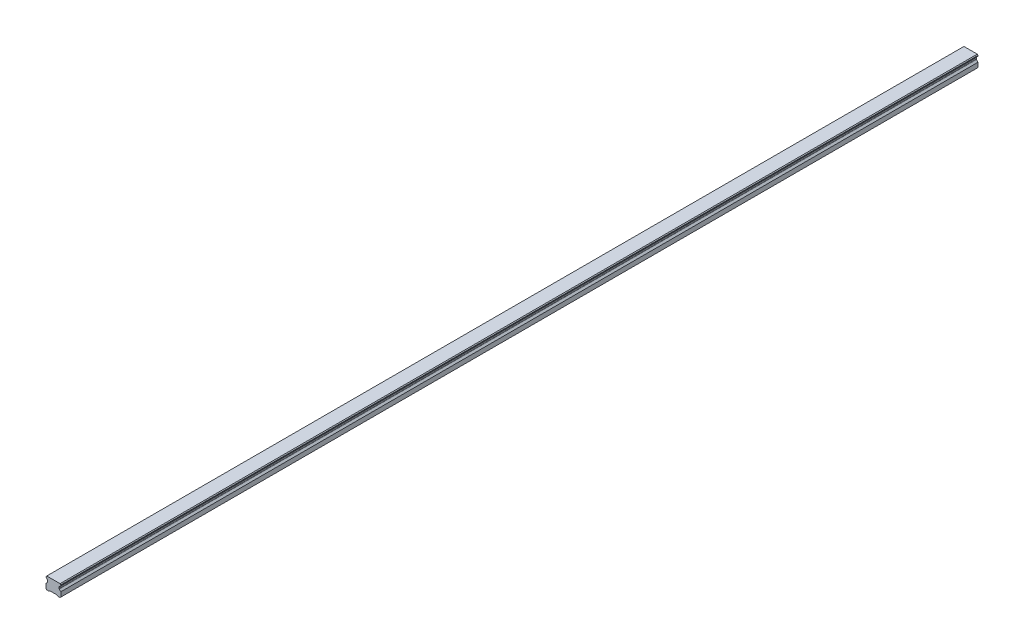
ISO-10303-21;
HEADER;
FILE_DESCRIPTION(('STEP AP214'),'2;1');
FILE_NAME('part.step','',(''),(''),'','','');
FILE_SCHEMA(('AUTOMOTIVE_DESIGN { 1 0 10303 214 1 1 1 1 }'));
ENDSEC;
DATA;
#1=APPLICATION_CONTEXT('core data for automotive mechanical design processes');
#2=APPLICATION_PROTOCOL_DEFINITION('international standard','automotive_design',2000,#1);
#3=PRODUCT_CONTEXT('',#1,'mechanical');
#4=PRODUCT('Part','Part','',(#3));
#5=PRODUCT_RELATED_PRODUCT_CATEGORY('part','',(#4));
#6=PRODUCT_DEFINITION_FORMATION('','',#4);
#7=PRODUCT_DEFINITION_CONTEXT('part definition',#1,'design');
#8=PRODUCT_DEFINITION('design','',#6,#7);
#9=PRODUCT_DEFINITION_SHAPE('','',#8);
#10=(LENGTH_UNIT() NAMED_UNIT(*) SI_UNIT(.MILLI.,.METRE.));
#11=(NAMED_UNIT(*) PLANE_ANGLE_UNIT() SI_UNIT($,.RADIAN.));
#12=(NAMED_UNIT(*) SI_UNIT($,.STERADIAN.) SOLID_ANGLE_UNIT());
#13=UNCERTAINTY_MEASURE_WITH_UNIT(LENGTH_MEASURE(1.E-05),#10,'distance_accuracy_value','');
#14=(GEOMETRIC_REPRESENTATION_CONTEXT(3) GLOBAL_UNCERTAINTY_ASSIGNED_CONTEXT((#13)) GLOBAL_UNIT_ASSIGNED_CONTEXT((#10,
#11,#12)) REPRESENTATION_CONTEXT('',''));
#15=CARTESIAN_POINT('',(0.,0.,0.));
#16=DIRECTION('',(0.,0.,1.));
#17=DIRECTION('',(1.,0.,0.));
#18=AXIS2_PLACEMENT_3D('',#15,#16,#17);
#19=CARTESIAN_POINT('',(0.,11.,-600.));
#20=DIRECTION('',(0.,-1.,0.));
#21=DIRECTION('',(0.,0.,-1.));
#22=AXIS2_PLACEMENT_3D('',#19,#20,#21);
#23=PLANE('',#22);
#24=CARTESIAN_POINT('',(0.,11.,-600.));
#25=DIRECTION('',(0.,-1.,0.));
#26=DIRECTION('',(0.,0.,-1.));
#27=AXIS2_PLACEMENT_3D('',#24,#25,#26);
#28=CIRCLE('',#27,2.5);
#29=CARTESIAN_POINT('',(0.,11.,-602.5));
#30=VERTEX_POINT('',#29);
#31=EDGE_CURVE('E42',#30,#30,#28,.T.);
#32=ORIENTED_EDGE('',*,*,#31,.F.);
#33=EDGE_LOOP('',(#32));
#34=FACE_BOUND('',#33,.T.);
#35=CARTESIAN_POINT('',(0.,11.,-600.));
#36=DIRECTION('',(0.,-1.,0.));
#37=DIRECTION('',(0.,0.,-1.));
#38=AXIS2_PLACEMENT_3D('',#35,#36,#37);
#39=CIRCLE('',#38,3.);
#40=CARTESIAN_POINT('',(0.,11.,-603.));
#41=VERTEX_POINT('',#40);
#42=EDGE_CURVE('E11',#41,#41,#39,.T.);
#43=ORIENTED_EDGE('',*,*,#42,.T.);
#44=EDGE_LOOP('',(#43));
#45=FACE_BOUND('',#44,.T.);
#46=ADVANCED_FACE('F39',(#34,#45),#23,.T.);
#47=CARTESIAN_POINT('',(0.,11.,-600.));
#48=DIRECTION('',(0.,-1.,0.));
#49=DIRECTION('',(0.,0.,-1.));
#50=AXIS2_PLACEMENT_3D('',#47,#48,#49);
#51=CYLINDRICAL_SURFACE('',#50,3.);
#52=ORIENTED_EDGE('',*,*,#42,.F.);
#53=EDGE_LOOP('',(#52));
#54=FACE_BOUND('',#53,.T.);
#55=CARTESIAN_POINT('',(0.,1.,-600.));
#56=DIRECTION('',(0.,-1.,0.));
#57=DIRECTION('',(0.,0.,-1.));
#58=AXIS2_PLACEMENT_3D('',#55,#56,#57);
#59=CIRCLE('',#58,3.);
#60=CARTESIAN_POINT('',(0.,1.,-603.));
#61=VERTEX_POINT('',#60);
#62=EDGE_CURVE('E48',#61,#61,#59,.T.);
#63=ORIENTED_EDGE('',*,*,#62,.T.);
#64=EDGE_LOOP('',(#63));
#65=FACE_BOUND('',#64,.T.);
#66=ADVANCED_FACE('F842',(#54,#65),#51,.F.);
#67=CARTESIAN_POINT('',(0.,11.,-540.));
#68=DIRECTION('',(0.,-1.,0.));
#69=DIRECTION('',(0.,0.,-1.));
#70=AXIS2_PLACEMENT_3D('',#67,#68,#69);
#71=PLANE('',#70);
#72=CARTESIAN_POINT('',(0.,11.,-540.));
#73=DIRECTION('',(0.,-1.,0.));
#74=DIRECTION('',(0.,0.,-1.));
#75=AXIS2_PLACEMENT_3D('',#72,#73,#74);
#76=CIRCLE('',#75,2.5);
#77=CARTESIAN_POINT('',(0.,11.,-542.5));
#78=VERTEX_POINT('',#77);
#79=EDGE_CURVE('E828',#78,#78,#76,.T.);
#80=ORIENTED_EDGE('',*,*,#79,.F.);
#81=EDGE_LOOP('',(#80));
#82=FACE_BOUND('',#81,.T.);
#83=CARTESIAN_POINT('',(0.,11.,-540.));
#84=DIRECTION('',(0.,-1.,0.));
#85=DIRECTION('',(0.,0.,-1.));
#86=AXIS2_PLACEMENT_3D('',#83,#84,#85);
#87=CIRCLE('',#86,3.);
#88=CARTESIAN_POINT('',(0.,11.,-543.));
#89=VERTEX_POINT('',#88);
#90=EDGE_CURVE('E755',#89,#89,#87,.T.);
#91=ORIENTED_EDGE('',*,*,#90,.T.);
#92=EDGE_LOOP('',(#91));
#93=FACE_BOUND('',#92,.T.);
#94=ADVANCED_FACE('F847',(#82,#93),#71,.T.);
#95=CARTESIAN_POINT('',(0.,11.,-540.));
#96=DIRECTION('',(0.,-1.,0.));
#97=DIRECTION('',(0.,0.,-1.));
#98=AXIS2_PLACEMENT_3D('',#95,#96,#97);
#99=CYLINDRICAL_SURFACE('',#98,3.);
#100=ORIENTED_EDGE('',*,*,#90,.F.);
#101=EDGE_LOOP('',(#100));
#102=FACE_BOUND('',#101,.T.);
#103=CARTESIAN_POINT('',(0.,1.,-540.));
#104=DIRECTION('',(0.,-1.,0.));
#105=DIRECTION('',(0.,0.,-1.));
#106=AXIS2_PLACEMENT_3D('',#103,#104,#105);
#107=CIRCLE('',#106,3.);
#108=CARTESIAN_POINT('',(0.,1.,-543.));
#109=VERTEX_POINT('',#108);
#110=EDGE_CURVE('E751',#109,#109,#107,.T.);
#111=ORIENTED_EDGE('',*,*,#110,.T.);
#112=EDGE_LOOP('',(#111));
#113=FACE_BOUND('',#112,.T.);
#114=ADVANCED_FACE('F1086',(#102,#113),#99,.F.);
#115=CARTESIAN_POINT('',(0.,11.,-480.));
#116=DIRECTION('',(0.,-1.,0.));
#117=DIRECTION('',(0.,0.,-1.));
#118=AXIS2_PLACEMENT_3D('',#115,#116,#117);
#119=PLANE('',#118);
#120=CARTESIAN_POINT('',(0.,11.,-480.));
#121=DIRECTION('',(0.,-1.,0.));
#122=DIRECTION('',(0.,0.,-1.));
#123=AXIS2_PLACEMENT_3D('',#120,#121,#122);
#124=CIRCLE('',#123,2.5);
#125=CARTESIAN_POINT('',(0.,11.,-482.5));
#126=VERTEX_POINT('',#125);
#127=EDGE_CURVE('E825',#126,#126,#124,.T.);
#128=ORIENTED_EDGE('',*,*,#127,.F.);
#129=EDGE_LOOP('',(#128));
#130=FACE_BOUND('',#129,.T.);
#131=CARTESIAN_POINT('',(0.,11.,-480.));
#132=DIRECTION('',(0.,-1.,0.));
#133=DIRECTION('',(0.,0.,-1.));
#134=AXIS2_PLACEMENT_3D('',#131,#132,#133);
#135=CIRCLE('',#134,3.);
#136=CARTESIAN_POINT('',(0.,11.,-483.));
#137=VERTEX_POINT('',#136);
#138=EDGE_CURVE('E747',#137,#137,#135,.T.);
#139=ORIENTED_EDGE('',*,*,#138,.T.);
#140=EDGE_LOOP('',(#139));
#141=FACE_BOUND('',#140,.T.);
#142=ADVANCED_FACE('F1082',(#130,#141),#119,.T.);
#143=CARTESIAN_POINT('',(0.,11.,-480.));
#144=DIRECTION('',(0.,-1.,0.));
#145=DIRECTION('',(0.,0.,-1.));
#146=AXIS2_PLACEMENT_3D('',#143,#144,#145);
#147=CYLINDRICAL_SURFACE('',#146,3.);
#148=ORIENTED_EDGE('',*,*,#138,.F.);
#149=EDGE_LOOP('',(#148));
#150=FACE_BOUND('',#149,.T.);
#151=CARTESIAN_POINT('',(0.,1.,-480.));
#152=DIRECTION('',(0.,-1.,0.));
#153=DIRECTION('',(0.,0.,-1.));
#154=AXIS2_PLACEMENT_3D('',#151,#152,#153);
#155=CIRCLE('',#154,3.);
#156=CARTESIAN_POINT('',(0.,1.,-483.));
#157=VERTEX_POINT('',#156);
#158=EDGE_CURVE('E743',#157,#157,#155,.T.);
#159=ORIENTED_EDGE('',*,*,#158,.T.);
#160=EDGE_LOOP('',(#159));
#161=FACE_BOUND('',#160,.T.);
#162=ADVANCED_FACE('F1078',(#150,#161),#147,.F.);
#163=CARTESIAN_POINT('',(0.,11.,-420.));
#164=DIRECTION('',(0.,-1.,0.));
#165=DIRECTION('',(0.,0.,-1.));
#166=AXIS2_PLACEMENT_3D('',#163,#164,#165);
#167=PLANE('',#166);
#168=CARTESIAN_POINT('',(0.,11.,-420.));
#169=DIRECTION('',(0.,-1.,0.));
#170=DIRECTION('',(0.,0.,-1.));
#171=AXIS2_PLACEMENT_3D('',#168,#169,#170);
#172=CIRCLE('',#171,2.5);
#173=CARTESIAN_POINT('',(0.,11.,-422.5));
#174=VERTEX_POINT('',#173);
#175=EDGE_CURVE('E821',#174,#174,#172,.T.);
#176=ORIENTED_EDGE('',*,*,#175,.F.);
#177=EDGE_LOOP('',(#176));
#178=FACE_BOUND('',#177,.T.);
#179=CARTESIAN_POINT('',(0.,11.,-420.));
#180=DIRECTION('',(0.,-1.,0.));
#181=DIRECTION('',(0.,0.,-1.));
#182=AXIS2_PLACEMENT_3D('',#179,#180,#181);
#183=CIRCLE('',#182,3.);
#184=CARTESIAN_POINT('',(0.,11.,-423.));
#185=VERTEX_POINT('',#184);
#186=EDGE_CURVE('E739',#185,#185,#183,.T.);
#187=ORIENTED_EDGE('',*,*,#186,.T.);
#188=EDGE_LOOP('',(#187));
#189=FACE_BOUND('',#188,.T.);
#190=ADVANCED_FACE('F1074',(#178,#189),#167,.T.);
#191=CARTESIAN_POINT('',(0.,11.,-420.));
#192=DIRECTION('',(0.,-1.,0.));
#193=DIRECTION('',(0.,0.,-1.));
#194=AXIS2_PLACEMENT_3D('',#191,#192,#193);
#195=CYLINDRICAL_SURFACE('',#194,3.);
#196=ORIENTED_EDGE('',*,*,#186,.F.);
#197=EDGE_LOOP('',(#196));
#198=FACE_BOUND('',#197,.T.);
#199=CARTESIAN_POINT('',(0.,1.,-420.));
#200=DIRECTION('',(0.,-1.,0.));
#201=DIRECTION('',(0.,0.,-1.));
#202=AXIS2_PLACEMENT_3D('',#199,#200,#201);
#203=CIRCLE('',#202,3.);
#204=CARTESIAN_POINT('',(0.,1.,-423.));
#205=VERTEX_POINT('',#204);
#206=EDGE_CURVE('E735',#205,#205,#203,.T.);
#207=ORIENTED_EDGE('',*,*,#206,.T.);
#208=EDGE_LOOP('',(#207));
#209=FACE_BOUND('',#208,.T.);
#210=ADVANCED_FACE('F1070',(#198,#209),#195,.F.);
#211=CARTESIAN_POINT('',(0.,11.,-360.));
#212=DIRECTION('',(0.,-1.,0.));
#213=DIRECTION('',(0.,0.,-1.));
#214=AXIS2_PLACEMENT_3D('',#211,#212,#213);
#215=PLANE('',#214);
#216=CARTESIAN_POINT('',(0.,11.,-360.));
#217=DIRECTION('',(0.,-1.,0.));
#218=DIRECTION('',(0.,0.,-1.));
#219=AXIS2_PLACEMENT_3D('',#216,#217,#218);
#220=CIRCLE('',#219,2.5);
#221=CARTESIAN_POINT('',(0.,11.,-362.5));
#222=VERTEX_POINT('',#221);
#223=EDGE_CURVE('E817',#222,#222,#220,.T.);
#224=ORIENTED_EDGE('',*,*,#223,.F.);
#225=EDGE_LOOP('',(#224));
#226=FACE_BOUND('',#225,.T.);
#227=CARTESIAN_POINT('',(0.,11.,-360.));
#228=DIRECTION('',(0.,-1.,0.));
#229=DIRECTION('',(0.,0.,-1.));
#230=AXIS2_PLACEMENT_3D('',#227,#228,#229);
#231=CIRCLE('',#230,3.);
#232=CARTESIAN_POINT('',(0.,11.,-363.));
#233=VERTEX_POINT('',#232);
#234=EDGE_CURVE('E731',#233,#233,#231,.T.);
#235=ORIENTED_EDGE('',*,*,#234,.T.);
#236=EDGE_LOOP('',(#235));
#237=FACE_BOUND('',#236,.T.);
#238=ADVANCED_FACE('F1066',(#226,#237),#215,.T.);
#239=CARTESIAN_POINT('',(0.,11.,-360.));
#240=DIRECTION('',(0.,-1.,0.));
#241=DIRECTION('',(0.,0.,-1.));
#242=AXIS2_PLACEMENT_3D('',#239,#240,#241);
#243=CYLINDRICAL_SURFACE('',#242,3.);
#244=ORIENTED_EDGE('',*,*,#234,.F.);
#245=EDGE_LOOP('',(#244));
#246=FACE_BOUND('',#245,.T.);
#247=CARTESIAN_POINT('',(0.,1.,-360.));
#248=DIRECTION('',(0.,-1.,0.));
#249=DIRECTION('',(0.,0.,-1.));
#250=AXIS2_PLACEMENT_3D('',#247,#248,#249);
#251=CIRCLE('',#250,3.);
#252=CARTESIAN_POINT('',(0.,1.,-363.));
#253=VERTEX_POINT('',#252);
#254=EDGE_CURVE('E727',#253,#253,#251,.T.);
#255=ORIENTED_EDGE('',*,*,#254,.T.);
#256=EDGE_LOOP('',(#255));
#257=FACE_BOUND('',#256,.T.);
#258=ADVANCED_FACE('F1062',(#246,#257),#243,.F.);
#259=CARTESIAN_POINT('',(0.,11.,-300.));
#260=DIRECTION('',(0.,-1.,0.));
#261=DIRECTION('',(0.,0.,-1.));
#262=AXIS2_PLACEMENT_3D('',#259,#260,#261);
#263=PLANE('',#262);
#264=CARTESIAN_POINT('',(0.,11.,-300.));
#265=DIRECTION('',(0.,-1.,0.));
#266=DIRECTION('',(0.,0.,-1.));
#267=AXIS2_PLACEMENT_3D('',#264,#265,#266);
#268=CIRCLE('',#267,2.5);
#269=CARTESIAN_POINT('',(0.,11.,-302.5));
#270=VERTEX_POINT('',#269);
#271=EDGE_CURVE('E813',#270,#270,#268,.T.);
#272=ORIENTED_EDGE('',*,*,#271,.F.);
#273=EDGE_LOOP('',(#272));
#274=FACE_BOUND('',#273,.T.);
#275=CARTESIAN_POINT('',(0.,11.,-300.));
#276=DIRECTION('',(0.,-1.,0.));
#277=DIRECTION('',(0.,0.,-1.));
#278=AXIS2_PLACEMENT_3D('',#275,#276,#277);
#279=CIRCLE('',#278,3.);
#280=CARTESIAN_POINT('',(0.,11.,-303.));
#281=VERTEX_POINT('',#280);
#282=EDGE_CURVE('E723',#281,#281,#279,.T.);
#283=ORIENTED_EDGE('',*,*,#282,.T.);
#284=EDGE_LOOP('',(#283));
#285=FACE_BOUND('',#284,.T.);
#286=ADVANCED_FACE('F1058',(#274,#285),#263,.T.);
#287=CARTESIAN_POINT('',(0.,11.,-300.));
#288=DIRECTION('',(0.,-1.,0.));
#289=DIRECTION('',(0.,0.,-1.));
#290=AXIS2_PLACEMENT_3D('',#287,#288,#289);
#291=CYLINDRICAL_SURFACE('',#290,3.);
#292=ORIENTED_EDGE('',*,*,#282,.F.);
#293=EDGE_LOOP('',(#292));
#294=FACE_BOUND('',#293,.T.);
#295=CARTESIAN_POINT('',(0.,1.,-300.));
#296=DIRECTION('',(0.,-1.,0.));
#297=DIRECTION('',(0.,0.,-1.));
#298=AXIS2_PLACEMENT_3D('',#295,#296,#297);
#299=CIRCLE('',#298,3.);
#300=CARTESIAN_POINT('',(0.,1.,-303.));
#301=VERTEX_POINT('',#300);
#302=EDGE_CURVE('E719',#301,#301,#299,.T.);
#303=ORIENTED_EDGE('',*,*,#302,.T.);
#304=EDGE_LOOP('',(#303));
#305=FACE_BOUND('',#304,.T.);
#306=ADVANCED_FACE('F1054',(#294,#305),#291,.F.);
#307=CARTESIAN_POINT('',(0.,11.,-240.));
#308=DIRECTION('',(0.,-1.,0.));
#309=DIRECTION('',(0.,0.,-1.));
#310=AXIS2_PLACEMENT_3D('',#307,#308,#309);
#311=PLANE('',#310);
#312=CARTESIAN_POINT('',(0.,11.,-240.));
#313=DIRECTION('',(0.,-1.,0.));
#314=DIRECTION('',(0.,0.,-1.));
#315=AXIS2_PLACEMENT_3D('',#312,#313,#314);
#316=CIRCLE('',#315,2.5);
#317=CARTESIAN_POINT('',(0.,11.,-242.5));
#318=VERTEX_POINT('',#317);
#319=EDGE_CURVE('E809',#318,#318,#316,.T.);
#320=ORIENTED_EDGE('',*,*,#319,.F.);
#321=EDGE_LOOP('',(#320));
#322=FACE_BOUND('',#321,.T.);
#323=CARTESIAN_POINT('',(0.,11.,-240.));
#324=DIRECTION('',(0.,-1.,0.));
#325=DIRECTION('',(0.,0.,-1.));
#326=AXIS2_PLACEMENT_3D('',#323,#324,#325);
#327=CIRCLE('',#326,3.);
#328=CARTESIAN_POINT('',(0.,11.,-243.));
#329=VERTEX_POINT('',#328);
#330=EDGE_CURVE('E715',#329,#329,#327,.T.);
#331=ORIENTED_EDGE('',*,*,#330,.T.);
#332=EDGE_LOOP('',(#331));
#333=FACE_BOUND('',#332,.T.);
#334=ADVANCED_FACE('F1050',(#322,#333),#311,.T.);
#335=CARTESIAN_POINT('',(0.,11.,-240.));
#336=DIRECTION('',(0.,-1.,0.));
#337=DIRECTION('',(0.,0.,-1.));
#338=AXIS2_PLACEMENT_3D('',#335,#336,#337);
#339=CYLINDRICAL_SURFACE('',#338,3.);
#340=ORIENTED_EDGE('',*,*,#330,.F.);
#341=EDGE_LOOP('',(#340));
#342=FACE_BOUND('',#341,.T.);
#343=CARTESIAN_POINT('',(0.,1.,-240.));
#344=DIRECTION('',(0.,-1.,0.));
#345=DIRECTION('',(0.,0.,-1.));
#346=AXIS2_PLACEMENT_3D('',#343,#344,#345);
#347=CIRCLE('',#346,3.);
#348=CARTESIAN_POINT('',(0.,1.,-243.));
#349=VERTEX_POINT('',#348);
#350=EDGE_CURVE('E711',#349,#349,#347,.T.);
#351=ORIENTED_EDGE('',*,*,#350,.T.);
#352=EDGE_LOOP('',(#351));
#353=FACE_BOUND('',#352,.T.);
#354=ADVANCED_FACE('F1046',(#342,#353),#339,.F.);
#355=CARTESIAN_POINT('',(0.,11.,-180.));
#356=DIRECTION('',(0.,-1.,0.));
#357=DIRECTION('',(0.,0.,-1.));
#358=AXIS2_PLACEMENT_3D('',#355,#356,#357);
#359=PLANE('',#358);
#360=CARTESIAN_POINT('',(0.,11.,-180.));
#361=DIRECTION('',(0.,-1.,0.));
#362=DIRECTION('',(0.,0.,-1.));
#363=AXIS2_PLACEMENT_3D('',#360,#361,#362);
#364=CIRCLE('',#363,2.5);
#365=CARTESIAN_POINT('',(0.,11.,-182.5));
#366=VERTEX_POINT('',#365);
#367=EDGE_CURVE('E805',#366,#366,#364,.T.);
#368=ORIENTED_EDGE('',*,*,#367,.F.);
#369=EDGE_LOOP('',(#368));
#370=FACE_BOUND('',#369,.T.);
#371=CARTESIAN_POINT('',(0.,11.,-180.));
#372=DIRECTION('',(0.,-1.,0.));
#373=DIRECTION('',(0.,0.,-1.));
#374=AXIS2_PLACEMENT_3D('',#371,#372,#373);
#375=CIRCLE('',#374,3.);
#376=CARTESIAN_POINT('',(0.,11.,-183.));
#377=VERTEX_POINT('',#376);
#378=EDGE_CURVE('E707',#377,#377,#375,.T.);
#379=ORIENTED_EDGE('',*,*,#378,.T.);
#380=EDGE_LOOP('',(#379));
#381=FACE_BOUND('',#380,.T.);
#382=ADVANCED_FACE('F1042',(#370,#381),#359,.T.);
#383=CARTESIAN_POINT('',(0.,11.,-180.));
#384=DIRECTION('',(0.,-1.,0.));
#385=DIRECTION('',(0.,0.,-1.));
#386=AXIS2_PLACEMENT_3D('',#383,#384,#385);
#387=CYLINDRICAL_SURFACE('',#386,3.);
#388=ORIENTED_EDGE('',*,*,#378,.F.);
#389=EDGE_LOOP('',(#388));
#390=FACE_BOUND('',#389,.T.);
#391=CARTESIAN_POINT('',(0.,1.,-180.));
#392=DIRECTION('',(0.,-1.,0.));
#393=DIRECTION('',(0.,0.,-1.));
#394=AXIS2_PLACEMENT_3D('',#391,#392,#393);
#395=CIRCLE('',#394,3.);
#396=CARTESIAN_POINT('',(0.,1.,-183.));
#397=VERTEX_POINT('',#396);
#398=EDGE_CURVE('E703',#397,#397,#395,.T.);
#399=ORIENTED_EDGE('',*,*,#398,.T.);
#400=EDGE_LOOP('',(#399));
#401=FACE_BOUND('',#400,.T.);
#402=ADVANCED_FACE('F1038',(#390,#401),#387,.F.);
#403=CARTESIAN_POINT('',(0.,11.,-120.));
#404=DIRECTION('',(0.,-1.,0.));
#405=DIRECTION('',(0.,0.,-1.));
#406=AXIS2_PLACEMENT_3D('',#403,#404,#405);
#407=PLANE('',#406);
#408=CARTESIAN_POINT('',(0.,11.,-120.));
#409=DIRECTION('',(0.,-1.,0.));
#410=DIRECTION('',(0.,0.,-1.));
#411=AXIS2_PLACEMENT_3D('',#408,#409,#410);
#412=CIRCLE('',#411,2.5);
#413=CARTESIAN_POINT('',(0.,11.,-122.5));
#414=VERTEX_POINT('',#413);
#415=EDGE_CURVE('E801',#414,#414,#412,.T.);
#416=ORIENTED_EDGE('',*,*,#415,.F.);
#417=EDGE_LOOP('',(#416));
#418=FACE_BOUND('',#417,.T.);
#419=CARTESIAN_POINT('',(0.,11.,-120.));
#420=DIRECTION('',(0.,-1.,0.));
#421=DIRECTION('',(0.,0.,-1.));
#422=AXIS2_PLACEMENT_3D('',#419,#420,#421);
#423=CIRCLE('',#422,3.);
#424=CARTESIAN_POINT('',(0.,11.,-123.));
#425=VERTEX_POINT('',#424);
#426=EDGE_CURVE('E699',#425,#425,#423,.T.);
#427=ORIENTED_EDGE('',*,*,#426,.T.);
#428=EDGE_LOOP('',(#427));
#429=FACE_BOUND('',#428,.T.);
#430=ADVANCED_FACE('F1034',(#418,#429),#407,.T.);
#431=CARTESIAN_POINT('',(0.,11.,-120.));
#432=DIRECTION('',(0.,-1.,0.));
#433=DIRECTION('',(0.,0.,-1.));
#434=AXIS2_PLACEMENT_3D('',#431,#432,#433);
#435=CYLINDRICAL_SURFACE('',#434,3.);
#436=ORIENTED_EDGE('',*,*,#426,.F.);
#437=EDGE_LOOP('',(#436));
#438=FACE_BOUND('',#437,.T.);
#439=CARTESIAN_POINT('',(0.,1.,-120.));
#440=DIRECTION('',(0.,-1.,0.));
#441=DIRECTION('',(0.,0.,-1.));
#442=AXIS2_PLACEMENT_3D('',#439,#440,#441);
#443=CIRCLE('',#442,3.);
#444=CARTESIAN_POINT('',(0.,1.,-123.));
#445=VERTEX_POINT('',#444);
#446=EDGE_CURVE('E695',#445,#445,#443,.T.);
#447=ORIENTED_EDGE('',*,*,#446,.T.);
#448=EDGE_LOOP('',(#447));
#449=FACE_BOUND('',#448,.T.);
#450=ADVANCED_FACE('F1030',(#438,#449),#435,.F.);
#451=CARTESIAN_POINT('',(0.,11.,-59.9999999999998));
#452=DIRECTION('',(0.,-1.,0.));
#453=DIRECTION('',(0.,0.,-1.));
#454=AXIS2_PLACEMENT_3D('',#451,#452,#453);
#455=PLANE('',#454);
#456=CARTESIAN_POINT('',(0.,11.,-59.9999999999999));
#457=DIRECTION('',(0.,-1.,0.));
#458=DIRECTION('',(0.,0.,-1.));
#459=AXIS2_PLACEMENT_3D('',#456,#457,#458);
#460=CIRCLE('',#459,2.5);
#461=CARTESIAN_POINT('',(0.,11.,-62.4999999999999));
#462=VERTEX_POINT('',#461);
#463=EDGE_CURVE('E797',#462,#462,#460,.T.);
#464=ORIENTED_EDGE('',*,*,#463,.F.);
#465=EDGE_LOOP('',(#464));
#466=FACE_BOUND('',#465,.T.);
#467=CARTESIAN_POINT('',(0.,11.,-59.9999999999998));
#468=DIRECTION('',(0.,-1.,0.));
#469=DIRECTION('',(0.,0.,-1.));
#470=AXIS2_PLACEMENT_3D('',#467,#468,#469);
#471=CIRCLE('',#470,3.);
#472=CARTESIAN_POINT('',(0.,11.,-62.9999999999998));
#473=VERTEX_POINT('',#472);
#474=EDGE_CURVE('E691',#473,#473,#471,.T.);
#475=ORIENTED_EDGE('',*,*,#474,.T.);
#476=EDGE_LOOP('',(#475));
#477=FACE_BOUND('',#476,.T.);
#478=ADVANCED_FACE('F1026',(#466,#477),#455,.T.);
#479=CARTESIAN_POINT('',(0.,11.,-59.9999999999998));
#480=DIRECTION('',(0.,-1.,0.));
#481=DIRECTION('',(0.,0.,-1.));
#482=AXIS2_PLACEMENT_3D('',#479,#480,#481);
#483=CYLINDRICAL_SURFACE('',#482,3.);
#484=ORIENTED_EDGE('',*,*,#474,.F.);
#485=EDGE_LOOP('',(#484));
#486=FACE_BOUND('',#485,.T.);
#487=CARTESIAN_POINT('',(0.,1.,-59.9999999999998));
#488=DIRECTION('',(0.,-1.,0.));
#489=DIRECTION('',(0.,0.,-1.));
#490=AXIS2_PLACEMENT_3D('',#487,#488,#489);
#491=CIRCLE('',#490,3.);
#492=CARTESIAN_POINT('',(0.,1.,-62.9999999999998));
#493=VERTEX_POINT('',#492);
#494=EDGE_CURVE('E687',#493,#493,#491,.T.);
#495=ORIENTED_EDGE('',*,*,#494,.T.);
#496=EDGE_LOOP('',(#495));
#497=FACE_BOUND('',#496,.T.);
#498=ADVANCED_FACE('F1022',(#486,#497),#483,.F.);
#499=CARTESIAN_POINT('',(0.,11.,0.));
#500=DIRECTION('',(0.,-1.,0.));
#501=DIRECTION('',(0.,0.,-1.));
#502=AXIS2_PLACEMENT_3D('',#499,#500,#501);
#503=PLANE('',#502);
#504=CARTESIAN_POINT('',(0.,11.,0.));
#505=DIRECTION('',(0.,-1.,0.));
#506=DIRECTION('',(0.,0.,-1.));
#507=AXIS2_PLACEMENT_3D('',#504,#505,#506);
#508=CIRCLE('',#507,2.5);
#509=CARTESIAN_POINT('',(0.,11.,-2.5));
#510=VERTEX_POINT('',#509);
#511=EDGE_CURVE('E793',#510,#510,#508,.T.);
#512=ORIENTED_EDGE('',*,*,#511,.F.);
#513=EDGE_LOOP('',(#512));
#514=FACE_BOUND('',#513,.T.);
#515=CARTESIAN_POINT('',(0.,11.,0.));
#516=DIRECTION('',(0.,-1.,0.));
#517=DIRECTION('',(0.,0.,-1.));
#518=AXIS2_PLACEMENT_3D('',#515,#516,#517);
#519=CIRCLE('',#518,3.);
#520=CARTESIAN_POINT('',(0.,11.,-3.));
#521=VERTEX_POINT('',#520);
#522=EDGE_CURVE('E683',#521,#521,#519,.T.);
#523=ORIENTED_EDGE('',*,*,#522,.T.);
#524=EDGE_LOOP('',(#523));
#525=FACE_BOUND('',#524,.T.);
#526=ADVANCED_FACE('F1018',(#514,#525),#503,.T.);
#527=CARTESIAN_POINT('',(0.,11.,0.));
#528=DIRECTION('',(0.,-1.,0.));
#529=DIRECTION('',(0.,0.,-1.));
#530=AXIS2_PLACEMENT_3D('',#527,#528,#529);
#531=CYLINDRICAL_SURFACE('',#530,3.);
#532=ORIENTED_EDGE('',*,*,#522,.F.);
#533=EDGE_LOOP('',(#532));
#534=FACE_BOUND('',#533,.T.);
#535=CARTESIAN_POINT('',(0.,1.,0.));
#536=DIRECTION('',(0.,-1.,0.));
#537=DIRECTION('',(0.,0.,-1.));
#538=AXIS2_PLACEMENT_3D('',#535,#536,#537);
#539=CIRCLE('',#538,3.);
#540=CARTESIAN_POINT('',(0.,1.,-3.));
#541=VERTEX_POINT('',#540);
#542=EDGE_CURVE('E679',#541,#541,#539,.T.);
#543=ORIENTED_EDGE('',*,*,#542,.T.);
#544=EDGE_LOOP('',(#543));
#545=FACE_BOUND('',#544,.T.);
#546=ADVANCED_FACE('F1014',(#534,#545),#531,.F.);
#547=CARTESIAN_POINT('',(0.,11.,60.));
#548=DIRECTION('',(0.,-1.,0.));
#549=DIRECTION('',(0.,0.,-1.));
#550=AXIS2_PLACEMENT_3D('',#547,#548,#549);
#551=PLANE('',#550);
#552=CARTESIAN_POINT('',(0.,11.,59.9999999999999));
#553=DIRECTION('',(0.,-1.,0.));
#554=DIRECTION('',(0.,0.,-1.));
#555=AXIS2_PLACEMENT_3D('',#552,#553,#554);
#556=CIRCLE('',#555,2.5);
#557=CARTESIAN_POINT('',(0.,11.,57.4999999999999));
#558=VERTEX_POINT('',#557);
#559=EDGE_CURVE('E789',#558,#558,#556,.T.);
#560=ORIENTED_EDGE('',*,*,#559,.F.);
#561=EDGE_LOOP('',(#560));
#562=FACE_BOUND('',#561,.T.);
#563=CARTESIAN_POINT('',(0.,11.,60.));
#564=DIRECTION('',(0.,-1.,0.));
#565=DIRECTION('',(0.,0.,-1.));
#566=AXIS2_PLACEMENT_3D('',#563,#564,#565);
#567=CIRCLE('',#566,3.);
#568=CARTESIAN_POINT('',(0.,11.,57.));
#569=VERTEX_POINT('',#568);
#570=EDGE_CURVE('E675',#569,#569,#567,.T.);
#571=ORIENTED_EDGE('',*,*,#570,.T.);
#572=EDGE_LOOP('',(#571));
#573=FACE_BOUND('',#572,.T.);
#574=ADVANCED_FACE('F1010',(#562,#573),#551,.T.);
#575=CARTESIAN_POINT('',(0.,11.,60.));
#576=DIRECTION('',(0.,-1.,0.));
#577=DIRECTION('',(0.,0.,-1.));
#578=AXIS2_PLACEMENT_3D('',#575,#576,#577);
#579=CYLINDRICAL_SURFACE('',#578,3.);
#580=ORIENTED_EDGE('',*,*,#570,.F.);
#581=EDGE_LOOP('',(#580));
#582=FACE_BOUND('',#581,.T.);
#583=CARTESIAN_POINT('',(0.,1.,60.));
#584=DIRECTION('',(0.,-1.,0.));
#585=DIRECTION('',(0.,0.,-1.));
#586=AXIS2_PLACEMENT_3D('',#583,#584,#585);
#587=CIRCLE('',#586,3.);
#588=CARTESIAN_POINT('',(0.,1.,57.));
#589=VERTEX_POINT('',#588);
#590=EDGE_CURVE('E671',#589,#589,#587,.T.);
#591=ORIENTED_EDGE('',*,*,#590,.T.);
#592=EDGE_LOOP('',(#591));
#593=FACE_BOUND('',#592,.T.);
#594=ADVANCED_FACE('F1006',(#582,#593),#579,.F.);
#595=CARTESIAN_POINT('',(0.,11.,120.));
#596=DIRECTION('',(0.,-1.,0.));
#597=DIRECTION('',(0.,0.,-1.));
#598=AXIS2_PLACEMENT_3D('',#595,#596,#597);
#599=PLANE('',#598);
#600=CARTESIAN_POINT('',(0.,11.,120.));
#601=DIRECTION('',(0.,-1.,0.));
#602=DIRECTION('',(0.,0.,-1.));
#603=AXIS2_PLACEMENT_3D('',#600,#601,#602);
#604=CIRCLE('',#603,2.5);
#605=CARTESIAN_POINT('',(0.,11.,117.5));
#606=VERTEX_POINT('',#605);
#607=EDGE_CURVE('E785',#606,#606,#604,.T.);
#608=ORIENTED_EDGE('',*,*,#607,.F.);
#609=EDGE_LOOP('',(#608));
#610=FACE_BOUND('',#609,.T.);
#611=CARTESIAN_POINT('',(0.,11.,120.));
#612=DIRECTION('',(0.,-1.,0.));
#613=DIRECTION('',(0.,0.,-1.));
#614=AXIS2_PLACEMENT_3D('',#611,#612,#613);
#615=CIRCLE('',#614,3.);
#616=CARTESIAN_POINT('',(0.,11.,117.));
#617=VERTEX_POINT('',#616);
#618=EDGE_CURVE('E667',#617,#617,#615,.T.);
#619=ORIENTED_EDGE('',*,*,#618,.T.);
#620=EDGE_LOOP('',(#619));
#621=FACE_BOUND('',#620,.T.);
#622=ADVANCED_FACE('F1002',(#610,#621),#599,.T.);
#623=CARTESIAN_POINT('',(0.,11.,120.));
#624=DIRECTION('',(0.,-1.,0.));
#625=DIRECTION('',(0.,0.,-1.));
#626=AXIS2_PLACEMENT_3D('',#623,#624,#625);
#627=CYLINDRICAL_SURFACE('',#626,3.);
#628=ORIENTED_EDGE('',*,*,#618,.F.);
#629=EDGE_LOOP('',(#628));
#630=FACE_BOUND('',#629,.T.);
#631=CARTESIAN_POINT('',(0.,1.,120.));
#632=DIRECTION('',(0.,-1.,0.));
#633=DIRECTION('',(0.,0.,-1.));
#634=AXIS2_PLACEMENT_3D('',#631,#632,#633);
#635=CIRCLE('',#634,3.);
#636=CARTESIAN_POINT('',(0.,1.,117.));
#637=VERTEX_POINT('',#636);
#638=EDGE_CURVE('E663',#637,#637,#635,.T.);
#639=ORIENTED_EDGE('',*,*,#638,.T.);
#640=EDGE_LOOP('',(#639));
#641=FACE_BOUND('',#640,.T.);
#642=ADVANCED_FACE('F998',(#630,#641),#627,.F.);
#643=CARTESIAN_POINT('',(0.,11.,180.));
#644=DIRECTION('',(0.,-1.,0.));
#645=DIRECTION('',(0.,0.,-1.));
#646=AXIS2_PLACEMENT_3D('',#643,#644,#645);
#647=PLANE('',#646);
#648=CARTESIAN_POINT('',(0.,11.,180.));
#649=DIRECTION('',(0.,-1.,0.));
#650=DIRECTION('',(0.,0.,-1.));
#651=AXIS2_PLACEMENT_3D('',#648,#649,#650);
#652=CIRCLE('',#651,2.5);
#653=CARTESIAN_POINT('',(0.,11.,177.5));
#654=VERTEX_POINT('',#653);
#655=EDGE_CURVE('E781',#654,#654,#652,.T.);
#656=ORIENTED_EDGE('',*,*,#655,.F.);
#657=EDGE_LOOP('',(#656));
#658=FACE_BOUND('',#657,.T.);
#659=CARTESIAN_POINT('',(0.,11.,180.));
#660=DIRECTION('',(0.,-1.,0.));
#661=DIRECTION('',(0.,0.,-1.));
#662=AXIS2_PLACEMENT_3D('',#659,#660,#661);
#663=CIRCLE('',#662,3.);
#664=CARTESIAN_POINT('',(0.,11.,177.));
#665=VERTEX_POINT('',#664);
#666=EDGE_CURVE('E659',#665,#665,#663,.T.);
#667=ORIENTED_EDGE('',*,*,#666,.T.);
#668=EDGE_LOOP('',(#667));
#669=FACE_BOUND('',#668,.T.);
#670=ADVANCED_FACE('F994',(#658,#669),#647,.T.);
#671=CARTESIAN_POINT('',(0.,11.,180.));
#672=DIRECTION('',(0.,-1.,0.));
#673=DIRECTION('',(0.,0.,-1.));
#674=AXIS2_PLACEMENT_3D('',#671,#672,#673);
#675=CYLINDRICAL_SURFACE('',#674,3.);
#676=ORIENTED_EDGE('',*,*,#666,.F.);
#677=EDGE_LOOP('',(#676));
#678=FACE_BOUND('',#677,.T.);
#679=CARTESIAN_POINT('',(0.,1.,180.));
#680=DIRECTION('',(0.,-1.,0.));
#681=DIRECTION('',(0.,0.,-1.));
#682=AXIS2_PLACEMENT_3D('',#679,#680,#681);
#683=CIRCLE('',#682,3.);
#684=CARTESIAN_POINT('',(0.,1.,177.));
#685=VERTEX_POINT('',#684);
#686=EDGE_CURVE('E655',#685,#685,#683,.T.);
#687=ORIENTED_EDGE('',*,*,#686,.T.);
#688=EDGE_LOOP('',(#687));
#689=FACE_BOUND('',#688,.T.);
#690=ADVANCED_FACE('F990',(#678,#689),#675,.F.);
#691=CARTESIAN_POINT('',(0.,11.,240.));
#692=DIRECTION('',(0.,-1.,0.));
#693=DIRECTION('',(0.,0.,-1.));
#694=AXIS2_PLACEMENT_3D('',#691,#692,#693);
#695=PLANE('',#694);
#696=CARTESIAN_POINT('',(0.,11.,240.));
#697=DIRECTION('',(0.,-1.,0.));
#698=DIRECTION('',(0.,0.,-1.));
#699=AXIS2_PLACEMENT_3D('',#696,#697,#698);
#700=CIRCLE('',#699,2.5);
#701=CARTESIAN_POINT('',(0.,11.,237.5));
#702=VERTEX_POINT('',#701);
#703=EDGE_CURVE('E777',#702,#702,#700,.T.);
#704=ORIENTED_EDGE('',*,*,#703,.F.);
#705=EDGE_LOOP('',(#704));
#706=FACE_BOUND('',#705,.T.);
#707=CARTESIAN_POINT('',(0.,11.,240.));
#708=DIRECTION('',(0.,-1.,0.));
#709=DIRECTION('',(0.,0.,-1.));
#710=AXIS2_PLACEMENT_3D('',#707,#708,#709);
#711=CIRCLE('',#710,3.);
#712=CARTESIAN_POINT('',(0.,11.,237.));
#713=VERTEX_POINT('',#712);
#714=EDGE_CURVE('E651',#713,#713,#711,.T.);
#715=ORIENTED_EDGE('',*,*,#714,.T.);
#716=EDGE_LOOP('',(#715));
#717=FACE_BOUND('',#716,.T.);
#718=ADVANCED_FACE('F986',(#706,#717),#695,.T.);
#719=CARTESIAN_POINT('',(0.,11.,240.));
#720=DIRECTION('',(0.,-1.,0.));
#721=DIRECTION('',(0.,0.,-1.));
#722=AXIS2_PLACEMENT_3D('',#719,#720,#721);
#723=CYLINDRICAL_SURFACE('',#722,3.);
#724=ORIENTED_EDGE('',*,*,#714,.F.);
#725=EDGE_LOOP('',(#724));
#726=FACE_BOUND('',#725,.T.);
#727=CARTESIAN_POINT('',(0.,1.,240.));
#728=DIRECTION('',(0.,-1.,0.));
#729=DIRECTION('',(0.,0.,-1.));
#730=AXIS2_PLACEMENT_3D('',#727,#728,#729);
#731=CIRCLE('',#730,3.);
#732=CARTESIAN_POINT('',(0.,1.,237.));
#733=VERTEX_POINT('',#732);
#734=EDGE_CURVE('E647',#733,#733,#731,.T.);
#735=ORIENTED_EDGE('',*,*,#734,.T.);
#736=EDGE_LOOP('',(#735));
#737=FACE_BOUND('',#736,.T.);
#738=ADVANCED_FACE('F982',(#726,#737),#723,.F.);
#739=CARTESIAN_POINT('',(0.,11.,300.));
#740=DIRECTION('',(0.,-1.,0.));
#741=DIRECTION('',(0.,0.,-1.));
#742=AXIS2_PLACEMENT_3D('',#739,#740,#741);
#743=PLANE('',#742);
#744=CARTESIAN_POINT('',(0.,11.,300.));
#745=DIRECTION('',(0.,-1.,0.));
#746=DIRECTION('',(0.,0.,-1.));
#747=AXIS2_PLACEMENT_3D('',#744,#745,#746);
#748=CIRCLE('',#747,2.5);
#749=CARTESIAN_POINT('',(0.,11.,297.5));
#750=VERTEX_POINT('',#749);
#751=EDGE_CURVE('E773',#750,#750,#748,.T.);
#752=ORIENTED_EDGE('',*,*,#751,.F.);
#753=EDGE_LOOP('',(#752));
#754=FACE_BOUND('',#753,.T.);
#755=CARTESIAN_POINT('',(0.,11.,300.));
#756=DIRECTION('',(0.,-1.,0.));
#757=DIRECTION('',(0.,0.,-1.));
#758=AXIS2_PLACEMENT_3D('',#755,#756,#757);
#759=CIRCLE('',#758,3.);
#760=CARTESIAN_POINT('',(0.,11.,297.));
#761=VERTEX_POINT('',#760);
#762=EDGE_CURVE('E643',#761,#761,#759,.T.);
#763=ORIENTED_EDGE('',*,*,#762,.T.);
#764=EDGE_LOOP('',(#763));
#765=FACE_BOUND('',#764,.T.);
#766=ADVANCED_FACE('F978',(#754,#765),#743,.T.);
#767=CARTESIAN_POINT('',(0.,11.,300.));
#768=DIRECTION('',(0.,-1.,0.));
#769=DIRECTION('',(0.,0.,-1.));
#770=AXIS2_PLACEMENT_3D('',#767,#768,#769);
#771=CYLINDRICAL_SURFACE('',#770,3.);
#772=ORIENTED_EDGE('',*,*,#762,.F.);
#773=EDGE_LOOP('',(#772));
#774=FACE_BOUND('',#773,.T.);
#775=CARTESIAN_POINT('',(0.,1.,300.));
#776=DIRECTION('',(0.,-1.,0.));
#777=DIRECTION('',(0.,0.,-1.));
#778=AXIS2_PLACEMENT_3D('',#775,#776,#777);
#779=CIRCLE('',#778,3.);
#780=CARTESIAN_POINT('',(0.,1.,297.));
#781=VERTEX_POINT('',#780);
#782=EDGE_CURVE('E639',#781,#781,#779,.T.);
#783=ORIENTED_EDGE('',*,*,#782,.T.);
#784=EDGE_LOOP('',(#783));
#785=FACE_BOUND('',#784,.T.);
#786=ADVANCED_FACE('F974',(#774,#785),#771,.F.);
#787=CARTESIAN_POINT('',(0.,11.,360.));
#788=DIRECTION('',(0.,-1.,0.));
#789=DIRECTION('',(0.,0.,-1.));
#790=AXIS2_PLACEMENT_3D('',#787,#788,#789);
#791=PLANE('',#790);
#792=CARTESIAN_POINT('',(0.,11.,360.));
#793=DIRECTION('',(0.,-1.,0.));
#794=DIRECTION('',(0.,0.,-1.));
#795=AXIS2_PLACEMENT_3D('',#792,#793,#794);
#796=CIRCLE('',#795,2.5);
#797=CARTESIAN_POINT('',(0.,11.,357.5));
#798=VERTEX_POINT('',#797);
#799=EDGE_CURVE('E769',#798,#798,#796,.T.);
#800=ORIENTED_EDGE('',*,*,#799,.F.);
#801=EDGE_LOOP('',(#800));
#802=FACE_BOUND('',#801,.T.);
#803=CARTESIAN_POINT('',(0.,11.,360.));
#804=DIRECTION('',(0.,-1.,0.));
#805=DIRECTION('',(0.,0.,-1.));
#806=AXIS2_PLACEMENT_3D('',#803,#804,#805);
#807=CIRCLE('',#806,3.);
#808=CARTESIAN_POINT('',(0.,11.,357.));
#809=VERTEX_POINT('',#808);
#810=EDGE_CURVE('E635',#809,#809,#807,.T.);
#811=ORIENTED_EDGE('',*,*,#810,.T.);
#812=EDGE_LOOP('',(#811));
#813=FACE_BOUND('',#812,.T.);
#814=ADVANCED_FACE('F970',(#802,#813),#791,.T.);
#815=CARTESIAN_POINT('',(0.,11.,360.));
#816=DIRECTION('',(0.,-1.,0.));
#817=DIRECTION('',(0.,0.,-1.));
#818=AXIS2_PLACEMENT_3D('',#815,#816,#817);
#819=CYLINDRICAL_SURFACE('',#818,3.);
#820=ORIENTED_EDGE('',*,*,#810,.F.);
#821=EDGE_LOOP('',(#820));
#822=FACE_BOUND('',#821,.T.);
#823=CARTESIAN_POINT('',(0.,1.,360.));
#824=DIRECTION('',(0.,-1.,0.));
#825=DIRECTION('',(0.,0.,-1.));
#826=AXIS2_PLACEMENT_3D('',#823,#824,#825);
#827=CIRCLE('',#826,3.);
#828=CARTESIAN_POINT('',(0.,1.,357.));
#829=VERTEX_POINT('',#828);
#830=EDGE_CURVE('E631',#829,#829,#827,.T.);
#831=ORIENTED_EDGE('',*,*,#830,.T.);
#832=EDGE_LOOP('',(#831));
#833=FACE_BOUND('',#832,.T.);
#834=ADVANCED_FACE('F966',(#822,#833),#819,.F.);
#835=CARTESIAN_POINT('',(0.,11.,420.));
#836=DIRECTION('',(0.,-1.,0.));
#837=DIRECTION('',(0.,0.,-1.));
#838=AXIS2_PLACEMENT_3D('',#835,#836,#837);
#839=PLANE('',#838);
#840=CARTESIAN_POINT('',(0.,11.,420.));
#841=DIRECTION('',(0.,-1.,0.));
#842=DIRECTION('',(0.,0.,-1.));
#843=AXIS2_PLACEMENT_3D('',#840,#841,#842);
#844=CIRCLE('',#843,2.5);
#845=CARTESIAN_POINT('',(0.,11.,417.5));
#846=VERTEX_POINT('',#845);
#847=EDGE_CURVE('E765',#846,#846,#844,.T.);
#848=ORIENTED_EDGE('',*,*,#847,.F.);
#849=EDGE_LOOP('',(#848));
#850=FACE_BOUND('',#849,.T.);
#851=CARTESIAN_POINT('',(0.,11.,420.));
#852=DIRECTION('',(0.,-1.,0.));
#853=DIRECTION('',(0.,0.,-1.));
#854=AXIS2_PLACEMENT_3D('',#851,#852,#853);
#855=CIRCLE('',#854,3.);
#856=CARTESIAN_POINT('',(0.,11.,417.));
#857=VERTEX_POINT('',#856);
#858=EDGE_CURVE('E627',#857,#857,#855,.T.);
#859=ORIENTED_EDGE('',*,*,#858,.T.);
#860=EDGE_LOOP('',(#859));
#861=FACE_BOUND('',#860,.T.);
#862=ADVANCED_FACE('F962',(#850,#861),#839,.T.);
#863=CARTESIAN_POINT('',(0.,11.,420.));
#864=DIRECTION('',(0.,-1.,0.));
#865=DIRECTION('',(0.,0.,-1.));
#866=AXIS2_PLACEMENT_3D('',#863,#864,#865);
#867=CYLINDRICAL_SURFACE('',#866,3.);
#868=ORIENTED_EDGE('',*,*,#858,.F.);
#869=EDGE_LOOP('',(#868));
#870=FACE_BOUND('',#869,.T.);
#871=CARTESIAN_POINT('',(0.,1.,420.));
#872=DIRECTION('',(0.,-1.,0.));
#873=DIRECTION('',(0.,0.,-1.));
#874=AXIS2_PLACEMENT_3D('',#871,#872,#873);
#875=CIRCLE('',#874,3.);
#876=CARTESIAN_POINT('',(0.,1.,417.));
#877=VERTEX_POINT('',#876);
#878=EDGE_CURVE('E623',#877,#877,#875,.T.);
#879=ORIENTED_EDGE('',*,*,#878,.T.);
#880=EDGE_LOOP('',(#879));
#881=FACE_BOUND('',#880,.T.);
#882=ADVANCED_FACE('F958',(#870,#881),#867,.F.);
#883=CARTESIAN_POINT('',(0.,11.,480.));
#884=DIRECTION('',(0.,-1.,0.));
#885=DIRECTION('',(0.,0.,-1.));
#886=AXIS2_PLACEMENT_3D('',#883,#884,#885);
#887=PLANE('',#886);
#888=CARTESIAN_POINT('',(0.,11.,480.));
#889=DIRECTION('',(0.,-1.,0.));
#890=DIRECTION('',(0.,0.,-1.));
#891=AXIS2_PLACEMENT_3D('',#888,#889,#890);
#892=CIRCLE('',#891,2.5);
#893=CARTESIAN_POINT('',(0.,11.,477.5));
#894=VERTEX_POINT('',#893);
#895=EDGE_CURVE('E281',#894,#894,#892,.T.);
#896=ORIENTED_EDGE('',*,*,#895,.F.);
#897=EDGE_LOOP('',(#896));
#898=FACE_BOUND('',#897,.T.);
#899=CARTESIAN_POINT('',(0.,11.,480.));
#900=DIRECTION('',(0.,-1.,0.));
#901=DIRECTION('',(0.,0.,-1.));
#902=AXIS2_PLACEMENT_3D('',#899,#900,#901);
#903=CIRCLE('',#902,3.);
#904=CARTESIAN_POINT('',(0.,11.,477.));
#905=VERTEX_POINT('',#904);
#906=EDGE_CURVE('E619',#905,#905,#903,.T.);
#907=ORIENTED_EDGE('',*,*,#906,.T.);
#908=EDGE_LOOP('',(#907));
#909=FACE_BOUND('',#908,.T.);
#910=ADVANCED_FACE('F954',(#898,#909),#887,.T.);
#911=CARTESIAN_POINT('',(0.,11.,480.));
#912=DIRECTION('',(0.,-1.,0.));
#913=DIRECTION('',(0.,0.,-1.));
#914=AXIS2_PLACEMENT_3D('',#911,#912,#913);
#915=CYLINDRICAL_SURFACE('',#914,3.);
#916=ORIENTED_EDGE('',*,*,#906,.F.);
#917=EDGE_LOOP('',(#916));
#918=FACE_BOUND('',#917,.T.);
#919=CARTESIAN_POINT('',(0.,1.,480.));
#920=DIRECTION('',(0.,-1.,0.));
#921=DIRECTION('',(0.,0.,-1.));
#922=AXIS2_PLACEMENT_3D('',#919,#920,#921);
#923=CIRCLE('',#922,3.);
#924=CARTESIAN_POINT('',(0.,1.,477.));
#925=VERTEX_POINT('',#924);
#926=EDGE_CURVE('E615',#925,#925,#923,.T.);
#927=ORIENTED_EDGE('',*,*,#926,.T.);
#928=EDGE_LOOP('',(#927));
#929=FACE_BOUND('',#928,.T.);
#930=ADVANCED_FACE('F951',(#918,#929),#915,.F.);
#931=CARTESIAN_POINT('',(10.,0.,620.));
#932=DIRECTION('',(0.,1.,0.));
#933=DIRECTION('',(-1.,0.,0.));
#934=AXIS2_PLACEMENT_3D('',#931,#932,#933);
#935=PLANE('',#934);
#936=DIRECTION('',(1.,0.,0.));
#937=VECTOR('',#936,1.);
#938=CARTESIAN_POINT('',(10.,0.,-620.));
#939=LINE('',#938,#937);
#940=CARTESIAN_POINT('',(-9.00000000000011,0.,-620.));
#941=VERTEX_POINT('',#940);
#942=CARTESIAN_POINT('',(-6.,0.,-620.));
#943=VERTEX_POINT('',#942);
#944=EDGE_CURVE('E499',#941,#943,#939,.T.);
#945=ORIENTED_EDGE('',*,*,#944,.T.);
#946=DIRECTION('',(0.,0.,1.));
#947=VECTOR('',#946,1.);
#948=CARTESIAN_POINT('',(-6.,0.,-620.));
#949=LINE('',#948,#947);
#950=CARTESIAN_POINT('',(-6.,0.,620.));
#951=VERTEX_POINT('',#950);
#952=EDGE_CURVE('E404',#943,#951,#949,.T.);
#953=ORIENTED_EDGE('',*,*,#952,.T.);
#954=DIRECTION('',(1.,0.,0.));
#955=VECTOR('',#954,1.);
#956=CARTESIAN_POINT('',(10.,0.,620.));
#957=LINE('',#956,#955);
#958=CARTESIAN_POINT('',(-9.00000000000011,0.,620.));
#959=VERTEX_POINT('',#958);
#960=EDGE_CURVE('E480',#959,#951,#957,.T.);
#961=ORIENTED_EDGE('',*,*,#960,.F.);
#962=DIRECTION('',(0.,0.,-1.));
#963=VECTOR('',#962,1.);
#964=CARTESIAN_POINT('',(-9.00000000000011,0.,620.));
#965=LINE('',#964,#963);
#966=EDGE_CURVE('E551',#959,#941,#965,.T.);
#967=ORIENTED_EDGE('',*,*,#966,.T.);
#968=EDGE_LOOP('',(#945,#953,#961,#967));
#969=FACE_BOUND('',#968,.T.);
#970=ADVANCED_FACE('F916',(#969),#935,.F.);
#971=CARTESIAN_POINT('',(-10.,16.3,620.));
#972=DIRECTION('',(1.,0.,0.));
#973=DIRECTION('',(0.,1.,0.));
#974=AXIS2_PLACEMENT_3D('',#971,#972,#973);
#975=PLANE('',#974);
#976=DIRECTION('',(0.,-1.,0.));
#977=VECTOR('',#976,1.);
#978=CARTESIAN_POINT('',(-10.,16.3,620.));
#979=LINE('',#978,#977);
#980=CARTESIAN_POINT('',(-10.,15.3,620.));
#981=VERTEX_POINT('',#980);
#982=CARTESIAN_POINT('',(-10.,14.3,620.));
#983=VERTEX_POINT('',#982);
#984=EDGE_CURVE('E474',#981,#983,#979,.T.);
#985=ORIENTED_EDGE('',*,*,#984,.F.);
#986=DIRECTION('',(0.,0.,-1.));
#987=VECTOR('',#986,1.);
#988=CARTESIAN_POINT('',(-10.,15.3,620.));
#989=LINE('',#988,#987);
#990=CARTESIAN_POINT('',(-10.,15.3,-620.));
#991=VERTEX_POINT('',#990);
#992=EDGE_CURVE('E493',#981,#991,#989,.T.);
#993=ORIENTED_EDGE('',*,*,#992,.T.);
#994=DIRECTION('',(0.,-1.,0.));
#995=VECTOR('',#994,1.);
#996=CARTESIAN_POINT('',(-10.,16.3,-620.));
#997=LINE('',#996,#995);
#998=CARTESIAN_POINT('',(-10.,14.3,-620.));
#999=VERTEX_POINT('',#998);
#1000=EDGE_CURVE('E494',#991,#999,#997,.T.);
#1001=ORIENTED_EDGE('',*,*,#1000,.T.);
#1002=DIRECTION('',(0.,0.,1.));
#1003=VECTOR('',#1002,1.);
#1004=CARTESIAN_POINT('',(-10.,14.3,-620.));
#1005=LINE('',#1004,#1003);
#1006=EDGE_CURVE('E428',#999,#983,#1005,.T.);
#1007=ORIENTED_EDGE('',*,*,#1006,.T.);
#1008=EDGE_LOOP('',(#985,#993,#1001,#1007));
#1009=FACE_BOUND('',#1008,.T.);
#1010=ADVANCED_FACE('F920',(#1009),#975,.F.);
#1011=CARTESIAN_POINT('',(10.,16.3,620.));
#1012=DIRECTION('',(-1.,0.,0.));
#1013=DIRECTION('',(0.,-1.,0.));
#1014=AXIS2_PLACEMENT_3D('',#1011,#1012,#1013);
#1015=PLANE('',#1014);
#1016=DIRECTION('',(0.,1.,0.));
#1017=VECTOR('',#1016,1.);
#1018=CARTESIAN_POINT('',(10.,16.3,620.));
#1019=LINE('',#1018,#1017);
#1020=CARTESIAN_POINT('',(10.,1.00000000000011,620.));
#1021=VERTEX_POINT('',#1020);
#1022=CARTESIAN_POINT('',(10.,7.3,620.));
#1023=VERTEX_POINT('',#1022);
#1024=EDGE_CURVE('E485',#1021,#1023,#1019,.T.);
#1025=ORIENTED_EDGE('',*,*,#1024,.F.);
#1026=DIRECTION('',(0.,0.,-1.));
#1027=VECTOR('',#1026,1.);
#1028=CARTESIAN_POINT('',(10.,1.00000000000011,620.));
#1029=LINE('',#1028,#1027);
#1030=CARTESIAN_POINT('',(10.,1.00000000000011,-620.));
#1031=VERTEX_POINT('',#1030);
#1032=EDGE_CURVE('E558',#1021,#1031,#1029,.T.);
#1033=ORIENTED_EDGE('',*,*,#1032,.T.);
#1034=DIRECTION('',(0.,1.,0.));
#1035=VECTOR('',#1034,1.);
#1036=CARTESIAN_POINT('',(10.,16.3,-620.));
#1037=LINE('',#1036,#1035);
#1038=CARTESIAN_POINT('',(10.,7.3,-620.));
#1039=VERTEX_POINT('',#1038);
#1040=EDGE_CURVE('E504',#1031,#1039,#1037,.T.);
#1041=ORIENTED_EDGE('',*,*,#1040,.T.);
#1042=DIRECTION('',(0.,0.,1.));
#1043=VECTOR('',#1042,1.);
#1044=CARTESIAN_POINT('',(10.,7.3,-620.));
#1045=LINE('',#1044,#1043);
#1046=EDGE_CURVE('E459',#1039,#1023,#1045,.T.);
#1047=ORIENTED_EDGE('',*,*,#1046,.T.);
#1048=EDGE_LOOP('',(#1025,#1033,#1041,#1047));
#1049=FACE_BOUND('',#1048,.T.);
#1050=ADVANCED_FACE('F911',(#1049),#1015,.F.);
#1051=CARTESIAN_POINT('',(-10.,7.3,-620.));
#1052=VERTEX_POINT('',#1051);
#1053=CARTESIAN_POINT('',(-10.,0.999999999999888,-620.));
#1054=VERTEX_POINT('',#1053);
#1055=EDGE_CURVE('E443',#1052,#1054,#997,.T.);
#1056=ORIENTED_EDGE('',*,*,#1055,.T.);
#1057=DIRECTION('',(0.,0.,1.));
#1058=VECTOR('',#1057,1.);
#1059=CARTESIAN_POINT('',(-10.,0.999999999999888,620.));
#1060=LINE('',#1059,#1058);
#1061=CARTESIAN_POINT('',(-10.,0.999999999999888,620.));
#1062=VERTEX_POINT('',#1061);
#1063=EDGE_CURVE('E555',#1054,#1062,#1060,.T.);
#1064=ORIENTED_EDGE('',*,*,#1063,.T.);
#1065=CARTESIAN_POINT('',(-10.,7.3,620.));
#1066=VERTEX_POINT('',#1065);
#1067=EDGE_CURVE('E479',#1066,#1062,#979,.T.);
#1068=ORIENTED_EDGE('',*,*,#1067,.F.);
#1069=DIRECTION('',(0.,0.,1.));
#1070=VECTOR('',#1069,1.);
#1071=CARTESIAN_POINT('',(-10.,7.3,-620.));
#1072=LINE('',#1071,#1070);
#1073=EDGE_CURVE('E440',#1052,#1066,#1072,.T.);
#1074=ORIENTED_EDGE('',*,*,#1073,.F.);
#1075=EDGE_LOOP('',(#1056,#1064,#1068,#1074));
#1076=FACE_BOUND('',#1075,.T.);
#1077=ADVANCED_FACE('F914',(#1076),#975,.F.);
#1078=CARTESIAN_POINT('',(6.,0.,620.));
#1079=VERTEX_POINT('',#1078);
#1080=CARTESIAN_POINT('',(8.99999999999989,0.,620.));
#1081=VERTEX_POINT('',#1080);
#1082=EDGE_CURVE('E478',#1079,#1081,#957,.T.);
#1083=ORIENTED_EDGE('',*,*,#1082,.F.);
#1084=DIRECTION('',(0.,0.,1.));
#1085=VECTOR('',#1084,1.);
#1086=CARTESIAN_POINT('',(6.,0.,-620.));
#1087=LINE('',#1086,#1085);
#1088=CARTESIAN_POINT('',(6.,0.,-620.));
#1089=VERTEX_POINT('',#1088);
#1090=EDGE_CURVE('E394',#1089,#1079,#1087,.T.);
#1091=ORIENTED_EDGE('',*,*,#1090,.F.);
#1092=CARTESIAN_POINT('',(8.99999999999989,0.,-620.));
#1093=VERTEX_POINT('',#1092);
#1094=EDGE_CURVE('E498',#1089,#1093,#939,.T.);
#1095=ORIENTED_EDGE('',*,*,#1094,.T.);
#1096=DIRECTION('',(0.,0.,1.));
#1097=VECTOR('',#1096,1.);
#1098=CARTESIAN_POINT('',(8.99999999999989,0.,620.));
#1099=LINE('',#1098,#1097);
#1100=EDGE_CURVE('E547',#1093,#1081,#1099,.T.);
#1101=ORIENTED_EDGE('',*,*,#1100,.T.);
#1102=EDGE_LOOP('',(#1083,#1091,#1095,#1101));
#1103=FACE_BOUND('',#1102,.T.);
#1104=ADVANCED_FACE('F909',(#1103),#935,.F.);
#1105=CARTESIAN_POINT('',(10.,14.3,-620.));
#1106=VERTEX_POINT('',#1105);
#1107=CARTESIAN_POINT('',(10.,15.3000000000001,-620.));
#1108=VERTEX_POINT('',#1107);
#1109=EDGE_CURVE('E503',#1106,#1108,#1037,.T.);
#1110=ORIENTED_EDGE('',*,*,#1109,.T.);
#1111=DIRECTION('',(0.,0.,1.));
#1112=VECTOR('',#1111,1.);
#1113=CARTESIAN_POINT('',(10.,15.3000000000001,620.));
#1114=LINE('',#1113,#1112);
#1115=CARTESIAN_POINT('',(10.,15.3000000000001,620.));
#1116=VERTEX_POINT('',#1115);
#1117=EDGE_CURVE('E562',#1108,#1116,#1114,.T.);
#1118=ORIENTED_EDGE('',*,*,#1117,.T.);
#1119=CARTESIAN_POINT('',(10.,14.3,620.));
#1120=VERTEX_POINT('',#1119);
#1121=EDGE_CURVE('E484',#1120,#1116,#1019,.T.);
#1122=ORIENTED_EDGE('',*,*,#1121,.F.);
#1123=DIRECTION('',(0.,0.,1.));
#1124=VECTOR('',#1123,1.);
#1125=CARTESIAN_POINT('',(10.,14.3,-620.));
#1126=LINE('',#1125,#1124);
#1127=EDGE_CURVE('E433',#1106,#1120,#1126,.T.);
#1128=ORIENTED_EDGE('',*,*,#1127,.F.);
#1129=EDGE_LOOP('',(#1110,#1118,#1122,#1128));
#1130=FACE_BOUND('',#1129,.T.);
#1131=ADVANCED_FACE('F905',(#1130),#1015,.F.);
#1132=CARTESIAN_POINT('',(10.,16.3,620.));
#1133=DIRECTION('',(0.,-1.,0.));
#1134=DIRECTION('',(0.,0.,-1.));
#1135=AXIS2_PLACEMENT_3D('',#1132,#1133,#1134);
#1136=PLANE('',#1135);
#1137=DIRECTION('',(-1.,0.,0.));
#1138=VECTOR('',#1137,1.);
#1139=CARTESIAN_POINT('',(10.,16.3,-620.));
#1140=LINE('',#1139,#1138);
#1141=CARTESIAN_POINT('',(9.00000000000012,16.3,-620.));
#1142=VERTEX_POINT('',#1141);
#1143=CARTESIAN_POINT('',(-8.99999999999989,16.3,-620.));
#1144=VERTEX_POINT('',#1143);
#1145=EDGE_CURVE('E508',#1142,#1144,#1140,.T.);
#1146=ORIENTED_EDGE('',*,*,#1145,.T.);
#1147=DIRECTION('',(0.,0.,1.));
#1148=VECTOR('',#1147,1.);
#1149=CARTESIAN_POINT('',(-8.99999999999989,16.3,620.));
#1150=LINE('',#1149,#1148);
#1151=CARTESIAN_POINT('',(-8.99999999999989,16.3,620.));
#1152=VERTEX_POINT('',#1151);
#1153=EDGE_CURVE('E532',#1144,#1152,#1150,.T.);
#1154=ORIENTED_EDGE('',*,*,#1153,.T.);
#1155=DIRECTION('',(-1.,0.,0.));
#1156=VECTOR('',#1155,1.);
#1157=CARTESIAN_POINT('',(10.,16.3,620.));
#1158=LINE('',#1157,#1156);
#1159=CARTESIAN_POINT('',(9.00000000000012,16.3,620.));
#1160=VERTEX_POINT('',#1159);
#1161=EDGE_CURVE('E489',#1160,#1152,#1158,.T.);
#1162=ORIENTED_EDGE('',*,*,#1161,.F.);
#1163=DIRECTION('',(0.,0.,-1.));
#1164=VECTOR('',#1163,1.);
#1165=CARTESIAN_POINT('',(9.00000000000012,16.3,620.));
#1166=LINE('',#1165,#1164);
#1167=EDGE_CURVE('E528',#1160,#1142,#1166,.T.);
#1168=ORIENTED_EDGE('',*,*,#1167,.T.);
#1169=EDGE_LOOP('',(#1146,#1154,#1162,#1168));
#1170=FACE_BOUND('',#1169,.T.);
#1171=ADVANCED_FACE('F899',(#1170),#1136,.F.);
#1172=CARTESIAN_POINT('',(0.,0.,620.));
#1173=DIRECTION('',(0.,0.,-1.));
#1174=DIRECTION('',(-1.,0.,0.));
#1175=AXIS2_PLACEMENT_3D('',#1172,#1173,#1174);
#1176=PLANE('',#1175);
#1177=ORIENTED_EDGE('',*,*,#960,.T.);
#1178=DIRECTION('',(-0.707106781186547,-0.707106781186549,0.));
#1179=VECTOR('',#1178,1.);
#1180=CARTESIAN_POINT('',(-6.,0.,620.));
#1181=LINE('',#1180,#1179);
#1182=CARTESIAN_POINT('',(-5.,1.,620.));
#1183=VERTEX_POINT('',#1182);
#1184=EDGE_CURVE('E387',#1183,#951,#1181,.T.);
#1185=ORIENTED_EDGE('',*,*,#1184,.F.);
#1186=DIRECTION('',(-1.,0.,0.));
#1187=VECTOR('',#1186,1.);
#1188=CARTESIAN_POINT('',(-5.,1.,620.));
#1189=LINE('',#1188,#1187);
#1190=CARTESIAN_POINT('',(5.,1.,620.));
#1191=VERTEX_POINT('',#1190);
#1192=EDGE_CURVE('E398',#1191,#1183,#1189,.T.);
#1193=ORIENTED_EDGE('',*,*,#1192,.F.);
#1194=DIRECTION('',(-0.707106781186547,0.707106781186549,0.));
#1195=VECTOR('',#1194,1.);
#1196=CARTESIAN_POINT('',(5.,1.,620.));
#1197=LINE('',#1196,#1195);
#1198=EDGE_CURVE('E379',#1079,#1191,#1197,.T.);
#1199=ORIENTED_EDGE('',*,*,#1198,.F.);
#1200=ORIENTED_EDGE('',*,*,#1082,.T.);
#1201=DIRECTION('',(-0.707106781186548,-0.707106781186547,0.));
#1202=VECTOR('',#1201,1.);
#1203=CARTESIAN_POINT('',(10.,1.00000000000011,620.));
#1204=LINE('',#1203,#1202);
#1205=EDGE_CURVE('E538',#1081,#1021,#1204,.F.);
#1206=ORIENTED_EDGE('',*,*,#1205,.T.);
#1207=ORIENTED_EDGE('',*,*,#1024,.T.);
#1208=DIRECTION('',(0.707106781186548,-0.707106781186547,0.));
#1209=VECTOR('',#1208,1.);
#1210=CARTESIAN_POINT('',(10.,7.3,620.));
#1211=LINE('',#1210,#1209);
#1212=CARTESIAN_POINT('',(7.95955988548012,9.34044011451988,620.));
#1213=VERTEX_POINT('',#1212);
#1214=EDGE_CURVE('E408',#1213,#1023,#1211,.T.);
#1215=ORIENTED_EDGE('',*,*,#1214,.F.);
#1216=CARTESIAN_POINT('',(8.66666666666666,10.0475468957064,620.));
#1217=DIRECTION('',(0.,0.,-1.));
#1218=DIRECTION('',(-1.,0.,0.));
#1219=AXIS2_PLACEMENT_3D('',#1216,#1217,#1218);
#1220=CIRCLE('',#1219,1.);
#1221=CARTESIAN_POINT('',(7.66666666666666,10.0475468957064,620.));
#1222=VERTEX_POINT('',#1221);
#1223=EDGE_CURVE('E592',#1213,#1222,#1220,.T.);
#1224=ORIENTED_EDGE('',*,*,#1223,.T.);
#1225=DIRECTION('',(0.,-1.,0.));
#1226=VECTOR('',#1225,1.);
#1227=CARTESIAN_POINT('',(7.66666666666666,9.63333333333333,620.));
#1228=LINE('',#1227,#1226);
#1229=CARTESIAN_POINT('',(7.66666666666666,11.5524531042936,620.));
#1230=VERTEX_POINT('',#1229);
#1231=EDGE_CURVE('E451',#1230,#1222,#1228,.T.);
#1232=ORIENTED_EDGE('',*,*,#1231,.F.);
#1233=CARTESIAN_POINT('',(8.66666666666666,11.5524531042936,620.));
#1234=DIRECTION('',(0.,0.,-1.));
#1235=DIRECTION('',(-1.,0.,0.));
#1236=AXIS2_PLACEMENT_3D('',#1233,#1234,#1235);
#1237=CIRCLE('',#1236,1.);
#1238=CARTESIAN_POINT('',(7.95955988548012,12.2595598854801,620.));
#1239=VERTEX_POINT('',#1238);
#1240=EDGE_CURVE('E598',#1230,#1239,#1237,.T.);
#1241=ORIENTED_EDGE('',*,*,#1240,.T.);
#1242=DIRECTION('',(-0.707106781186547,-0.707106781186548,0.));
#1243=VECTOR('',#1242,1.);
#1244=CARTESIAN_POINT('',(7.66666666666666,11.9666666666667,620.));
#1245=LINE('',#1244,#1243);
#1246=EDGE_CURVE('E462',#1120,#1239,#1245,.T.);
#1247=ORIENTED_EDGE('',*,*,#1246,.F.);
#1248=ORIENTED_EDGE('',*,*,#1121,.T.);
#1249=DIRECTION('',(0.707106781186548,-0.707106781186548,0.));
#1250=VECTOR('',#1249,1.);
#1251=CARTESIAN_POINT('',(9.00000000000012,16.3,620.));
#1252=LINE('',#1251,#1250);
#1253=EDGE_CURVE('E535',#1116,#1160,#1252,.F.);
#1254=ORIENTED_EDGE('',*,*,#1253,.T.);
#1255=ORIENTED_EDGE('',*,*,#1161,.T.);
#1256=DIRECTION('',(0.707106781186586,0.707106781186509,0.));
#1257=VECTOR('',#1256,1.);
#1258=CARTESIAN_POINT('',(-10.,15.3,620.));
#1259=LINE('',#1258,#1257);
#1260=EDGE_CURVE('E544',#1152,#981,#1259,.F.);
#1261=ORIENTED_EDGE('',*,*,#1260,.T.);
#1262=ORIENTED_EDGE('',*,*,#984,.T.);
#1263=DIRECTION('',(-0.707106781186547,0.707106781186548,0.));
#1264=VECTOR('',#1263,1.);
#1265=CARTESIAN_POINT('',(-7.66666666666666,11.9666666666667,620.));
#1266=LINE('',#1265,#1264);
#1267=CARTESIAN_POINT('',(-7.95955988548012,12.2595598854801,620.));
#1268=VERTEX_POINT('',#1267);
#1269=EDGE_CURVE('E429',#1268,#983,#1266,.T.);
#1270=ORIENTED_EDGE('',*,*,#1269,.F.);
#1271=CARTESIAN_POINT('',(-8.66666666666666,11.5524531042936,620.));
#1272=DIRECTION('',(0.,0.,-1.));
#1273=DIRECTION('',(-1.,0.,0.));
#1274=AXIS2_PLACEMENT_3D('',#1271,#1272,#1273);
#1275=CIRCLE('',#1274,1.);
#1276=CARTESIAN_POINT('',(-7.66666666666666,11.5524531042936,620.));
#1277=VERTEX_POINT('',#1276);
#1278=EDGE_CURVE('E610',#1268,#1277,#1275,.T.);
#1279=ORIENTED_EDGE('',*,*,#1278,.T.);
#1280=DIRECTION('',(0.,1.,0.));
#1281=VECTOR('',#1280,1.);
#1282=CARTESIAN_POINT('',(-7.66666666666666,9.63333333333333,620.));
#1283=LINE('',#1282,#1281);
#1284=CARTESIAN_POINT('',(-7.66666666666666,10.0475468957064,620.));
#1285=VERTEX_POINT('',#1284);
#1286=EDGE_CURVE('E421',#1285,#1277,#1283,.T.);
#1287=ORIENTED_EDGE('',*,*,#1286,.F.);
#1288=CARTESIAN_POINT('',(-8.66666666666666,10.0475468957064,620.));
#1289=DIRECTION('',(0.,0.,-1.));
#1290=DIRECTION('',(-1.,0.,0.));
#1291=AXIS2_PLACEMENT_3D('',#1288,#1289,#1290);
#1292=CIRCLE('',#1291,1.);
#1293=CARTESIAN_POINT('',(-7.95955988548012,9.34044011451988,620.));
#1294=VERTEX_POINT('',#1293);
#1295=EDGE_CURVE('E604',#1285,#1294,#1292,.T.);
#1296=ORIENTED_EDGE('',*,*,#1295,.T.);
#1297=DIRECTION('',(0.707106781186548,0.707106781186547,0.));
#1298=VECTOR('',#1297,1.);
#1299=CARTESIAN_POINT('',(-10.,7.3,620.));
#1300=LINE('',#1299,#1298);
#1301=EDGE_CURVE('E432',#1066,#1294,#1300,.T.);
#1302=ORIENTED_EDGE('',*,*,#1301,.F.);
#1303=ORIENTED_EDGE('',*,*,#1067,.T.);
#1304=DIRECTION('',(-0.707106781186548,0.707106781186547,0.));
#1305=VECTOR('',#1304,1.);
#1306=CARTESIAN_POINT('',(-9.00000000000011,0.,620.));
#1307=LINE('',#1306,#1305);
#1308=EDGE_CURVE('E541',#1062,#959,#1307,.F.);
#1309=ORIENTED_EDGE('',*,*,#1308,.T.);
#1310=EDGE_LOOP('',(#1177,#1185,#1193,#1199,#1200,#1206,#1207,#1215,#1224,#1232,#1241,#1247,
#1248,#1254,#1255,#1261,#1262,#1270,#1279,#1287,#1296,#1302,#1303,#1309));
#1311=FACE_BOUND('',#1310,.T.);
#1312=ADVANCED_FACE('F896',(#1311),#1176,.F.);
#1313=CARTESIAN_POINT('',(0.,0.,-620.));
#1314=DIRECTION('',(0.,0.,-1.));
#1315=DIRECTION('',(-1.,0.,0.));
#1316=AXIS2_PLACEMENT_3D('',#1313,#1314,#1315);
#1317=PLANE('',#1316);
#1318=DIRECTION('',(-0.707106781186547,-0.707106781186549,0.));
#1319=VECTOR('',#1318,1.);
#1320=CARTESIAN_POINT('',(-6.,0.,-620.));
#1321=LINE('',#1320,#1319);
#1322=CARTESIAN_POINT('',(-5.,1.,-620.));
#1323=VERTEX_POINT('',#1322);
#1324=EDGE_CURVE('E390',#1323,#943,#1321,.T.);
#1325=ORIENTED_EDGE('',*,*,#1324,.T.);
#1326=ORIENTED_EDGE('',*,*,#944,.F.);
#1327=DIRECTION('',(0.707106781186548,-0.707106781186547,0.));
#1328=VECTOR('',#1327,1.);
#1329=CARTESIAN_POINT('',(-4.50000000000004,-4.50000000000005,-620.));
#1330=LINE('',#1329,#1328);
#1331=EDGE_CURVE('E522',#941,#1054,#1330,.F.);
#1332=ORIENTED_EDGE('',*,*,#1331,.T.);
#1333=ORIENTED_EDGE('',*,*,#1055,.F.);
#1334=DIRECTION('',(0.707106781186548,0.707106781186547,0.));
#1335=VECTOR('',#1334,1.);
#1336=CARTESIAN_POINT('',(-10.,7.3,-620.));
#1337=LINE('',#1336,#1335);
#1338=CARTESIAN_POINT('',(-7.95955988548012,9.34044011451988,-620.));
#1339=VERTEX_POINT('',#1338);
#1340=EDGE_CURVE('E420',#1052,#1339,#1337,.T.);
#1341=ORIENTED_EDGE('',*,*,#1340,.T.);
#1342=CARTESIAN_POINT('',(-8.66666666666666,10.0475468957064,-620.));
#1343=DIRECTION('',(0.,0.,-1.));
#1344=DIRECTION('',(-1.,0.,0.));
#1345=AXIS2_PLACEMENT_3D('',#1342,#1343,#1344);
#1346=CIRCLE('',#1345,1.);
#1347=CARTESIAN_POINT('',(-7.66666666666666,10.0475468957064,-620.));
#1348=VERTEX_POINT('',#1347);
#1349=EDGE_CURVE('E607',#1339,#1348,#1346,.F.);
#1350=ORIENTED_EDGE('',*,*,#1349,.T.);
#1351=DIRECTION('',(0.,1.,0.));
#1352=VECTOR('',#1351,1.);
#1353=CARTESIAN_POINT('',(-7.66666666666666,9.63333333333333,-620.));
#1354=LINE('',#1353,#1352);
#1355=CARTESIAN_POINT('',(-7.66666666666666,11.5524531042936,-620.));
#1356=VERTEX_POINT('',#1355);
#1357=EDGE_CURVE('E425',#1348,#1356,#1354,.T.);
#1358=ORIENTED_EDGE('',*,*,#1357,.T.);
#1359=CARTESIAN_POINT('',(-8.66666666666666,11.5524531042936,-620.));
#1360=DIRECTION('',(0.,0.,-1.));
#1361=DIRECTION('',(-1.,0.,0.));
#1362=AXIS2_PLACEMENT_3D('',#1359,#1360,#1361);
#1363=CIRCLE('',#1362,1.);
#1364=CARTESIAN_POINT('',(-7.95955988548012,12.2595598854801,-620.));
#1365=VERTEX_POINT('',#1364);
#1366=EDGE_CURVE('E64',#1356,#1365,#1363,.F.);
#1367=ORIENTED_EDGE('',*,*,#1366,.T.);
#1368=DIRECTION('',(-0.707106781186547,0.707106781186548,0.));
#1369=VECTOR('',#1368,1.);
#1370=CARTESIAN_POINT('',(-7.66666666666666,11.9666666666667,-620.));
#1371=LINE('',#1370,#1369);
#1372=EDGE_CURVE('E417',#1365,#999,#1371,.T.);
#1373=ORIENTED_EDGE('',*,*,#1372,.T.);
#1374=ORIENTED_EDGE('',*,*,#1000,.F.);
#1375=DIRECTION('',(-0.707106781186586,-0.707106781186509,0.));
#1376=VECTOR('',#1375,1.);
#1377=CARTESIAN_POINT('',(-12.6499999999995,12.6500000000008,-620.));
#1378=LINE('',#1377,#1376);
#1379=EDGE_CURVE('E525',#991,#1144,#1378,.F.);
#1380=ORIENTED_EDGE('',*,*,#1379,.T.);
#1381=ORIENTED_EDGE('',*,*,#1145,.F.);
#1382=DIRECTION('',(-0.707106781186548,0.707106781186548,0.));
#1383=VECTOR('',#1382,1.);
#1384=CARTESIAN_POINT('',(12.6500000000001,12.6500000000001,-620.));
#1385=LINE('',#1384,#1383);
#1386=EDGE_CURVE('E515',#1142,#1108,#1385,.F.);
#1387=ORIENTED_EDGE('',*,*,#1386,.T.);
#1388=ORIENTED_EDGE('',*,*,#1109,.F.);
#1389=DIRECTION('',(-0.707106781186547,-0.707106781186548,0.));
#1390=VECTOR('',#1389,1.);
#1391=CARTESIAN_POINT('',(7.66666666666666,11.9666666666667,-620.));
#1392=LINE('',#1391,#1390);
#1393=CARTESIAN_POINT('',(7.95955988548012,12.2595598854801,-620.));
#1394=VERTEX_POINT('',#1393);
#1395=EDGE_CURVE('E450',#1106,#1394,#1392,.T.);
#1396=ORIENTED_EDGE('',*,*,#1395,.T.);
#1397=CARTESIAN_POINT('',(8.66666666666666,11.5524531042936,-620.));
#1398=DIRECTION('',(0.,0.,-1.));
#1399=DIRECTION('',(-1.,0.,0.));
#1400=AXIS2_PLACEMENT_3D('',#1397,#1398,#1399);
#1401=CIRCLE('',#1400,1.);
#1402=CARTESIAN_POINT('',(7.66666666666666,11.5524531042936,-620.));
#1403=VERTEX_POINT('',#1402);
#1404=EDGE_CURVE('E601',#1394,#1403,#1401,.F.);
#1405=ORIENTED_EDGE('',*,*,#1404,.T.);
#1406=DIRECTION('',(0.,-1.,0.));
#1407=VECTOR('',#1406,1.);
#1408=CARTESIAN_POINT('',(7.66666666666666,9.63333333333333,-620.));
#1409=LINE('',#1408,#1407);
#1410=CARTESIAN_POINT('',(7.66666666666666,10.0475468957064,-620.));
#1411=VERTEX_POINT('',#1410);
#1412=EDGE_CURVE('E455',#1403,#1411,#1409,.T.);
#1413=ORIENTED_EDGE('',*,*,#1412,.T.);
#1414=CARTESIAN_POINT('',(8.66666666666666,10.0475468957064,-620.));
#1415=DIRECTION('',(0.,0.,-1.));
#1416=DIRECTION('',(-1.,0.,0.));
#1417=AXIS2_PLACEMENT_3D('',#1414,#1415,#1416);
#1418=CIRCLE('',#1417,1.);
#1419=CARTESIAN_POINT('',(7.95955988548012,9.34044011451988,-620.));
#1420=VERTEX_POINT('',#1419);
#1421=EDGE_CURVE('E595',#1411,#1420,#1418,.F.);
#1422=ORIENTED_EDGE('',*,*,#1421,.T.);
#1423=DIRECTION('',(0.707106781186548,-0.707106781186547,0.));
#1424=VECTOR('',#1423,1.);
#1425=CARTESIAN_POINT('',(10.,7.3,-620.));
#1426=LINE('',#1425,#1424);
#1427=EDGE_CURVE('E447',#1420,#1039,#1426,.T.);
#1428=ORIENTED_EDGE('',*,*,#1427,.T.);
#1429=ORIENTED_EDGE('',*,*,#1040,.F.);
#1430=DIRECTION('',(0.707106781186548,0.707106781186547,0.));
#1431=VECTOR('',#1430,1.);
#1432=CARTESIAN_POINT('',(4.49999999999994,-4.49999999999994,-620.));
#1433=LINE('',#1432,#1431);
#1434=EDGE_CURVE('E518',#1031,#1093,#1433,.F.);
#1435=ORIENTED_EDGE('',*,*,#1434,.T.);
#1436=ORIENTED_EDGE('',*,*,#1094,.F.);
#1437=DIRECTION('',(-0.707106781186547,0.707106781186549,0.));
#1438=VECTOR('',#1437,1.);
#1439=CARTESIAN_POINT('',(5.,1.,-620.));
#1440=LINE('',#1439,#1438);
#1441=CARTESIAN_POINT('',(5.,1.,-620.));
#1442=VERTEX_POINT('',#1441);
#1443=EDGE_CURVE('E383',#1089,#1442,#1440,.T.);
#1444=ORIENTED_EDGE('',*,*,#1443,.T.);
#1445=DIRECTION('',(-1.,0.,0.));
#1446=VECTOR('',#1445,1.);
#1447=CARTESIAN_POINT('',(-5.,1.,-620.));
#1448=LINE('',#1447,#1446);
#1449=EDGE_CURVE('E56',#1442,#1323,#1448,.T.);
#1450=ORIENTED_EDGE('',*,*,#1449,.T.);
#1451=EDGE_LOOP('',(#1325,#1326,#1332,#1333,#1341,#1350,#1358,#1367,#1373,#1374,#1380,#1381,
#1387,#1388,#1396,#1405,#1413,#1422,#1428,#1429,#1435,#1436,#1444,#1450));
#1452=FACE_BOUND('',#1451,.T.);
#1453=ADVANCED_FACE('F894',(#1452),#1317,.T.);
#1454=CARTESIAN_POINT('',(10.,7.3,-620.));
#1455=DIRECTION('',(-0.707106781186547,-0.707106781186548,0.));
#1456=DIRECTION('',(0.707106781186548,-0.707106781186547,0.));
#1457=AXIS2_PLACEMENT_3D('',#1454,#1455,#1456);
#1458=PLANE('',#1457);
#1459=ORIENTED_EDGE('',*,*,#1427,.F.);
#1460=DIRECTION('',(0.,0.,1.));
#1461=VECTOR('',#1460,1.);
#1462=CARTESIAN_POINT('',(7.95955988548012,9.34044011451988,620.));
#1463=LINE('',#1462,#1461);
#1464=EDGE_CURVE('E565',#1420,#1213,#1463,.T.);
#1465=ORIENTED_EDGE('',*,*,#1464,.T.);
#1466=ORIENTED_EDGE('',*,*,#1214,.T.);
#1467=ORIENTED_EDGE('',*,*,#1046,.F.);
#1468=EDGE_LOOP('',(#1459,#1465,#1466,#1467));
#1469=FACE_BOUND('',#1468,.T.);
#1470=ADVANCED_FACE('F887',(#1469),#1458,.F.);
#1471=CARTESIAN_POINT('',(7.66666666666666,9.63333333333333,-620.));
#1472=DIRECTION('',(-1.,0.,0.));
#1473=DIRECTION('',(0.,-1.,0.));
#1474=AXIS2_PLACEMENT_3D('',#1471,#1472,#1473);
#1475=PLANE('',#1474);
#1476=ORIENTED_EDGE('',*,*,#1231,.T.);
#1477=DIRECTION('',(0.,0.,1.));
#1478=VECTOR('',#1477,1.);
#1479=CARTESIAN_POINT('',(7.66666666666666,10.0475468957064,-620.));
#1480=LINE('',#1479,#1478);
#1481=EDGE_CURVE('E573',#1222,#1411,#1480,.F.);
#1482=ORIENTED_EDGE('',*,*,#1481,.T.);
#1483=ORIENTED_EDGE('',*,*,#1412,.F.);
#1484=DIRECTION('',(0.,0.,1.));
#1485=VECTOR('',#1484,1.);
#1486=CARTESIAN_POINT('',(7.66666666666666,11.5524531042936,620.));
#1487=LINE('',#1486,#1485);
#1488=EDGE_CURVE('E569',#1403,#1230,#1487,.T.);
#1489=ORIENTED_EDGE('',*,*,#1488,.T.);
#1490=EDGE_LOOP('',(#1476,#1482,#1483,#1489));
#1491=FACE_BOUND('',#1490,.T.);
#1492=ADVANCED_FACE('F884',(#1491),#1475,.F.);
#1493=CARTESIAN_POINT('',(7.66666666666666,11.9666666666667,-620.));
#1494=DIRECTION('',(-0.707106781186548,0.707106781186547,0.));
#1495=DIRECTION('',(-0.707106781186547,-0.707106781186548,0.));
#1496=AXIS2_PLACEMENT_3D('',#1493,#1494,#1495);
#1497=PLANE('',#1496);
#1498=ORIENTED_EDGE('',*,*,#1246,.T.);
#1499=DIRECTION('',(0.,0.,1.));
#1500=VECTOR('',#1499,1.);
#1501=CARTESIAN_POINT('',(7.95955988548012,12.2595598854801,-620.));
#1502=LINE('',#1501,#1500);
#1503=EDGE_CURVE('E576',#1239,#1394,#1502,.F.);
#1504=ORIENTED_EDGE('',*,*,#1503,.T.);
#1505=ORIENTED_EDGE('',*,*,#1395,.F.);
#1506=ORIENTED_EDGE('',*,*,#1127,.T.);
#1507=EDGE_LOOP('',(#1498,#1504,#1505,#1506));
#1508=FACE_BOUND('',#1507,.T.);
#1509=ADVANCED_FACE('F882',(#1508),#1497,.F.);
#1510=CARTESIAN_POINT('',(-7.66666666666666,11.9666666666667,-620.));
#1511=DIRECTION('',(0.707106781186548,0.707106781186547,0.));
#1512=DIRECTION('',(-0.707106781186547,0.707106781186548,0.));
#1513=AXIS2_PLACEMENT_3D('',#1510,#1511,#1512);
#1514=PLANE('',#1513);
#1515=ORIENTED_EDGE('',*,*,#1372,.F.);
#1516=DIRECTION('',(0.,0.,1.));
#1517=VECTOR('',#1516,1.);
#1518=CARTESIAN_POINT('',(-7.95955988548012,12.2595598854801,620.));
#1519=LINE('',#1518,#1517);
#1520=EDGE_CURVE('E589',#1365,#1268,#1519,.T.);
#1521=ORIENTED_EDGE('',*,*,#1520,.T.);
#1522=ORIENTED_EDGE('',*,*,#1269,.T.);
#1523=ORIENTED_EDGE('',*,*,#1006,.F.);
#1524=EDGE_LOOP('',(#1515,#1521,#1522,#1523));
#1525=FACE_BOUND('',#1524,.T.);
#1526=ADVANCED_FACE('F874',(#1525),#1514,.F.);
#1527=CARTESIAN_POINT('',(-7.66666666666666,9.63333333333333,-620.));
#1528=DIRECTION('',(1.,0.,0.));
#1529=DIRECTION('',(0.,1.,0.));
#1530=AXIS2_PLACEMENT_3D('',#1527,#1528,#1529);
#1531=PLANE('',#1530);
#1532=ORIENTED_EDGE('',*,*,#1357,.F.);
#1533=DIRECTION('',(0.,0.,1.));
#1534=VECTOR('',#1533,1.);
#1535=CARTESIAN_POINT('',(-7.66666666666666,10.0475468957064,620.));
#1536=LINE('',#1535,#1534);
#1537=EDGE_CURVE('E582',#1348,#1285,#1536,.T.);
#1538=ORIENTED_EDGE('',*,*,#1537,.T.);
#1539=ORIENTED_EDGE('',*,*,#1286,.T.);
#1540=DIRECTION('',(0.,0.,1.));
#1541=VECTOR('',#1540,1.);
#1542=CARTESIAN_POINT('',(-7.66666666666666,11.5524531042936,-620.));
#1543=LINE('',#1542,#1541);
#1544=EDGE_CURVE('E579',#1277,#1356,#1543,.F.);
#1545=ORIENTED_EDGE('',*,*,#1544,.T.);
#1546=EDGE_LOOP('',(#1532,#1538,#1539,#1545));
#1547=FACE_BOUND('',#1546,.T.);
#1548=ADVANCED_FACE('F870',(#1547),#1531,.F.);
#1549=CARTESIAN_POINT('',(-10.,7.3,-620.));
#1550=DIRECTION('',(0.707106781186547,-0.707106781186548,0.));
#1551=DIRECTION('',(0.707106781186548,0.707106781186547,0.));
#1552=AXIS2_PLACEMENT_3D('',#1549,#1550,#1551);
#1553=PLANE('',#1552);
#1554=ORIENTED_EDGE('',*,*,#1301,.T.);
#1555=DIRECTION('',(0.,0.,1.));
#1556=VECTOR('',#1555,1.);
#1557=CARTESIAN_POINT('',(-7.95955988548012,9.34044011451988,-620.));
#1558=LINE('',#1557,#1556);
#1559=EDGE_CURVE('E586',#1294,#1339,#1558,.F.);
#1560=ORIENTED_EDGE('',*,*,#1559,.T.);
#1561=ORIENTED_EDGE('',*,*,#1340,.F.);
#1562=ORIENTED_EDGE('',*,*,#1073,.T.);
#1563=EDGE_LOOP('',(#1554,#1560,#1561,#1562));
#1564=FACE_BOUND('',#1563,.T.);
#1565=ADVANCED_FACE('F873',(#1564),#1553,.F.);
#1566=CARTESIAN_POINT('',(-10.,15.3,620.));
#1567=DIRECTION('',(0.707106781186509,-0.707106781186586,0.));
#1568=DIRECTION('',(0.,0.,-1.));
#1569=AXIS2_PLACEMENT_3D('',#1566,#1567,#1568);
#1570=PLANE('',#1569);
#1571=ORIENTED_EDGE('',*,*,#1260,.F.);
#1572=ORIENTED_EDGE('',*,*,#1153,.F.);
#1573=ORIENTED_EDGE('',*,*,#1379,.F.);
#1574=ORIENTED_EDGE('',*,*,#992,.F.);
#1575=EDGE_LOOP('',(#1571,#1572,#1573,#1574));
#1576=FACE_BOUND('',#1575,.T.);
#1577=ADVANCED_FACE('F878',(#1576),#1570,.F.);
#1578=CARTESIAN_POINT('',(-9.00000000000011,0.,620.));
#1579=DIRECTION('',(0.707106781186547,0.707106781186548,0.));
#1580=DIRECTION('',(0.,0.,-1.));
#1581=AXIS2_PLACEMENT_3D('',#1578,#1579,#1580);
#1582=PLANE('',#1581);
#1583=ORIENTED_EDGE('',*,*,#1308,.F.);
#1584=ORIENTED_EDGE('',*,*,#1063,.F.);
#1585=ORIENTED_EDGE('',*,*,#1331,.F.);
#1586=ORIENTED_EDGE('',*,*,#966,.F.);
#1587=EDGE_LOOP('',(#1583,#1584,#1585,#1586));
#1588=FACE_BOUND('',#1587,.T.);
#1589=ADVANCED_FACE('F923',(#1588),#1582,.F.);
#1590=CARTESIAN_POINT('',(10.,1.00000000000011,620.));
#1591=DIRECTION('',(-0.707106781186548,0.707106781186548,0.));
#1592=DIRECTION('',(0.,0.,-1.));
#1593=AXIS2_PLACEMENT_3D('',#1590,#1591,#1592);
#1594=PLANE('',#1593);
#1595=ORIENTED_EDGE('',*,*,#1205,.F.);
#1596=ORIENTED_EDGE('',*,*,#1100,.F.);
#1597=ORIENTED_EDGE('',*,*,#1434,.F.);
#1598=ORIENTED_EDGE('',*,*,#1032,.F.);
#1599=EDGE_LOOP('',(#1595,#1596,#1597,#1598));
#1600=FACE_BOUND('',#1599,.T.);
#1601=ADVANCED_FACE('F927',(#1600),#1594,.F.);
#1602=CARTESIAN_POINT('',(9.00000000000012,16.3,620.));
#1603=DIRECTION('',(-0.707106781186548,-0.707106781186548,0.));
#1604=DIRECTION('',(0.,0.,-1.));
#1605=AXIS2_PLACEMENT_3D('',#1602,#1603,#1604);
#1606=PLANE('',#1605);
#1607=ORIENTED_EDGE('',*,*,#1253,.F.);
#1608=ORIENTED_EDGE('',*,*,#1117,.F.);
#1609=ORIENTED_EDGE('',*,*,#1386,.F.);
#1610=ORIENTED_EDGE('',*,*,#1167,.F.);
#1611=EDGE_LOOP('',(#1607,#1608,#1609,#1610));
#1612=FACE_BOUND('',#1611,.T.);
#1613=ADVANCED_FACE('F931',(#1612),#1606,.F.);
#1614=CARTESIAN_POINT('',(8.66666666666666,10.0475468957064,-620.));
#1615=DIRECTION('',(0.,0.,-1.));
#1616=DIRECTION('',(-1.,0.,0.));
#1617=AXIS2_PLACEMENT_3D('',#1614,#1615,#1616);
#1618=CYLINDRICAL_SURFACE('',#1617,1.);
#1619=ORIENTED_EDGE('',*,*,#1421,.F.);
#1620=ORIENTED_EDGE('',*,*,#1481,.F.);
#1621=ORIENTED_EDGE('',*,*,#1223,.F.);
#1622=ORIENTED_EDGE('',*,*,#1464,.F.);
#1623=EDGE_LOOP('',(#1619,#1620,#1621,#1622));
#1624=FACE_BOUND('',#1623,.T.);
#1625=ADVANCED_FACE('F935',(#1624),#1618,.F.);
#1626=CARTESIAN_POINT('',(8.66666666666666,11.5524531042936,-620.));
#1627=DIRECTION('',(0.,0.,-1.));
#1628=DIRECTION('',(-1.,0.,0.));
#1629=AXIS2_PLACEMENT_3D('',#1626,#1627,#1628);
#1630=CYLINDRICAL_SURFACE('',#1629,1.);
#1631=ORIENTED_EDGE('',*,*,#1404,.F.);
#1632=ORIENTED_EDGE('',*,*,#1503,.F.);
#1633=ORIENTED_EDGE('',*,*,#1240,.F.);
#1634=ORIENTED_EDGE('',*,*,#1488,.F.);
#1635=EDGE_LOOP('',(#1631,#1632,#1633,#1634));
#1636=FACE_BOUND('',#1635,.T.);
#1637=ADVANCED_FACE('F939',(#1636),#1630,.F.);
#1638=CARTESIAN_POINT('',(-8.66666666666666,10.0475468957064,-620.));
#1639=DIRECTION('',(0.,0.,-1.));
#1640=DIRECTION('',(-1.,0.,0.));
#1641=AXIS2_PLACEMENT_3D('',#1638,#1639,#1640);
#1642=CYLINDRICAL_SURFACE('',#1641,1.);
#1643=ORIENTED_EDGE('',*,*,#1349,.F.);
#1644=ORIENTED_EDGE('',*,*,#1559,.F.);
#1645=ORIENTED_EDGE('',*,*,#1295,.F.);
#1646=ORIENTED_EDGE('',*,*,#1537,.F.);
#1647=EDGE_LOOP('',(#1643,#1644,#1645,#1646));
#1648=FACE_BOUND('',#1647,.T.);
#1649=ADVANCED_FACE('F943',(#1648),#1642,.F.);
#1650=CARTESIAN_POINT('',(-8.66666666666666,11.5524531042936,-620.));
#1651=DIRECTION('',(0.,0.,-1.));
#1652=DIRECTION('',(-1.,0.,0.));
#1653=AXIS2_PLACEMENT_3D('',#1650,#1651,#1652);
#1654=CYLINDRICAL_SURFACE('',#1653,1.);
#1655=ORIENTED_EDGE('',*,*,#1366,.F.);
#1656=ORIENTED_EDGE('',*,*,#1544,.F.);
#1657=ORIENTED_EDGE('',*,*,#1278,.F.);
#1658=ORIENTED_EDGE('',*,*,#1520,.F.);
#1659=EDGE_LOOP('',(#1655,#1656,#1657,#1658));
#1660=FACE_BOUND('',#1659,.T.);
#1661=ADVANCED_FACE('F863',(#1660),#1654,.F.);
#1662=CARTESIAN_POINT('',(-6.,0.,-620.));
#1663=DIRECTION('',(-0.707106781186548,0.707106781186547,0.));
#1664=DIRECTION('',(-0.707106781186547,-0.707106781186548,0.));
#1665=AXIS2_PLACEMENT_3D('',#1662,#1663,#1664);
#1666=PLANE('',#1665);
#1667=ORIENTED_EDGE('',*,*,#1184,.T.);
#1668=ORIENTED_EDGE('',*,*,#952,.F.);
#1669=ORIENTED_EDGE('',*,*,#1324,.F.);
#1670=DIRECTION('',(0.,0.,1.));
#1671=VECTOR('',#1670,1.);
#1672=CARTESIAN_POINT('',(-5.,1.,-620.));
#1673=LINE('',#1672,#1671);
#1674=EDGE_CURVE('E409',#1323,#1183,#1673,.T.);
#1675=ORIENTED_EDGE('',*,*,#1674,.T.);
#1676=EDGE_LOOP('',(#1667,#1668,#1669,#1675));
#1677=FACE_BOUND('',#1676,.T.);
#1678=ADVANCED_FACE('F853',(#1677),#1666,.F.);
#1679=CARTESIAN_POINT('',(-5.,1.,-620.));
#1680=DIRECTION('',(0.,1.,0.));
#1681=DIRECTION('',(0.,0.,1.));
#1682=AXIS2_PLACEMENT_3D('',#1679,#1680,#1681);
#1683=PLANE('',#1682);
#1684=CARTESIAN_POINT('',(0.,1.,540.));
#1685=DIRECTION('',(0.,-1.,0.));
#1686=DIRECTION('',(0.,0.,-1.));
#1687=AXIS2_PLACEMENT_3D('',#1684,#1685,#1686);
#1688=CIRCLE('',#1687,3.);
#1689=CARTESIAN_POINT('',(0.,1.,537.));
#1690=VERTEX_POINT('',#1689);
#1691=EDGE_CURVE('E358',#1690,#1690,#1688,.T.);
#1692=ORIENTED_EDGE('',*,*,#1691,.F.);
#1693=EDGE_LOOP('',(#1692));
#1694=FACE_BOUND('',#1693,.T.);
#1695=CARTESIAN_POINT('',(0.,1.,600.));
#1696=DIRECTION('',(0.,-1.,0.));
#1697=DIRECTION('',(0.,0.,-1.));
#1698=AXIS2_PLACEMENT_3D('',#1695,#1696,#1697);
#1699=CIRCLE('',#1698,3.);
#1700=CARTESIAN_POINT('',(0.,1.,597.));
#1701=VERTEX_POINT('',#1700);
#1702=EDGE_CURVE('E374',#1701,#1701,#1699,.T.);
#1703=ORIENTED_EDGE('',*,*,#1702,.F.);
#1704=EDGE_LOOP('',(#1703));
#1705=FACE_BOUND('',#1704,.T.);
#1706=ORIENTED_EDGE('',*,*,#1192,.T.);
#1707=ORIENTED_EDGE('',*,*,#1674,.F.);
#1708=ORIENTED_EDGE('',*,*,#1449,.F.);
#1709=DIRECTION('',(0.,0.,1.));
#1710=VECTOR('',#1709,1.);
#1711=CARTESIAN_POINT('',(5.,1.,-620.));
#1712=LINE('',#1711,#1710);
#1713=EDGE_CURVE('E412',#1442,#1191,#1712,.T.);
#1714=ORIENTED_EDGE('',*,*,#1713,.T.);
#1715=EDGE_LOOP('',(#1706,#1707,#1708,#1714));
#1716=FACE_BOUND('',#1715,.T.);
#1717=ORIENTED_EDGE('',*,*,#926,.F.);
#1718=EDGE_LOOP('',(#1717));
#1719=FACE_BOUND('',#1718,.T.);
#1720=ORIENTED_EDGE('',*,*,#878,.F.);
#1721=EDGE_LOOP('',(#1720));
#1722=FACE_BOUND('',#1721,.T.);
#1723=ORIENTED_EDGE('',*,*,#830,.F.);
#1724=EDGE_LOOP('',(#1723));
#1725=FACE_BOUND('',#1724,.T.);
#1726=ORIENTED_EDGE('',*,*,#782,.F.);
#1727=EDGE_LOOP('',(#1726));
#1728=FACE_BOUND('',#1727,.T.);
#1729=ORIENTED_EDGE('',*,*,#734,.F.);
#1730=EDGE_LOOP('',(#1729));
#1731=FACE_BOUND('',#1730,.T.);
#1732=ORIENTED_EDGE('',*,*,#686,.F.);
#1733=EDGE_LOOP('',(#1732));
#1734=FACE_BOUND('',#1733,.T.);
#1735=ORIENTED_EDGE('',*,*,#638,.F.);
#1736=EDGE_LOOP('',(#1735));
#1737=FACE_BOUND('',#1736,.T.);
#1738=ORIENTED_EDGE('',*,*,#590,.F.);
#1739=EDGE_LOOP('',(#1738));
#1740=FACE_BOUND('',#1739,.T.);
#1741=ORIENTED_EDGE('',*,*,#542,.F.);
#1742=EDGE_LOOP('',(#1741));
#1743=FACE_BOUND('',#1742,.T.);
#1744=ORIENTED_EDGE('',*,*,#494,.F.);
#1745=EDGE_LOOP('',(#1744));
#1746=FACE_BOUND('',#1745,.T.);
#1747=ORIENTED_EDGE('',*,*,#446,.F.);
#1748=EDGE_LOOP('',(#1747));
#1749=FACE_BOUND('',#1748,.T.);
#1750=ORIENTED_EDGE('',*,*,#398,.F.);
#1751=EDGE_LOOP('',(#1750));
#1752=FACE_BOUND('',#1751,.T.);
#1753=ORIENTED_EDGE('',*,*,#350,.F.);
#1754=EDGE_LOOP('',(#1753));
#1755=FACE_BOUND('',#1754,.T.);
#1756=ORIENTED_EDGE('',*,*,#302,.F.);
#1757=EDGE_LOOP('',(#1756));
#1758=FACE_BOUND('',#1757,.T.);
#1759=ORIENTED_EDGE('',*,*,#254,.F.);
#1760=EDGE_LOOP('',(#1759));
#1761=FACE_BOUND('',#1760,.T.);
#1762=ORIENTED_EDGE('',*,*,#206,.F.);
#1763=EDGE_LOOP('',(#1762));
#1764=FACE_BOUND('',#1763,.T.);
#1765=ORIENTED_EDGE('',*,*,#158,.F.);
#1766=EDGE_LOOP('',(#1765));
#1767=FACE_BOUND('',#1766,.T.);
#1768=ORIENTED_EDGE('',*,*,#110,.F.);
#1769=EDGE_LOOP('',(#1768));
#1770=FACE_BOUND('',#1769,.T.);
#1771=ORIENTED_EDGE('',*,*,#62,.F.);
#1772=EDGE_LOOP('',(#1771));
#1773=FACE_BOUND('',#1772,.T.);
#1774=ADVANCED_FACE('F850',(#1694,#1705,#1716,#1719,#1722,#1725,#1728,#1731,#1734,#1737,#1740,
#1743,#1746,#1749,#1752,#1755,#1758,#1761,#1764,#1767,#1770,#1773),#1683,.F.);
#1775=CARTESIAN_POINT('',(5.,1.,-620.));
#1776=DIRECTION('',(0.707106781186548,0.707106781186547,0.));
#1777=DIRECTION('',(-0.707106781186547,0.707106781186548,0.));
#1778=AXIS2_PLACEMENT_3D('',#1775,#1776,#1777);
#1779=PLANE('',#1778);
#1780=ORIENTED_EDGE('',*,*,#1198,.T.);
#1781=ORIENTED_EDGE('',*,*,#1713,.F.);
#1782=ORIENTED_EDGE('',*,*,#1443,.F.);
#1783=ORIENTED_EDGE('',*,*,#1090,.T.);
#1784=EDGE_LOOP('',(#1780,#1781,#1782,#1783));
#1785=FACE_BOUND('',#1784,.T.);
#1786=ADVANCED_FACE('F852',(#1785),#1779,.F.);
#1787=CARTESIAN_POINT('',(0.,11.,600.));
#1788=DIRECTION('',(0.,-1.,0.));
#1789=DIRECTION('',(0.,0.,-1.));
#1790=AXIS2_PLACEMENT_3D('',#1787,#1788,#1789);
#1791=CYLINDRICAL_SURFACE('',#1790,3.);
#1792=CARTESIAN_POINT('',(0.,11.,600.));
#1793=DIRECTION('',(0.,-1.,0.));
#1794=DIRECTION('',(0.,0.,-1.));
#1795=AXIS2_PLACEMENT_3D('',#1792,#1793,#1794);
#1796=CIRCLE('',#1795,3.);
#1797=CARTESIAN_POINT('',(0.,11.,597.));
#1798=VERTEX_POINT('',#1797);
#1799=EDGE_CURVE('E375',#1798,#1798,#1796,.T.);
#1800=ORIENTED_EDGE('',*,*,#1799,.F.);
#1801=EDGE_LOOP('',(#1800));
#1802=FACE_BOUND('',#1801,.T.);
#1803=ORIENTED_EDGE('',*,*,#1702,.T.);
#1804=EDGE_LOOP('',(#1803));
#1805=FACE_BOUND('',#1804,.T.);
#1806=ADVANCED_FACE('F860',(#1802,#1805),#1791,.F.);
#1807=CARTESIAN_POINT('',(0.,11.,600.));
#1808=DIRECTION('',(0.,-1.,0.));
#1809=DIRECTION('',(0.,0.,-1.));
#1810=AXIS2_PLACEMENT_3D('',#1807,#1808,#1809);
#1811=PLANE('',#1810);
#1812=CARTESIAN_POINT('',(0.,11.,600.));
#1813=DIRECTION('',(0.,-1.,0.));
#1814=DIRECTION('',(0.,0.,-1.));
#1815=AXIS2_PLACEMENT_3D('',#1812,#1813,#1814);
#1816=CIRCLE('',#1815,2.5);
#1817=CARTESIAN_POINT('',(0.,11.,597.5));
#1818=VERTEX_POINT('',#1817);
#1819=EDGE_CURVE('E370',#1818,#1818,#1816,.T.);
#1820=ORIENTED_EDGE('',*,*,#1819,.F.);
#1821=EDGE_LOOP('',(#1820));
#1822=FACE_BOUND('',#1821,.T.);
#1823=ORIENTED_EDGE('',*,*,#1799,.T.);
#1824=EDGE_LOOP('',(#1823));
#1825=FACE_BOUND('',#1824,.T.);
#1826=ADVANCED_FACE('F1301',(#1822,#1825),#1811,.T.);
#1827=CARTESIAN_POINT('',(0.,14.,600.));
#1828=DIRECTION('',(0.,-1.,0.));
#1829=DIRECTION('',(0.,0.,-1.));
#1830=AXIS2_PLACEMENT_3D('',#1827,#1828,#1829);
#1831=CYLINDRICAL_SURFACE('',#1830,2.5);
#1832=CARTESIAN_POINT('',(0.,14.,600.));
#1833=DIRECTION('',(0.,-1.,0.));
#1834=DIRECTION('',(0.,0.,-1.));
#1835=AXIS2_PLACEMENT_3D('',#1832,#1833,#1834);
#1836=CIRCLE('',#1835,2.5);
#1837=CARTESIAN_POINT('',(0.,14.,597.5));
#1838=VERTEX_POINT('',#1837);
#1839=EDGE_CURVE('E366',#1838,#1838,#1836,.T.);
#1840=CARTESIAN_POINT('',(0.,11.,597.5));
#1841=CARTESIAN_POINT('',(0.,11.03125,597.5));
#1842=CARTESIAN_POINT('',(0.,11.0625,597.5));
#1843=CARTESIAN_POINT('',(0.,11.125,597.5));
#1844=CARTESIAN_POINT('',(0.,11.15625,597.5));
#1845=CARTESIAN_POINT('',(0.,11.21875,597.5));
#1846=CARTESIAN_POINT('',(0.,11.25,597.5));
#1847=CARTESIAN_POINT('',(0.,11.3125,597.5));
#1848=CARTESIAN_POINT('',(0.,11.34375,597.5));
#1849=CARTESIAN_POINT('',(0.,11.40625,597.5));
#1850=CARTESIAN_POINT('',(0.,11.4375,597.5));
#1851=CARTESIAN_POINT('',(0.,11.5,597.5));
#1852=CARTESIAN_POINT('',(0.,11.53125,597.5));
#1853=CARTESIAN_POINT('',(0.,11.59375,597.5));
#1854=CARTESIAN_POINT('',(0.,11.625,597.5));
#1855=CARTESIAN_POINT('',(0.,11.6875,597.5));
#1856=CARTESIAN_POINT('',(0.,11.71875,597.5));
#1857=CARTESIAN_POINT('',(0.,11.78125,597.5));
#1858=CARTESIAN_POINT('',(0.,11.8125,597.5));
#1859=CARTESIAN_POINT('',(0.,11.875,597.5));
#1860=CARTESIAN_POINT('',(0.,11.90625,597.5));
#1861=CARTESIAN_POINT('',(0.,11.96875,597.5));
#1862=CARTESIAN_POINT('',(0.,12.,597.5));
#1863=CARTESIAN_POINT('',(0.,12.0625,597.5));
#1864=CARTESIAN_POINT('',(0.,12.09375,597.5));
#1865=CARTESIAN_POINT('',(0.,12.15625,597.5));
#1866=CARTESIAN_POINT('',(0.,12.1875,597.5));
#1867=CARTESIAN_POINT('',(0.,12.25,597.5));
#1868=CARTESIAN_POINT('',(0.,12.28125,597.5));
#1869=CARTESIAN_POINT('',(0.,12.34375,597.5));
#1870=CARTESIAN_POINT('',(0.,12.375,597.5));
#1871=CARTESIAN_POINT('',(0.,12.4375,597.5));
#1872=CARTESIAN_POINT('',(0.,12.46875,597.5));
#1873=CARTESIAN_POINT('',(0.,12.53125,597.5));
#1874=CARTESIAN_POINT('',(0.,12.5625,597.5));
#1875=CARTESIAN_POINT('',(0.,12.625,597.5));
#1876=CARTESIAN_POINT('',(0.,12.65625,597.5));
#1877=CARTESIAN_POINT('',(0.,12.71875,597.5));
#1878=CARTESIAN_POINT('',(0.,12.75,597.5));
#1879=CARTESIAN_POINT('',(0.,12.8125,597.5));
#1880=CARTESIAN_POINT('',(0.,12.84375,597.5));
#1881=CARTESIAN_POINT('',(0.,12.90625,597.5));
#1882=CARTESIAN_POINT('',(0.,12.9375,597.5));
#1883=CARTESIAN_POINT('',(0.,13.,597.5));
#1884=CARTESIAN_POINT('',(0.,13.03125,597.5));
#1885=CARTESIAN_POINT('',(0.,13.09375,597.5));
#1886=CARTESIAN_POINT('',(0.,13.125,597.5));
#1887=CARTESIAN_POINT('',(0.,13.1875,597.5));
#1888=CARTESIAN_POINT('',(0.,13.21875,597.5));
#1889=CARTESIAN_POINT('',(0.,13.28125,597.5));
#1890=CARTESIAN_POINT('',(0.,13.3125,597.5));
#1891=CARTESIAN_POINT('',(0.,13.375,597.5));
#1892=CARTESIAN_POINT('',(0.,13.40625,597.5));
#1893=CARTESIAN_POINT('',(0.,13.46875,597.5));
#1894=CARTESIAN_POINT('',(0.,13.5,597.5));
#1895=CARTESIAN_POINT('',(0.,13.5625,597.5));
#1896=CARTESIAN_POINT('',(0.,13.59375,597.5));
#1897=CARTESIAN_POINT('',(0.,13.65625,597.5));
#1898=CARTESIAN_POINT('',(0.,13.6875,597.5));
#1899=CARTESIAN_POINT('',(0.,13.75,597.5));
#1900=CARTESIAN_POINT('',(0.,13.78125,597.5));
#1901=CARTESIAN_POINT('',(0.,13.84375,597.5));
#1902=CARTESIAN_POINT('',(0.,13.875,597.5));
#1903=CARTESIAN_POINT('',(0.,13.9375,597.5));
#1904=CARTESIAN_POINT('',(0.,13.96875,597.5));
#1905=CARTESIAN_POINT('',(0.,14.,597.5));
#1906=B_SPLINE_CURVE_WITH_KNOTS('',3,(#1840,#1841,#1842,#1843,#1844,#1845,#1846,#1847,#1848,
#1849,#1850,#1851,#1852,#1853,#1854,#1855,#1856,#1857,#1858,#1859,#1860,#1861,#1862,#1863,#1864,
#1865,#1866,#1867,#1868,#1869,#1870,#1871,#1872,#1873,#1874,#1875,#1876,#1877,#1878,#1879,#1880,
#1881,#1882,#1883,#1884,#1885,#1886,#1887,#1888,#1889,#1890,#1891,#1892,#1893,#1894,#1895,#1896,
#1897,#1898,#1899,#1900,#1901,#1902,#1903,#1904,#1905),.UNSPECIFIED.,.F.,.F.,(4,2,2,2,2,2,2,2,2,
2,2,2,2,2,2,2,2,2,2,2,2,2,2,2,2,2,2,2,2,2,2,2,4),(0.,0.0937500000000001,0.1875,
0.281249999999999,0.374999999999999,0.468749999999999,0.562499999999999,0.656249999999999,
0.749999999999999,0.843749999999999,0.937499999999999,1.03125,1.125,1.21875,1.3125,1.40625,1.5,
1.59375,1.6875,1.78125,1.875,1.96875,2.0625,2.15625,2.25,2.34375,2.4375,2.53125,2.625,2.71875,
2.8125,2.90625,3.),.UNSPECIFIED.);
#1907=EDGE_CURVE('BSEAM1309',#1818,#1838,#1906,.T.);
#1908=ORIENTED_EDGE('',*,*,#1819,.T.);
#1909=ORIENTED_EDGE('',*,*,#1839,.F.);
#1910=ORIENTED_EDGE('',*,*,#1907,.T.);
#1911=ORIENTED_EDGE('',*,*,#1907,.F.);
#1912=EDGE_LOOP('',(#1908,#1910,#1909,#1911));
#1913=FACE_BOUND('',#1912,.T.);
#1914=ADVANCED_FACE('F1309',(#1913),#1831,.F.);
#1915=CARTESIAN_POINT('',(0.,14.,600.));
#1916=DIRECTION('',(0.,-1.,0.));
#1917=DIRECTION('',(0.,0.,-1.));
#1918=AXIS2_PLACEMENT_3D('',#1915,#1916,#1917);
#1919=CONICAL_SURFACE('',#1918,2.5,1.0471975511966);
#1920=CARTESIAN_POINT('',(0.,15.4433756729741,600.));
#1921=VERTEX_POINT('',#1920);
#1922=VERTEX_LOOP('',#1921);
#1923=FACE_BOUND('',#1922,.T.);
#1924=ORIENTED_EDGE('',*,*,#1839,.T.);
#1925=EDGE_LOOP('',(#1924));
#1926=FACE_BOUND('',#1925,.T.);
#1927=ADVANCED_FACE('F1318',(#1923,#1926),#1919,.F.);
#1928=CARTESIAN_POINT('',(0.,11.,540.));
#1929=DIRECTION('',(0.,-1.,0.));
#1930=DIRECTION('',(0.,0.,-1.));
#1931=AXIS2_PLACEMENT_3D('',#1928,#1929,#1930);
#1932=CYLINDRICAL_SURFACE('',#1931,3.);
#1933=CARTESIAN_POINT('',(0.,11.,540.));
#1934=DIRECTION('',(0.,-1.,0.));
#1935=DIRECTION('',(0.,0.,-1.));
#1936=AXIS2_PLACEMENT_3D('',#1933,#1934,#1935);
#1937=CIRCLE('',#1936,3.);
#1938=CARTESIAN_POINT('',(0.,11.,537.));
#1939=VERTEX_POINT('',#1938);
#1940=EDGE_CURVE('E362',#1939,#1939,#1937,.T.);
#1941=ORIENTED_EDGE('',*,*,#1940,.F.);
#1942=EDGE_LOOP('',(#1941));
#1943=FACE_BOUND('',#1942,.T.);
#1944=ORIENTED_EDGE('',*,*,#1691,.T.);
#1945=EDGE_LOOP('',(#1944));
#1946=FACE_BOUND('',#1945,.T.);
#1947=ADVANCED_FACE('F1327',(#1943,#1946),#1932,.F.);
#1948=CARTESIAN_POINT('',(0.,11.,540.));
#1949=DIRECTION('',(0.,-1.,0.));
#1950=DIRECTION('',(0.,0.,-1.));
#1951=AXIS2_PLACEMENT_3D('',#1948,#1949,#1950);
#1952=PLANE('',#1951);
#1953=CARTESIAN_POINT('',(0.,11.,540.));
#1954=DIRECTION('',(0.,-1.,0.));
#1955=DIRECTION('',(0.,0.,-1.));
#1956=AXIS2_PLACEMENT_3D('',#1953,#1954,#1955);
#1957=CIRCLE('',#1956,2.5);
#1958=CARTESIAN_POINT('',(0.,11.,537.5));
#1959=VERTEX_POINT('',#1958);
#1960=EDGE_CURVE('E274',#1959,#1959,#1957,.T.);
#1961=ORIENTED_EDGE('',*,*,#1960,.F.);
#1962=EDGE_LOOP('',(#1961));
#1963=FACE_BOUND('',#1962,.T.);
#1964=ORIENTED_EDGE('',*,*,#1940,.T.);
#1965=EDGE_LOOP('',(#1964));
#1966=FACE_BOUND('',#1965,.T.);
#1967=ADVANCED_FACE('F1336',(#1963,#1966),#1952,.T.);
#1968=CARTESIAN_POINT('',(0.,14.,540.));
#1969=DIRECTION('',(0.,-1.,0.));
#1970=DIRECTION('',(0.,0.,-1.));
#1971=AXIS2_PLACEMENT_3D('',#1968,#1969,#1970);
#1972=CYLINDRICAL_SURFACE('',#1971,2.5);
#1973=CARTESIAN_POINT('',(0.,14.,540.));
#1974=DIRECTION('',(0.,-1.,0.));
#1975=DIRECTION('',(0.,0.,-1.));
#1976=AXIS2_PLACEMENT_3D('',#1973,#1974,#1975);
#1977=CIRCLE('',#1976,2.5);
#1978=CARTESIAN_POINT('',(0.,14.,537.5));
#1979=VERTEX_POINT('',#1978);
#1980=EDGE_CURVE('E271',#1979,#1979,#1977,.T.);
#1981=CARTESIAN_POINT('',(0.,11.,537.5));
#1982=CARTESIAN_POINT('',(0.,11.03125,537.5));
#1983=CARTESIAN_POINT('',(0.,11.0625,537.5));
#1984=CARTESIAN_POINT('',(0.,11.125,537.5));
#1985=CARTESIAN_POINT('',(0.,11.15625,537.5));
#1986=CARTESIAN_POINT('',(0.,11.21875,537.5));
#1987=CARTESIAN_POINT('',(0.,11.25,537.5));
#1988=CARTESIAN_POINT('',(0.,11.3125,537.5));
#1989=CARTESIAN_POINT('',(0.,11.34375,537.5));
#1990=CARTESIAN_POINT('',(0.,11.40625,537.5));
#1991=CARTESIAN_POINT('',(0.,11.4375,537.5));
#1992=CARTESIAN_POINT('',(0.,11.5,537.5));
#1993=CARTESIAN_POINT('',(0.,11.53125,537.5));
#1994=CARTESIAN_POINT('',(0.,11.59375,537.5));
#1995=CARTESIAN_POINT('',(0.,11.625,537.5));
#1996=CARTESIAN_POINT('',(0.,11.6875,537.5));
#1997=CARTESIAN_POINT('',(0.,11.71875,537.5));
#1998=CARTESIAN_POINT('',(0.,11.78125,537.5));
#1999=CARTESIAN_POINT('',(0.,11.8125,537.5));
#2000=CARTESIAN_POINT('',(0.,11.875,537.5));
#2001=CARTESIAN_POINT('',(0.,11.90625,537.5));
#2002=CARTESIAN_POINT('',(0.,11.96875,537.5));
#2003=CARTESIAN_POINT('',(0.,12.,537.5));
#2004=CARTESIAN_POINT('',(0.,12.0625,537.5));
#2005=CARTESIAN_POINT('',(0.,12.09375,537.5));
#2006=CARTESIAN_POINT('',(0.,12.15625,537.5));
#2007=CARTESIAN_POINT('',(0.,12.1875,537.5));
#2008=CARTESIAN_POINT('',(0.,12.25,537.5));
#2009=CARTESIAN_POINT('',(0.,12.28125,537.5));
#2010=CARTESIAN_POINT('',(0.,12.34375,537.5));
#2011=CARTESIAN_POINT('',(0.,12.375,537.5));
#2012=CARTESIAN_POINT('',(0.,12.4375,537.5));
#2013=CARTESIAN_POINT('',(0.,12.46875,537.5));
#2014=CARTESIAN_POINT('',(0.,12.53125,537.5));
#2015=CARTESIAN_POINT('',(0.,12.5625,537.5));
#2016=CARTESIAN_POINT('',(0.,12.625,537.5));
#2017=CARTESIAN_POINT('',(0.,12.65625,537.5));
#2018=CARTESIAN_POINT('',(0.,12.71875,537.5));
#2019=CARTESIAN_POINT('',(0.,12.75,537.5));
#2020=CARTESIAN_POINT('',(0.,12.8125,537.5));
#2021=CARTESIAN_POINT('',(0.,12.84375,537.5));
#2022=CARTESIAN_POINT('',(0.,12.90625,537.5));
#2023=CARTESIAN_POINT('',(0.,12.9375,537.5));
#2024=CARTESIAN_POINT('',(0.,13.,537.5));
#2025=CARTESIAN_POINT('',(0.,13.03125,537.5));
#2026=CARTESIAN_POINT('',(0.,13.09375,537.5));
#2027=CARTESIAN_POINT('',(0.,13.125,537.5));
#2028=CARTESIAN_POINT('',(0.,13.1875,537.5));
#2029=CARTESIAN_POINT('',(0.,13.21875,537.5));
#2030=CARTESIAN_POINT('',(0.,13.28125,537.5));
#2031=CARTESIAN_POINT('',(0.,13.3125,537.5));
#2032=CARTESIAN_POINT('',(0.,13.375,537.5));
#2033=CARTESIAN_POINT('',(0.,13.40625,537.5));
#2034=CARTESIAN_POINT('',(0.,13.46875,537.5));
#2035=CARTESIAN_POINT('',(0.,13.5,537.5));
#2036=CARTESIAN_POINT('',(0.,13.5625,537.5));
#2037=CARTESIAN_POINT('',(0.,13.59375,537.5));
#2038=CARTESIAN_POINT('',(0.,13.65625,537.5));
#2039=CARTESIAN_POINT('',(0.,13.6875,537.5));
#2040=CARTESIAN_POINT('',(0.,13.75,537.5));
#2041=CARTESIAN_POINT('',(0.,13.78125,537.5));
#2042=CARTESIAN_POINT('',(0.,13.84375,537.5));
#2043=CARTESIAN_POINT('',(0.,13.875,537.5));
#2044=CARTESIAN_POINT('',(0.,13.9375,537.5));
#2045=CARTESIAN_POINT('',(0.,13.96875,537.5));
#2046=CARTESIAN_POINT('',(0.,14.,537.5));
#2047=B_SPLINE_CURVE_WITH_KNOTS('',3,(#1981,#1982,#1983,#1984,#1985,#1986,#1987,#1988,#1989,
#1990,#1991,#1992,#1993,#1994,#1995,#1996,#1997,#1998,#1999,#2000,#2001,#2002,#2003,#2004,#2005,
#2006,#2007,#2008,#2009,#2010,#2011,#2012,#2013,#2014,#2015,#2016,#2017,#2018,#2019,#2020,#2021,
#2022,#2023,#2024,#2025,#2026,#2027,#2028,#2029,#2030,#2031,#2032,#2033,#2034,#2035,#2036,#2037,
#2038,#2039,#2040,#2041,#2042,#2043,#2044,#2045,#2046),.UNSPECIFIED.,.F.,.F.,(4,2,2,2,2,2,2,2,2,
2,2,2,2,2,2,2,2,2,2,2,2,2,2,2,2,2,2,2,2,2,2,2,4),(0.,0.0937500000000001,0.1875,
0.281249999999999,0.374999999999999,0.468749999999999,0.562499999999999,0.656249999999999,
0.749999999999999,0.843749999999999,0.937499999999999,1.03125,1.125,1.21875,1.3125,1.40625,1.5,
1.59375,1.6875,1.78125,1.875,1.96875,2.0625,2.15625,2.25,2.34375,2.4375,2.53125,2.625,2.71875,
2.8125,2.90625,3.),.UNSPECIFIED.);
#2048=EDGE_CURVE('BSEAM1345',#1959,#1979,#2047,.T.);
#2049=ORIENTED_EDGE('',*,*,#1960,.T.);
#2050=ORIENTED_EDGE('',*,*,#1980,.F.);
#2051=ORIENTED_EDGE('',*,*,#2048,.T.);
#2052=ORIENTED_EDGE('',*,*,#2048,.F.);
#2053=EDGE_LOOP('',(#2049,#2051,#2050,#2052));
#2054=FACE_BOUND('',#2053,.T.);
#2055=ADVANCED_FACE('F1345',(#2054),#1972,.F.);
#2056=CARTESIAN_POINT('',(0.,14.,480.));
#2057=DIRECTION('',(0.,-1.,0.));
#2058=DIRECTION('',(0.,0.,-1.));
#2059=AXIS2_PLACEMENT_3D('',#2056,#2057,#2058);
#2060=CYLINDRICAL_SURFACE('',#2059,2.5);
#2061=CARTESIAN_POINT('',(0.,14.,480.));
#2062=DIRECTION('',(0.,-1.,0.));
#2063=DIRECTION('',(0.,0.,-1.));
#2064=AXIS2_PLACEMENT_3D('',#2061,#2062,#2063);
#2065=CIRCLE('',#2064,2.5);
#2066=CARTESIAN_POINT('',(0.,14.,477.5));
#2067=VERTEX_POINT('',#2066);
#2068=EDGE_CURVE('E275',#2067,#2067,#2065,.T.);
#2069=CARTESIAN_POINT('',(0.,11.,477.5));
#2070=CARTESIAN_POINT('',(0.,11.03125,477.5));
#2071=CARTESIAN_POINT('',(0.,11.0625,477.5));
#2072=CARTESIAN_POINT('',(0.,11.125,477.5));
#2073=CARTESIAN_POINT('',(0.,11.15625,477.5));
#2074=CARTESIAN_POINT('',(0.,11.21875,477.5));
#2075=CARTESIAN_POINT('',(0.,11.25,477.5));
#2076=CARTESIAN_POINT('',(0.,11.3125,477.5));
#2077=CARTESIAN_POINT('',(0.,11.34375,477.5));
#2078=CARTESIAN_POINT('',(0.,11.40625,477.5));
#2079=CARTESIAN_POINT('',(0.,11.4375,477.5));
#2080=CARTESIAN_POINT('',(0.,11.5,477.5));
#2081=CARTESIAN_POINT('',(0.,11.53125,477.5));
#2082=CARTESIAN_POINT('',(0.,11.59375,477.5));
#2083=CARTESIAN_POINT('',(0.,11.625,477.5));
#2084=CARTESIAN_POINT('',(0.,11.6875,477.5));
#2085=CARTESIAN_POINT('',(0.,11.71875,477.5));
#2086=CARTESIAN_POINT('',(0.,11.78125,477.5));
#2087=CARTESIAN_POINT('',(0.,11.8125,477.5));
#2088=CARTESIAN_POINT('',(0.,11.875,477.5));
#2089=CARTESIAN_POINT('',(0.,11.90625,477.5));
#2090=CARTESIAN_POINT('',(0.,11.96875,477.5));
#2091=CARTESIAN_POINT('',(0.,12.,477.5));
#2092=CARTESIAN_POINT('',(0.,12.0625,477.5));
#2093=CARTESIAN_POINT('',(0.,12.09375,477.5));
#2094=CARTESIAN_POINT('',(0.,12.15625,477.5));
#2095=CARTESIAN_POINT('',(0.,12.1875,477.5));
#2096=CARTESIAN_POINT('',(0.,12.25,477.5));
#2097=CARTESIAN_POINT('',(0.,12.28125,477.5));
#2098=CARTESIAN_POINT('',(0.,12.34375,477.5));
#2099=CARTESIAN_POINT('',(0.,12.375,477.5));
#2100=CARTESIAN_POINT('',(0.,12.4375,477.5));
#2101=CARTESIAN_POINT('',(0.,12.46875,477.5));
#2102=CARTESIAN_POINT('',(0.,12.53125,477.5));
#2103=CARTESIAN_POINT('',(0.,12.5625,477.5));
#2104=CARTESIAN_POINT('',(0.,12.625,477.5));
#2105=CARTESIAN_POINT('',(0.,12.65625,477.5));
#2106=CARTESIAN_POINT('',(0.,12.71875,477.5));
#2107=CARTESIAN_POINT('',(0.,12.75,477.5));
#2108=CARTESIAN_POINT('',(0.,12.8125,477.5));
#2109=CARTESIAN_POINT('',(0.,12.84375,477.5));
#2110=CARTESIAN_POINT('',(0.,12.90625,477.5));
#2111=CARTESIAN_POINT('',(0.,12.9375,477.5));
#2112=CARTESIAN_POINT('',(0.,13.,477.5));
#2113=CARTESIAN_POINT('',(0.,13.03125,477.5));
#2114=CARTESIAN_POINT('',(0.,13.09375,477.5));
#2115=CARTESIAN_POINT('',(0.,13.125,477.5));
#2116=CARTESIAN_POINT('',(0.,13.1875,477.5));
#2117=CARTESIAN_POINT('',(0.,13.21875,477.5));
#2118=CARTESIAN_POINT('',(0.,13.28125,477.5));
#2119=CARTESIAN_POINT('',(0.,13.3125,477.5));
#2120=CARTESIAN_POINT('',(0.,13.375,477.5));
#2121=CARTESIAN_POINT('',(0.,13.40625,477.5));
#2122=CARTESIAN_POINT('',(0.,13.46875,477.5));
#2123=CARTESIAN_POINT('',(0.,13.5,477.5));
#2124=CARTESIAN_POINT('',(0.,13.5625,477.5));
#2125=CARTESIAN_POINT('',(0.,13.59375,477.5));
#2126=CARTESIAN_POINT('',(0.,13.65625,477.5));
#2127=CARTESIAN_POINT('',(0.,13.6875,477.5));
#2128=CARTESIAN_POINT('',(0.,13.75,477.5));
#2129=CARTESIAN_POINT('',(0.,13.78125,477.5));
#2130=CARTESIAN_POINT('',(0.,13.84375,477.5));
#2131=CARTESIAN_POINT('',(0.,13.875,477.5));
#2132=CARTESIAN_POINT('',(0.,13.9375,477.5));
#2133=CARTESIAN_POINT('',(0.,13.96875,477.5));
#2134=CARTESIAN_POINT('',(0.,14.,477.5));
#2135=B_SPLINE_CURVE_WITH_KNOTS('',3,(#2069,#2070,#2071,#2072,#2073,#2074,#2075,#2076,#2077,
#2078,#2079,#2080,#2081,#2082,#2083,#2084,#2085,#2086,#2087,#2088,#2089,#2090,#2091,#2092,#2093,
#2094,#2095,#2096,#2097,#2098,#2099,#2100,#2101,#2102,#2103,#2104,#2105,#2106,#2107,#2108,#2109,
#2110,#2111,#2112,#2113,#2114,#2115,#2116,#2117,#2118,#2119,#2120,#2121,#2122,#2123,#2124,#2125,
#2126,#2127,#2128,#2129,#2130,#2131,#2132,#2133,#2134),.UNSPECIFIED.,.F.,.F.,(4,2,2,2,2,2,2,2,2,
2,2,2,2,2,2,2,2,2,2,2,2,2,2,2,2,2,2,2,2,2,2,2,4),(0.,0.0937500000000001,0.1875,
0.281249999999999,0.374999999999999,0.468749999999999,0.562499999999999,0.656249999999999,
0.749999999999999,0.843749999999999,0.937499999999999,1.03125,1.125,1.21875,1.3125,1.40625,1.5,
1.59375,1.6875,1.78125,1.875,1.96875,2.0625,2.15625,2.25,2.34375,2.4375,2.53125,2.625,2.71875,
2.8125,2.90625,3.),.UNSPECIFIED.);
#2136=EDGE_CURVE('BSEAM1354',#894,#2067,#2135,.T.);
#2137=ORIENTED_EDGE('',*,*,#895,.T.);
#2138=ORIENTED_EDGE('',*,*,#2068,.F.);
#2139=ORIENTED_EDGE('',*,*,#2136,.T.);
#2140=ORIENTED_EDGE('',*,*,#2136,.F.);
#2141=EDGE_LOOP('',(#2137,#2139,#2138,#2140));
#2142=FACE_BOUND('',#2141,.T.);
#2143=ADVANCED_FACE('F1354',(#2142),#2060,.F.);
#2144=CARTESIAN_POINT('',(0.,14.,420.));
#2145=DIRECTION('',(0.,-1.,0.));
#2146=DIRECTION('',(0.,0.,-1.));
#2147=AXIS2_PLACEMENT_3D('',#2144,#2145,#2146);
#2148=CYLINDRICAL_SURFACE('',#2147,2.5);
#2149=CARTESIAN_POINT('',(0.,14.,420.));
#2150=DIRECTION('',(0.,-1.,0.));
#2151=DIRECTION('',(0.,0.,-1.));
#2152=AXIS2_PLACEMENT_3D('',#2149,#2150,#2151);
#2153=CIRCLE('',#2152,2.5);
#2154=CARTESIAN_POINT('',(0.,14.,417.5));
#2155=VERTEX_POINT('',#2154);
#2156=EDGE_CURVE('E285',#2155,#2155,#2153,.T.);
#2157=CARTESIAN_POINT('',(0.,11.,417.5));
#2158=CARTESIAN_POINT('',(0.,11.03125,417.5));
#2159=CARTESIAN_POINT('',(0.,11.0625,417.5));
#2160=CARTESIAN_POINT('',(0.,11.125,417.5));
#2161=CARTESIAN_POINT('',(0.,11.15625,417.5));
#2162=CARTESIAN_POINT('',(0.,11.21875,417.5));
#2163=CARTESIAN_POINT('',(0.,11.25,417.5));
#2164=CARTESIAN_POINT('',(0.,11.3125,417.5));
#2165=CARTESIAN_POINT('',(0.,11.34375,417.5));
#2166=CARTESIAN_POINT('',(0.,11.40625,417.5));
#2167=CARTESIAN_POINT('',(0.,11.4375,417.5));
#2168=CARTESIAN_POINT('',(0.,11.5,417.5));
#2169=CARTESIAN_POINT('',(0.,11.53125,417.5));
#2170=CARTESIAN_POINT('',(0.,11.59375,417.5));
#2171=CARTESIAN_POINT('',(0.,11.625,417.5));
#2172=CARTESIAN_POINT('',(0.,11.6875,417.5));
#2173=CARTESIAN_POINT('',(0.,11.71875,417.5));
#2174=CARTESIAN_POINT('',(0.,11.78125,417.5));
#2175=CARTESIAN_POINT('',(0.,11.8125,417.5));
#2176=CARTESIAN_POINT('',(0.,11.875,417.5));
#2177=CARTESIAN_POINT('',(0.,11.90625,417.5));
#2178=CARTESIAN_POINT('',(0.,11.96875,417.5));
#2179=CARTESIAN_POINT('',(0.,12.,417.5));
#2180=CARTESIAN_POINT('',(0.,12.0625,417.5));
#2181=CARTESIAN_POINT('',(0.,12.09375,417.5));
#2182=CARTESIAN_POINT('',(0.,12.15625,417.5));
#2183=CARTESIAN_POINT('',(0.,12.1875,417.5));
#2184=CARTESIAN_POINT('',(0.,12.25,417.5));
#2185=CARTESIAN_POINT('',(0.,12.28125,417.5));
#2186=CARTESIAN_POINT('',(0.,12.34375,417.5));
#2187=CARTESIAN_POINT('',(0.,12.375,417.5));
#2188=CARTESIAN_POINT('',(0.,12.4375,417.5));
#2189=CARTESIAN_POINT('',(0.,12.46875,417.5));
#2190=CARTESIAN_POINT('',(0.,12.53125,417.5));
#2191=CARTESIAN_POINT('',(0.,12.5625,417.5));
#2192=CARTESIAN_POINT('',(0.,12.625,417.5));
#2193=CARTESIAN_POINT('',(0.,12.65625,417.5));
#2194=CARTESIAN_POINT('',(0.,12.71875,417.5));
#2195=CARTESIAN_POINT('',(0.,12.75,417.5));
#2196=CARTESIAN_POINT('',(0.,12.8125,417.5));
#2197=CARTESIAN_POINT('',(0.,12.84375,417.5));
#2198=CARTESIAN_POINT('',(0.,12.90625,417.5));
#2199=CARTESIAN_POINT('',(0.,12.9375,417.5));
#2200=CARTESIAN_POINT('',(0.,13.,417.5));
#2201=CARTESIAN_POINT('',(0.,13.03125,417.5));
#2202=CARTESIAN_POINT('',(0.,13.09375,417.5));
#2203=CARTESIAN_POINT('',(0.,13.125,417.5));
#2204=CARTESIAN_POINT('',(0.,13.1875,417.5));
#2205=CARTESIAN_POINT('',(0.,13.21875,417.5));
#2206=CARTESIAN_POINT('',(0.,13.28125,417.5));
#2207=CARTESIAN_POINT('',(0.,13.3125,417.5));
#2208=CARTESIAN_POINT('',(0.,13.375,417.5));
#2209=CARTESIAN_POINT('',(0.,13.40625,417.5));
#2210=CARTESIAN_POINT('',(0.,13.46875,417.5));
#2211=CARTESIAN_POINT('',(0.,13.5,417.5));
#2212=CARTESIAN_POINT('',(0.,13.5625,417.5));
#2213=CARTESIAN_POINT('',(0.,13.59375,417.5));
#2214=CARTESIAN_POINT('',(0.,13.65625,417.5));
#2215=CARTESIAN_POINT('',(0.,13.6875,417.5));
#2216=CARTESIAN_POINT('',(0.,13.75,417.5));
#2217=CARTESIAN_POINT('',(0.,13.78125,417.5));
#2218=CARTESIAN_POINT('',(0.,13.84375,417.5));
#2219=CARTESIAN_POINT('',(0.,13.875,417.5));
#2220=CARTESIAN_POINT('',(0.,13.9375,417.5));
#2221=CARTESIAN_POINT('',(0.,13.96875,417.5));
#2222=CARTESIAN_POINT('',(0.,14.,417.5));
#2223=B_SPLINE_CURVE_WITH_KNOTS('',3,(#2157,#2158,#2159,#2160,#2161,#2162,#2163,#2164,#2165,
#2166,#2167,#2168,#2169,#2170,#2171,#2172,#2173,#2174,#2175,#2176,#2177,#2178,#2179,#2180,#2181,
#2182,#2183,#2184,#2185,#2186,#2187,#2188,#2189,#2190,#2191,#2192,#2193,#2194,#2195,#2196,#2197,
#2198,#2199,#2200,#2201,#2202,#2203,#2204,#2205,#2206,#2207,#2208,#2209,#2210,#2211,#2212,#2213,
#2214,#2215,#2216,#2217,#2218,#2219,#2220,#2221,#2222),.UNSPECIFIED.,.F.,.F.,(4,2,2,2,2,2,2,2,2,
2,2,2,2,2,2,2,2,2,2,2,2,2,2,2,2,2,2,2,2,2,2,2,4),(0.,0.0937500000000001,0.1875,
0.281249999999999,0.374999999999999,0.468749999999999,0.562499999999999,0.656249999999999,
0.749999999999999,0.843749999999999,0.937499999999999,1.03125,1.125,1.21875,1.3125,1.40625,1.5,
1.59375,1.6875,1.78125,1.875,1.96875,2.0625,2.15625,2.25,2.34375,2.4375,2.53125,2.625,2.71875,
2.8125,2.90625,3.),.UNSPECIFIED.);
#2224=EDGE_CURVE('BSEAM1363',#846,#2155,#2223,.T.);
#2225=ORIENTED_EDGE('',*,*,#847,.T.);
#2226=ORIENTED_EDGE('',*,*,#2156,.F.);
#2227=ORIENTED_EDGE('',*,*,#2224,.T.);
#2228=ORIENTED_EDGE('',*,*,#2224,.F.);
#2229=EDGE_LOOP('',(#2225,#2227,#2226,#2228));
#2230=FACE_BOUND('',#2229,.T.);
#2231=ADVANCED_FACE('F1363',(#2230),#2148,.F.);
#2232=CARTESIAN_POINT('',(0.,14.,360.));
#2233=DIRECTION('',(0.,-1.,0.));
#2234=DIRECTION('',(0.,0.,-1.));
#2235=AXIS2_PLACEMENT_3D('',#2232,#2233,#2234);
#2236=CYLINDRICAL_SURFACE('',#2235,2.5);
#2237=CARTESIAN_POINT('',(0.,14.,360.));
#2238=DIRECTION('',(0.,-1.,0.));
#2239=DIRECTION('',(0.,0.,-1.));
#2240=AXIS2_PLACEMENT_3D('',#2237,#2238,#2239);
#2241=CIRCLE('',#2240,2.5);
#2242=CARTESIAN_POINT('',(0.,14.,357.5));
#2243=VERTEX_POINT('',#2242);
#2244=EDGE_CURVE('E291',#2243,#2243,#2241,.T.);
#2245=CARTESIAN_POINT('',(0.,11.,357.5));
#2246=CARTESIAN_POINT('',(0.,11.03125,357.5));
#2247=CARTESIAN_POINT('',(0.,11.0625,357.5));
#2248=CARTESIAN_POINT('',(0.,11.125,357.5));
#2249=CARTESIAN_POINT('',(0.,11.15625,357.5));
#2250=CARTESIAN_POINT('',(0.,11.21875,357.5));
#2251=CARTESIAN_POINT('',(0.,11.25,357.5));
#2252=CARTESIAN_POINT('',(0.,11.3125,357.5));
#2253=CARTESIAN_POINT('',(0.,11.34375,357.5));
#2254=CARTESIAN_POINT('',(0.,11.40625,357.5));
#2255=CARTESIAN_POINT('',(0.,11.4375,357.5));
#2256=CARTESIAN_POINT('',(0.,11.5,357.5));
#2257=CARTESIAN_POINT('',(0.,11.53125,357.5));
#2258=CARTESIAN_POINT('',(0.,11.59375,357.5));
#2259=CARTESIAN_POINT('',(0.,11.625,357.5));
#2260=CARTESIAN_POINT('',(0.,11.6875,357.5));
#2261=CARTESIAN_POINT('',(0.,11.71875,357.5));
#2262=CARTESIAN_POINT('',(0.,11.78125,357.5));
#2263=CARTESIAN_POINT('',(0.,11.8125,357.5));
#2264=CARTESIAN_POINT('',(0.,11.875,357.5));
#2265=CARTESIAN_POINT('',(0.,11.90625,357.5));
#2266=CARTESIAN_POINT('',(0.,11.96875,357.5));
#2267=CARTESIAN_POINT('',(0.,12.,357.5));
#2268=CARTESIAN_POINT('',(0.,12.0625,357.5));
#2269=CARTESIAN_POINT('',(0.,12.09375,357.5));
#2270=CARTESIAN_POINT('',(0.,12.15625,357.5));
#2271=CARTESIAN_POINT('',(0.,12.1875,357.5));
#2272=CARTESIAN_POINT('',(0.,12.25,357.5));
#2273=CARTESIAN_POINT('',(0.,12.28125,357.5));
#2274=CARTESIAN_POINT('',(0.,12.34375,357.5));
#2275=CARTESIAN_POINT('',(0.,12.375,357.5));
#2276=CARTESIAN_POINT('',(0.,12.4375,357.5));
#2277=CARTESIAN_POINT('',(0.,12.46875,357.5));
#2278=CARTESIAN_POINT('',(0.,12.53125,357.5));
#2279=CARTESIAN_POINT('',(0.,12.5625,357.5));
#2280=CARTESIAN_POINT('',(0.,12.625,357.5));
#2281=CARTESIAN_POINT('',(0.,12.65625,357.5));
#2282=CARTESIAN_POINT('',(0.,12.71875,357.5));
#2283=CARTESIAN_POINT('',(0.,12.75,357.5));
#2284=CARTESIAN_POINT('',(0.,12.8125,357.5));
#2285=CARTESIAN_POINT('',(0.,12.84375,357.5));
#2286=CARTESIAN_POINT('',(0.,12.90625,357.5));
#2287=CARTESIAN_POINT('',(0.,12.9375,357.5));
#2288=CARTESIAN_POINT('',(0.,13.,357.5));
#2289=CARTESIAN_POINT('',(0.,13.03125,357.5));
#2290=CARTESIAN_POINT('',(0.,13.09375,357.5));
#2291=CARTESIAN_POINT('',(0.,13.125,357.5));
#2292=CARTESIAN_POINT('',(0.,13.1875,357.5));
#2293=CARTESIAN_POINT('',(0.,13.21875,357.5));
#2294=CARTESIAN_POINT('',(0.,13.28125,357.5));
#2295=CARTESIAN_POINT('',(0.,13.3125,357.5));
#2296=CARTESIAN_POINT('',(0.,13.375,357.5));
#2297=CARTESIAN_POINT('',(0.,13.40625,357.5));
#2298=CARTESIAN_POINT('',(0.,13.46875,357.5));
#2299=CARTESIAN_POINT('',(0.,13.5,357.5));
#2300=CARTESIAN_POINT('',(0.,13.5625,357.5));
#2301=CARTESIAN_POINT('',(0.,13.59375,357.5));
#2302=CARTESIAN_POINT('',(0.,13.65625,357.5));
#2303=CARTESIAN_POINT('',(0.,13.6875,357.5));
#2304=CARTESIAN_POINT('',(0.,13.75,357.5));
#2305=CARTESIAN_POINT('',(0.,13.78125,357.5));
#2306=CARTESIAN_POINT('',(0.,13.84375,357.5));
#2307=CARTESIAN_POINT('',(0.,13.875,357.5));
#2308=CARTESIAN_POINT('',(0.,13.9375,357.5));
#2309=CARTESIAN_POINT('',(0.,13.96875,357.5));
#2310=CARTESIAN_POINT('',(0.,14.,357.5));
#2311=B_SPLINE_CURVE_WITH_KNOTS('',3,(#2245,#2246,#2247,#2248,#2249,#2250,#2251,#2252,#2253,
#2254,#2255,#2256,#2257,#2258,#2259,#2260,#2261,#2262,#2263,#2264,#2265,#2266,#2267,#2268,#2269,
#2270,#2271,#2272,#2273,#2274,#2275,#2276,#2277,#2278,#2279,#2280,#2281,#2282,#2283,#2284,#2285,
#2286,#2287,#2288,#2289,#2290,#2291,#2292,#2293,#2294,#2295,#2296,#2297,#2298,#2299,#2300,#2301,
#2302,#2303,#2304,#2305,#2306,#2307,#2308,#2309,#2310),.UNSPECIFIED.,.F.,.F.,(4,2,2,2,2,2,2,2,2,
2,2,2,2,2,2,2,2,2,2,2,2,2,2,2,2,2,2,2,2,2,2,2,4),(0.,0.0937500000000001,0.1875,
0.281249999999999,0.374999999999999,0.468749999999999,0.562499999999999,0.656249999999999,
0.749999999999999,0.843749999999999,0.937499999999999,1.03125,1.125,1.21875,1.3125,1.40625,1.5,
1.59375,1.6875,1.78125,1.875,1.96875,2.0625,2.15625,2.25,2.34375,2.4375,2.53125,2.625,2.71875,
2.8125,2.90625,3.),.UNSPECIFIED.);
#2312=EDGE_CURVE('BSEAM1372',#798,#2243,#2311,.T.);
#2313=ORIENTED_EDGE('',*,*,#799,.T.);
#2314=ORIENTED_EDGE('',*,*,#2244,.F.);
#2315=ORIENTED_EDGE('',*,*,#2312,.T.);
#2316=ORIENTED_EDGE('',*,*,#2312,.F.);
#2317=EDGE_LOOP('',(#2313,#2315,#2314,#2316));
#2318=FACE_BOUND('',#2317,.T.);
#2319=ADVANCED_FACE('F1372',(#2318),#2236,.F.);
#2320=CARTESIAN_POINT('',(0.,14.,300.));
#2321=DIRECTION('',(0.,-1.,0.));
#2322=DIRECTION('',(0.,0.,-1.));
#2323=AXIS2_PLACEMENT_3D('',#2320,#2321,#2322);
#2324=CYLINDRICAL_SURFACE('',#2323,2.5);
#2325=CARTESIAN_POINT('',(0.,14.,300.));
#2326=DIRECTION('',(0.,-1.,0.));
#2327=DIRECTION('',(0.,0.,-1.));
#2328=AXIS2_PLACEMENT_3D('',#2325,#2326,#2327);
#2329=CIRCLE('',#2328,2.5);
#2330=CARTESIAN_POINT('',(0.,14.,297.5));
#2331=VERTEX_POINT('',#2330);
#2332=EDGE_CURVE('E295',#2331,#2331,#2329,.T.);
#2333=CARTESIAN_POINT('',(0.,11.,297.5));
#2334=CARTESIAN_POINT('',(0.,11.03125,297.5));
#2335=CARTESIAN_POINT('',(0.,11.0625,297.5));
#2336=CARTESIAN_POINT('',(0.,11.125,297.5));
#2337=CARTESIAN_POINT('',(0.,11.15625,297.5));
#2338=CARTESIAN_POINT('',(0.,11.21875,297.5));
#2339=CARTESIAN_POINT('',(0.,11.25,297.5));
#2340=CARTESIAN_POINT('',(0.,11.3125,297.5));
#2341=CARTESIAN_POINT('',(0.,11.34375,297.5));
#2342=CARTESIAN_POINT('',(0.,11.40625,297.5));
#2343=CARTESIAN_POINT('',(0.,11.4375,297.5));
#2344=CARTESIAN_POINT('',(0.,11.5,297.5));
#2345=CARTESIAN_POINT('',(0.,11.53125,297.5));
#2346=CARTESIAN_POINT('',(0.,11.59375,297.5));
#2347=CARTESIAN_POINT('',(0.,11.625,297.5));
#2348=CARTESIAN_POINT('',(0.,11.6875,297.5));
#2349=CARTESIAN_POINT('',(0.,11.71875,297.5));
#2350=CARTESIAN_POINT('',(0.,11.78125,297.5));
#2351=CARTESIAN_POINT('',(0.,11.8125,297.5));
#2352=CARTESIAN_POINT('',(0.,11.875,297.5));
#2353=CARTESIAN_POINT('',(0.,11.90625,297.5));
#2354=CARTESIAN_POINT('',(0.,11.96875,297.5));
#2355=CARTESIAN_POINT('',(0.,12.,297.5));
#2356=CARTESIAN_POINT('',(0.,12.0625,297.5));
#2357=CARTESIAN_POINT('',(0.,12.09375,297.5));
#2358=CARTESIAN_POINT('',(0.,12.15625,297.5));
#2359=CARTESIAN_POINT('',(0.,12.1875,297.5));
#2360=CARTESIAN_POINT('',(0.,12.25,297.5));
#2361=CARTESIAN_POINT('',(0.,12.28125,297.5));
#2362=CARTESIAN_POINT('',(0.,12.34375,297.5));
#2363=CARTESIAN_POINT('',(0.,12.375,297.5));
#2364=CARTESIAN_POINT('',(0.,12.4375,297.5));
#2365=CARTESIAN_POINT('',(0.,12.46875,297.5));
#2366=CARTESIAN_POINT('',(0.,12.53125,297.5));
#2367=CARTESIAN_POINT('',(0.,12.5625,297.5));
#2368=CARTESIAN_POINT('',(0.,12.625,297.5));
#2369=CARTESIAN_POINT('',(0.,12.65625,297.5));
#2370=CARTESIAN_POINT('',(0.,12.71875,297.5));
#2371=CARTESIAN_POINT('',(0.,12.75,297.5));
#2372=CARTESIAN_POINT('',(0.,12.8125,297.5));
#2373=CARTESIAN_POINT('',(0.,12.84375,297.5));
#2374=CARTESIAN_POINT('',(0.,12.90625,297.5));
#2375=CARTESIAN_POINT('',(0.,12.9375,297.5));
#2376=CARTESIAN_POINT('',(0.,13.,297.5));
#2377=CARTESIAN_POINT('',(0.,13.03125,297.5));
#2378=CARTESIAN_POINT('',(0.,13.09375,297.5));
#2379=CARTESIAN_POINT('',(0.,13.125,297.5));
#2380=CARTESIAN_POINT('',(0.,13.1875,297.5));
#2381=CARTESIAN_POINT('',(0.,13.21875,297.5));
#2382=CARTESIAN_POINT('',(0.,13.28125,297.5));
#2383=CARTESIAN_POINT('',(0.,13.3125,297.5));
#2384=CARTESIAN_POINT('',(0.,13.375,297.5));
#2385=CARTESIAN_POINT('',(0.,13.40625,297.5));
#2386=CARTESIAN_POINT('',(0.,13.46875,297.5));
#2387=CARTESIAN_POINT('',(0.,13.5,297.5));
#2388=CARTESIAN_POINT('',(0.,13.5625,297.5));
#2389=CARTESIAN_POINT('',(0.,13.59375,297.5));
#2390=CARTESIAN_POINT('',(0.,13.65625,297.5));
#2391=CARTESIAN_POINT('',(0.,13.6875,297.5));
#2392=CARTESIAN_POINT('',(0.,13.75,297.5));
#2393=CARTESIAN_POINT('',(0.,13.78125,297.5));
#2394=CARTESIAN_POINT('',(0.,13.84375,297.5));
#2395=CARTESIAN_POINT('',(0.,13.875,297.5));
#2396=CARTESIAN_POINT('',(0.,13.9375,297.5));
#2397=CARTESIAN_POINT('',(0.,13.96875,297.5));
#2398=CARTESIAN_POINT('',(0.,14.,297.5));
#2399=B_SPLINE_CURVE_WITH_KNOTS('',3,(#2333,#2334,#2335,#2336,#2337,#2338,#2339,#2340,#2341,
#2342,#2343,#2344,#2345,#2346,#2347,#2348,#2349,#2350,#2351,#2352,#2353,#2354,#2355,#2356,#2357,
#2358,#2359,#2360,#2361,#2362,#2363,#2364,#2365,#2366,#2367,#2368,#2369,#2370,#2371,#2372,#2373,
#2374,#2375,#2376,#2377,#2378,#2379,#2380,#2381,#2382,#2383,#2384,#2385,#2386,#2387,#2388,#2389,
#2390,#2391,#2392,#2393,#2394,#2395,#2396,#2397,#2398),.UNSPECIFIED.,.F.,.F.,(4,2,2,2,2,2,2,2,2,
2,2,2,2,2,2,2,2,2,2,2,2,2,2,2,2,2,2,2,2,2,2,2,4),(0.,0.0937500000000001,0.1875,
0.281249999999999,0.374999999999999,0.468749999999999,0.562499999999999,0.656249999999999,
0.749999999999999,0.843749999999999,0.937499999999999,1.03125,1.125,1.21875,1.3125,1.40625,1.5,
1.59375,1.6875,1.78125,1.875,1.96875,2.0625,2.15625,2.25,2.34375,2.4375,2.53125,2.625,2.71875,
2.8125,2.90625,3.),.UNSPECIFIED.);
#2400=EDGE_CURVE('BSEAM1381',#750,#2331,#2399,.T.);
#2401=ORIENTED_EDGE('',*,*,#751,.T.);
#2402=ORIENTED_EDGE('',*,*,#2332,.F.);
#2403=ORIENTED_EDGE('',*,*,#2400,.T.);
#2404=ORIENTED_EDGE('',*,*,#2400,.F.);
#2405=EDGE_LOOP('',(#2401,#2403,#2402,#2404));
#2406=FACE_BOUND('',#2405,.T.);
#2407=ADVANCED_FACE('F1381',(#2406),#2324,.F.);
#2408=CARTESIAN_POINT('',(0.,14.,240.));
#2409=DIRECTION('',(0.,-1.,0.));
#2410=DIRECTION('',(0.,0.,-1.));
#2411=AXIS2_PLACEMENT_3D('',#2408,#2409,#2410);
#2412=CYLINDRICAL_SURFACE('',#2411,2.5);
#2413=CARTESIAN_POINT('',(0.,14.,240.));
#2414=DIRECTION('',(0.,-1.,0.));
#2415=DIRECTION('',(0.,0.,-1.));
#2416=AXIS2_PLACEMENT_3D('',#2413,#2414,#2415);
#2417=CIRCLE('',#2416,2.5);
#2418=CARTESIAN_POINT('',(0.,14.,237.5));
#2419=VERTEX_POINT('',#2418);
#2420=EDGE_CURVE('E299',#2419,#2419,#2417,.T.);
#2421=CARTESIAN_POINT('',(0.,11.,237.5));
#2422=CARTESIAN_POINT('',(0.,11.03125,237.5));
#2423=CARTESIAN_POINT('',(0.,11.0625,237.5));
#2424=CARTESIAN_POINT('',(0.,11.125,237.5));
#2425=CARTESIAN_POINT('',(0.,11.15625,237.5));
#2426=CARTESIAN_POINT('',(0.,11.21875,237.5));
#2427=CARTESIAN_POINT('',(0.,11.25,237.5));
#2428=CARTESIAN_POINT('',(0.,11.3125,237.5));
#2429=CARTESIAN_POINT('',(0.,11.34375,237.5));
#2430=CARTESIAN_POINT('',(0.,11.40625,237.5));
#2431=CARTESIAN_POINT('',(0.,11.4375,237.5));
#2432=CARTESIAN_POINT('',(0.,11.5,237.5));
#2433=CARTESIAN_POINT('',(0.,11.53125,237.5));
#2434=CARTESIAN_POINT('',(0.,11.59375,237.5));
#2435=CARTESIAN_POINT('',(0.,11.625,237.5));
#2436=CARTESIAN_POINT('',(0.,11.6875,237.5));
#2437=CARTESIAN_POINT('',(0.,11.71875,237.5));
#2438=CARTESIAN_POINT('',(0.,11.78125,237.5));
#2439=CARTESIAN_POINT('',(0.,11.8125,237.5));
#2440=CARTESIAN_POINT('',(0.,11.875,237.5));
#2441=CARTESIAN_POINT('',(0.,11.90625,237.5));
#2442=CARTESIAN_POINT('',(0.,11.96875,237.5));
#2443=CARTESIAN_POINT('',(0.,12.,237.5));
#2444=CARTESIAN_POINT('',(0.,12.0625,237.5));
#2445=CARTESIAN_POINT('',(0.,12.09375,237.5));
#2446=CARTESIAN_POINT('',(0.,12.15625,237.5));
#2447=CARTESIAN_POINT('',(0.,12.1875,237.5));
#2448=CARTESIAN_POINT('',(0.,12.25,237.5));
#2449=CARTESIAN_POINT('',(0.,12.28125,237.5));
#2450=CARTESIAN_POINT('',(0.,12.34375,237.5));
#2451=CARTESIAN_POINT('',(0.,12.375,237.5));
#2452=CARTESIAN_POINT('',(0.,12.4375,237.5));
#2453=CARTESIAN_POINT('',(0.,12.46875,237.5));
#2454=CARTESIAN_POINT('',(0.,12.53125,237.5));
#2455=CARTESIAN_POINT('',(0.,12.5625,237.5));
#2456=CARTESIAN_POINT('',(0.,12.625,237.5));
#2457=CARTESIAN_POINT('',(0.,12.65625,237.5));
#2458=CARTESIAN_POINT('',(0.,12.71875,237.5));
#2459=CARTESIAN_POINT('',(0.,12.75,237.5));
#2460=CARTESIAN_POINT('',(0.,12.8125,237.5));
#2461=CARTESIAN_POINT('',(0.,12.84375,237.5));
#2462=CARTESIAN_POINT('',(0.,12.90625,237.5));
#2463=CARTESIAN_POINT('',(0.,12.9375,237.5));
#2464=CARTESIAN_POINT('',(0.,13.,237.5));
#2465=CARTESIAN_POINT('',(0.,13.03125,237.5));
#2466=CARTESIAN_POINT('',(0.,13.09375,237.5));
#2467=CARTESIAN_POINT('',(0.,13.125,237.5));
#2468=CARTESIAN_POINT('',(0.,13.1875,237.5));
#2469=CARTESIAN_POINT('',(0.,13.21875,237.5));
#2470=CARTESIAN_POINT('',(0.,13.28125,237.5));
#2471=CARTESIAN_POINT('',(0.,13.3125,237.5));
#2472=CARTESIAN_POINT('',(0.,13.375,237.5));
#2473=CARTESIAN_POINT('',(0.,13.40625,237.5));
#2474=CARTESIAN_POINT('',(0.,13.46875,237.5));
#2475=CARTESIAN_POINT('',(0.,13.5,237.5));
#2476=CARTESIAN_POINT('',(0.,13.5625,237.5));
#2477=CARTESIAN_POINT('',(0.,13.59375,237.5));
#2478=CARTESIAN_POINT('',(0.,13.65625,237.5));
#2479=CARTESIAN_POINT('',(0.,13.6875,237.5));
#2480=CARTESIAN_POINT('',(0.,13.75,237.5));
#2481=CARTESIAN_POINT('',(0.,13.78125,237.5));
#2482=CARTESIAN_POINT('',(0.,13.84375,237.5));
#2483=CARTESIAN_POINT('',(0.,13.875,237.5));
#2484=CARTESIAN_POINT('',(0.,13.9375,237.5));
#2485=CARTESIAN_POINT('',(0.,13.96875,237.5));
#2486=CARTESIAN_POINT('',(0.,14.,237.5));
#2487=B_SPLINE_CURVE_WITH_KNOTS('',3,(#2421,#2422,#2423,#2424,#2425,#2426,#2427,#2428,#2429,
#2430,#2431,#2432,#2433,#2434,#2435,#2436,#2437,#2438,#2439,#2440,#2441,#2442,#2443,#2444,#2445,
#2446,#2447,#2448,#2449,#2450,#2451,#2452,#2453,#2454,#2455,#2456,#2457,#2458,#2459,#2460,#2461,
#2462,#2463,#2464,#2465,#2466,#2467,#2468,#2469,#2470,#2471,#2472,#2473,#2474,#2475,#2476,#2477,
#2478,#2479,#2480,#2481,#2482,#2483,#2484,#2485,#2486),.UNSPECIFIED.,.F.,.F.,(4,2,2,2,2,2,2,2,2,
2,2,2,2,2,2,2,2,2,2,2,2,2,2,2,2,2,2,2,2,2,2,2,4),(0.,0.0937500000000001,0.1875,
0.281249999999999,0.374999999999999,0.468749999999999,0.562499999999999,0.656249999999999,
0.749999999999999,0.843749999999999,0.937499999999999,1.03125,1.125,1.21875,1.3125,1.40625,1.5,
1.59375,1.6875,1.78125,1.875,1.96875,2.0625,2.15625,2.25,2.34375,2.4375,2.53125,2.625,2.71875,
2.8125,2.90625,3.),.UNSPECIFIED.);
#2488=EDGE_CURVE('BSEAM1390',#702,#2419,#2487,.T.);
#2489=ORIENTED_EDGE('',*,*,#703,.T.);
#2490=ORIENTED_EDGE('',*,*,#2420,.F.);
#2491=ORIENTED_EDGE('',*,*,#2488,.T.);
#2492=ORIENTED_EDGE('',*,*,#2488,.F.);
#2493=EDGE_LOOP('',(#2489,#2491,#2490,#2492));
#2494=FACE_BOUND('',#2493,.T.);
#2495=ADVANCED_FACE('F1390',(#2494),#2412,.F.);
#2496=CARTESIAN_POINT('',(0.,14.,180.));
#2497=DIRECTION('',(0.,-1.,0.));
#2498=DIRECTION('',(0.,0.,-1.));
#2499=AXIS2_PLACEMENT_3D('',#2496,#2497,#2498);
#2500=CYLINDRICAL_SURFACE('',#2499,2.5);
#2501=CARTESIAN_POINT('',(0.,14.,180.));
#2502=DIRECTION('',(0.,-1.,0.));
#2503=DIRECTION('',(0.,0.,-1.));
#2504=AXIS2_PLACEMENT_3D('',#2501,#2502,#2503);
#2505=CIRCLE('',#2504,2.5);
#2506=CARTESIAN_POINT('',(0.,14.,177.5));
#2507=VERTEX_POINT('',#2506);
#2508=EDGE_CURVE('E303',#2507,#2507,#2505,.T.);
#2509=CARTESIAN_POINT('',(0.,11.,177.5));
#2510=CARTESIAN_POINT('',(0.,11.03125,177.5));
#2511=CARTESIAN_POINT('',(0.,11.0625,177.5));
#2512=CARTESIAN_POINT('',(0.,11.125,177.5));
#2513=CARTESIAN_POINT('',(0.,11.15625,177.5));
#2514=CARTESIAN_POINT('',(0.,11.21875,177.5));
#2515=CARTESIAN_POINT('',(0.,11.25,177.5));
#2516=CARTESIAN_POINT('',(0.,11.3125,177.5));
#2517=CARTESIAN_POINT('',(0.,11.34375,177.5));
#2518=CARTESIAN_POINT('',(0.,11.40625,177.5));
#2519=CARTESIAN_POINT('',(0.,11.4375,177.5));
#2520=CARTESIAN_POINT('',(0.,11.5,177.5));
#2521=CARTESIAN_POINT('',(0.,11.53125,177.5));
#2522=CARTESIAN_POINT('',(0.,11.59375,177.5));
#2523=CARTESIAN_POINT('',(0.,11.625,177.5));
#2524=CARTESIAN_POINT('',(0.,11.6875,177.5));
#2525=CARTESIAN_POINT('',(0.,11.71875,177.5));
#2526=CARTESIAN_POINT('',(0.,11.78125,177.5));
#2527=CARTESIAN_POINT('',(0.,11.8125,177.5));
#2528=CARTESIAN_POINT('',(0.,11.875,177.5));
#2529=CARTESIAN_POINT('',(0.,11.90625,177.5));
#2530=CARTESIAN_POINT('',(0.,11.96875,177.5));
#2531=CARTESIAN_POINT('',(0.,12.,177.5));
#2532=CARTESIAN_POINT('',(0.,12.0625,177.5));
#2533=CARTESIAN_POINT('',(0.,12.09375,177.5));
#2534=CARTESIAN_POINT('',(0.,12.15625,177.5));
#2535=CARTESIAN_POINT('',(0.,12.1875,177.5));
#2536=CARTESIAN_POINT('',(0.,12.25,177.5));
#2537=CARTESIAN_POINT('',(0.,12.28125,177.5));
#2538=CARTESIAN_POINT('',(0.,12.34375,177.5));
#2539=CARTESIAN_POINT('',(0.,12.375,177.5));
#2540=CARTESIAN_POINT('',(0.,12.4375,177.5));
#2541=CARTESIAN_POINT('',(0.,12.46875,177.5));
#2542=CARTESIAN_POINT('',(0.,12.53125,177.5));
#2543=CARTESIAN_POINT('',(0.,12.5625,177.5));
#2544=CARTESIAN_POINT('',(0.,12.625,177.5));
#2545=CARTESIAN_POINT('',(0.,12.65625,177.5));
#2546=CARTESIAN_POINT('',(0.,12.71875,177.5));
#2547=CARTESIAN_POINT('',(0.,12.75,177.5));
#2548=CARTESIAN_POINT('',(0.,12.8125,177.5));
#2549=CARTESIAN_POINT('',(0.,12.84375,177.5));
#2550=CARTESIAN_POINT('',(0.,12.90625,177.5));
#2551=CARTESIAN_POINT('',(0.,12.9375,177.5));
#2552=CARTESIAN_POINT('',(0.,13.,177.5));
#2553=CARTESIAN_POINT('',(0.,13.03125,177.5));
#2554=CARTESIAN_POINT('',(0.,13.09375,177.5));
#2555=CARTESIAN_POINT('',(0.,13.125,177.5));
#2556=CARTESIAN_POINT('',(0.,13.1875,177.5));
#2557=CARTESIAN_POINT('',(0.,13.21875,177.5));
#2558=CARTESIAN_POINT('',(0.,13.28125,177.5));
#2559=CARTESIAN_POINT('',(0.,13.3125,177.5));
#2560=CARTESIAN_POINT('',(0.,13.375,177.5));
#2561=CARTESIAN_POINT('',(0.,13.40625,177.5));
#2562=CARTESIAN_POINT('',(0.,13.46875,177.5));
#2563=CARTESIAN_POINT('',(0.,13.5,177.5));
#2564=CARTESIAN_POINT('',(0.,13.5625,177.5));
#2565=CARTESIAN_POINT('',(0.,13.59375,177.5));
#2566=CARTESIAN_POINT('',(0.,13.65625,177.5));
#2567=CARTESIAN_POINT('',(0.,13.6875,177.5));
#2568=CARTESIAN_POINT('',(0.,13.75,177.5));
#2569=CARTESIAN_POINT('',(0.,13.78125,177.5));
#2570=CARTESIAN_POINT('',(0.,13.84375,177.5));
#2571=CARTESIAN_POINT('',(0.,13.875,177.5));
#2572=CARTESIAN_POINT('',(0.,13.9375,177.5));
#2573=CARTESIAN_POINT('',(0.,13.96875,177.5));
#2574=CARTESIAN_POINT('',(0.,14.,177.5));
#2575=B_SPLINE_CURVE_WITH_KNOTS('',3,(#2509,#2510,#2511,#2512,#2513,#2514,#2515,#2516,#2517,
#2518,#2519,#2520,#2521,#2522,#2523,#2524,#2525,#2526,#2527,#2528,#2529,#2530,#2531,#2532,#2533,
#2534,#2535,#2536,#2537,#2538,#2539,#2540,#2541,#2542,#2543,#2544,#2545,#2546,#2547,#2548,#2549,
#2550,#2551,#2552,#2553,#2554,#2555,#2556,#2557,#2558,#2559,#2560,#2561,#2562,#2563,#2564,#2565,
#2566,#2567,#2568,#2569,#2570,#2571,#2572,#2573,#2574),.UNSPECIFIED.,.F.,.F.,(4,2,2,2,2,2,2,2,2,
2,2,2,2,2,2,2,2,2,2,2,2,2,2,2,2,2,2,2,2,2,2,2,4),(0.,0.0937500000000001,0.1875,
0.281249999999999,0.374999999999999,0.468749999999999,0.562499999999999,0.656249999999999,
0.749999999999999,0.843749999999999,0.937499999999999,1.03125,1.125,1.21875,1.3125,1.40625,1.5,
1.59375,1.6875,1.78125,1.875,1.96875,2.0625,2.15625,2.25,2.34375,2.4375,2.53125,2.625,2.71875,
2.8125,2.90625,3.),.UNSPECIFIED.);
#2576=EDGE_CURVE('BSEAM1399',#654,#2507,#2575,.T.);
#2577=ORIENTED_EDGE('',*,*,#655,.T.);
#2578=ORIENTED_EDGE('',*,*,#2508,.F.);
#2579=ORIENTED_EDGE('',*,*,#2576,.T.);
#2580=ORIENTED_EDGE('',*,*,#2576,.F.);
#2581=EDGE_LOOP('',(#2577,#2579,#2578,#2580));
#2582=FACE_BOUND('',#2581,.T.);
#2583=ADVANCED_FACE('F1399',(#2582),#2500,.F.);
#2584=CARTESIAN_POINT('',(0.,14.,120.));
#2585=DIRECTION('',(0.,-1.,0.));
#2586=DIRECTION('',(0.,0.,-1.));
#2587=AXIS2_PLACEMENT_3D('',#2584,#2585,#2586);
#2588=CYLINDRICAL_SURFACE('',#2587,2.5);
#2589=CARTESIAN_POINT('',(0.,14.,120.));
#2590=DIRECTION('',(0.,-1.,0.));
#2591=DIRECTION('',(0.,0.,-1.));
#2592=AXIS2_PLACEMENT_3D('',#2589,#2590,#2591);
#2593=CIRCLE('',#2592,2.5);
#2594=CARTESIAN_POINT('',(0.,14.,117.5));
#2595=VERTEX_POINT('',#2594);
#2596=EDGE_CURVE('E307',#2595,#2595,#2593,.T.);
#2597=CARTESIAN_POINT('',(0.,11.,117.5));
#2598=CARTESIAN_POINT('',(0.,11.03125,117.5));
#2599=CARTESIAN_POINT('',(0.,11.0625,117.5));
#2600=CARTESIAN_POINT('',(0.,11.125,117.5));
#2601=CARTESIAN_POINT('',(0.,11.15625,117.5));
#2602=CARTESIAN_POINT('',(0.,11.21875,117.5));
#2603=CARTESIAN_POINT('',(0.,11.25,117.5));
#2604=CARTESIAN_POINT('',(0.,11.3125,117.5));
#2605=CARTESIAN_POINT('',(0.,11.34375,117.5));
#2606=CARTESIAN_POINT('',(0.,11.40625,117.5));
#2607=CARTESIAN_POINT('',(0.,11.4375,117.5));
#2608=CARTESIAN_POINT('',(0.,11.5,117.5));
#2609=CARTESIAN_POINT('',(0.,11.53125,117.5));
#2610=CARTESIAN_POINT('',(0.,11.59375,117.5));
#2611=CARTESIAN_POINT('',(0.,11.625,117.5));
#2612=CARTESIAN_POINT('',(0.,11.6875,117.5));
#2613=CARTESIAN_POINT('',(0.,11.71875,117.5));
#2614=CARTESIAN_POINT('',(0.,11.78125,117.5));
#2615=CARTESIAN_POINT('',(0.,11.8125,117.5));
#2616=CARTESIAN_POINT('',(0.,11.875,117.5));
#2617=CARTESIAN_POINT('',(0.,11.90625,117.5));
#2618=CARTESIAN_POINT('',(0.,11.96875,117.5));
#2619=CARTESIAN_POINT('',(0.,12.,117.5));
#2620=CARTESIAN_POINT('',(0.,12.0625,117.5));
#2621=CARTESIAN_POINT('',(0.,12.09375,117.5));
#2622=CARTESIAN_POINT('',(0.,12.15625,117.5));
#2623=CARTESIAN_POINT('',(0.,12.1875,117.5));
#2624=CARTESIAN_POINT('',(0.,12.25,117.5));
#2625=CARTESIAN_POINT('',(0.,12.28125,117.5));
#2626=CARTESIAN_POINT('',(0.,12.34375,117.5));
#2627=CARTESIAN_POINT('',(0.,12.375,117.5));
#2628=CARTESIAN_POINT('',(0.,12.4375,117.5));
#2629=CARTESIAN_POINT('',(0.,12.46875,117.5));
#2630=CARTESIAN_POINT('',(0.,12.53125,117.5));
#2631=CARTESIAN_POINT('',(0.,12.5625,117.5));
#2632=CARTESIAN_POINT('',(0.,12.625,117.5));
#2633=CARTESIAN_POINT('',(0.,12.65625,117.5));
#2634=CARTESIAN_POINT('',(0.,12.71875,117.5));
#2635=CARTESIAN_POINT('',(0.,12.75,117.5));
#2636=CARTESIAN_POINT('',(0.,12.8125,117.5));
#2637=CARTESIAN_POINT('',(0.,12.84375,117.5));
#2638=CARTESIAN_POINT('',(0.,12.90625,117.5));
#2639=CARTESIAN_POINT('',(0.,12.9375,117.5));
#2640=CARTESIAN_POINT('',(0.,13.,117.5));
#2641=CARTESIAN_POINT('',(0.,13.03125,117.5));
#2642=CARTESIAN_POINT('',(0.,13.09375,117.5));
#2643=CARTESIAN_POINT('',(0.,13.125,117.5));
#2644=CARTESIAN_POINT('',(0.,13.1875,117.5));
#2645=CARTESIAN_POINT('',(0.,13.21875,117.5));
#2646=CARTESIAN_POINT('',(0.,13.28125,117.5));
#2647=CARTESIAN_POINT('',(0.,13.3125,117.5));
#2648=CARTESIAN_POINT('',(0.,13.375,117.5));
#2649=CARTESIAN_POINT('',(0.,13.40625,117.5));
#2650=CARTESIAN_POINT('',(0.,13.46875,117.5));
#2651=CARTESIAN_POINT('',(0.,13.5,117.5));
#2652=CARTESIAN_POINT('',(0.,13.5625,117.5));
#2653=CARTESIAN_POINT('',(0.,13.59375,117.5));
#2654=CARTESIAN_POINT('',(0.,13.65625,117.5));
#2655=CARTESIAN_POINT('',(0.,13.6875,117.5));
#2656=CARTESIAN_POINT('',(0.,13.75,117.5));
#2657=CARTESIAN_POINT('',(0.,13.78125,117.5));
#2658=CARTESIAN_POINT('',(0.,13.84375,117.5));
#2659=CARTESIAN_POINT('',(0.,13.875,117.5));
#2660=CARTESIAN_POINT('',(0.,13.9375,117.5));
#2661=CARTESIAN_POINT('',(0.,13.96875,117.5));
#2662=CARTESIAN_POINT('',(0.,14.,117.5));
#2663=B_SPLINE_CURVE_WITH_KNOTS('',3,(#2597,#2598,#2599,#2600,#2601,#2602,#2603,#2604,#2605,
#2606,#2607,#2608,#2609,#2610,#2611,#2612,#2613,#2614,#2615,#2616,#2617,#2618,#2619,#2620,#2621,
#2622,#2623,#2624,#2625,#2626,#2627,#2628,#2629,#2630,#2631,#2632,#2633,#2634,#2635,#2636,#2637,
#2638,#2639,#2640,#2641,#2642,#2643,#2644,#2645,#2646,#2647,#2648,#2649,#2650,#2651,#2652,#2653,
#2654,#2655,#2656,#2657,#2658,#2659,#2660,#2661,#2662),.UNSPECIFIED.,.F.,.F.,(4,2,2,2,2,2,2,2,2,
2,2,2,2,2,2,2,2,2,2,2,2,2,2,2,2,2,2,2,2,2,2,2,4),(0.,0.0937500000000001,0.1875,
0.281249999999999,0.374999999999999,0.468749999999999,0.562499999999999,0.656249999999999,
0.749999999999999,0.843749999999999,0.937499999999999,1.03125,1.125,1.21875,1.3125,1.40625,1.5,
1.59375,1.6875,1.78125,1.875,1.96875,2.0625,2.15625,2.25,2.34375,2.4375,2.53125,2.625,2.71875,
2.8125,2.90625,3.),.UNSPECIFIED.);
#2664=EDGE_CURVE('BSEAM1408',#606,#2595,#2663,.T.);
#2665=ORIENTED_EDGE('',*,*,#607,.T.);
#2666=ORIENTED_EDGE('',*,*,#2596,.F.);
#2667=ORIENTED_EDGE('',*,*,#2664,.T.);
#2668=ORIENTED_EDGE('',*,*,#2664,.F.);
#2669=EDGE_LOOP('',(#2665,#2667,#2666,#2668));
#2670=FACE_BOUND('',#2669,.T.);
#2671=ADVANCED_FACE('F1408',(#2670),#2588,.F.);
#2672=CARTESIAN_POINT('',(0.,14.,59.9999999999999));
#2673=DIRECTION('',(0.,-1.,0.));
#2674=DIRECTION('',(0.,0.,-1.));
#2675=AXIS2_PLACEMENT_3D('',#2672,#2673,#2674);
#2676=CYLINDRICAL_SURFACE('',#2675,2.5);
#2677=CARTESIAN_POINT('',(0.,14.,59.9999999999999));
#2678=DIRECTION('',(0.,-1.,0.));
#2679=DIRECTION('',(0.,0.,-1.));
#2680=AXIS2_PLACEMENT_3D('',#2677,#2678,#2679);
#2681=CIRCLE('',#2680,2.5);
#2682=CARTESIAN_POINT('',(0.,14.,57.4999999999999));
#2683=VERTEX_POINT('',#2682);
#2684=EDGE_CURVE('E311',#2683,#2683,#2681,.T.);
#2685=CARTESIAN_POINT('',(0.,11.,57.4999999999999));
#2686=CARTESIAN_POINT('',(0.,11.03125,57.4999999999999));
#2687=CARTESIAN_POINT('',(0.,11.0625,57.4999999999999));
#2688=CARTESIAN_POINT('',(0.,11.125,57.4999999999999));
#2689=CARTESIAN_POINT('',(0.,11.15625,57.4999999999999));
#2690=CARTESIAN_POINT('',(0.,11.21875,57.4999999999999));
#2691=CARTESIAN_POINT('',(0.,11.25,57.4999999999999));
#2692=CARTESIAN_POINT('',(0.,11.3125,57.4999999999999));
#2693=CARTESIAN_POINT('',(0.,11.34375,57.4999999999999));
#2694=CARTESIAN_POINT('',(0.,11.40625,57.4999999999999));
#2695=CARTESIAN_POINT('',(0.,11.4375,57.4999999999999));
#2696=CARTESIAN_POINT('',(0.,11.5,57.4999999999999));
#2697=CARTESIAN_POINT('',(0.,11.53125,57.4999999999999));
#2698=CARTESIAN_POINT('',(0.,11.59375,57.4999999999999));
#2699=CARTESIAN_POINT('',(0.,11.625,57.4999999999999));
#2700=CARTESIAN_POINT('',(0.,11.6875,57.4999999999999));
#2701=CARTESIAN_POINT('',(0.,11.71875,57.4999999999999));
#2702=CARTESIAN_POINT('',(0.,11.78125,57.4999999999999));
#2703=CARTESIAN_POINT('',(0.,11.8125,57.4999999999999));
#2704=CARTESIAN_POINT('',(0.,11.875,57.4999999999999));
#2705=CARTESIAN_POINT('',(0.,11.90625,57.4999999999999));
#2706=CARTESIAN_POINT('',(0.,11.96875,57.4999999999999));
#2707=CARTESIAN_POINT('',(0.,12.,57.4999999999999));
#2708=CARTESIAN_POINT('',(0.,12.0625,57.4999999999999));
#2709=CARTESIAN_POINT('',(0.,12.09375,57.4999999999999));
#2710=CARTESIAN_POINT('',(0.,12.15625,57.4999999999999));
#2711=CARTESIAN_POINT('',(0.,12.1875,57.4999999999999));
#2712=CARTESIAN_POINT('',(0.,12.25,57.4999999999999));
#2713=CARTESIAN_POINT('',(0.,12.28125,57.4999999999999));
#2714=CARTESIAN_POINT('',(0.,12.34375,57.4999999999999));
#2715=CARTESIAN_POINT('',(0.,12.375,57.4999999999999));
#2716=CARTESIAN_POINT('',(0.,12.4375,57.4999999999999));
#2717=CARTESIAN_POINT('',(0.,12.46875,57.4999999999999));
#2718=CARTESIAN_POINT('',(0.,12.53125,57.4999999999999));
#2719=CARTESIAN_POINT('',(0.,12.5625,57.4999999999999));
#2720=CARTESIAN_POINT('',(0.,12.625,57.4999999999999));
#2721=CARTESIAN_POINT('',(0.,12.65625,57.4999999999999));
#2722=CARTESIAN_POINT('',(0.,12.71875,57.4999999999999));
#2723=CARTESIAN_POINT('',(0.,12.75,57.4999999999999));
#2724=CARTESIAN_POINT('',(0.,12.8125,57.4999999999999));
#2725=CARTESIAN_POINT('',(0.,12.84375,57.4999999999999));
#2726=CARTESIAN_POINT('',(0.,12.90625,57.4999999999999));
#2727=CARTESIAN_POINT('',(0.,12.9375,57.4999999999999));
#2728=CARTESIAN_POINT('',(0.,13.,57.4999999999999));
#2729=CARTESIAN_POINT('',(0.,13.03125,57.4999999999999));
#2730=CARTESIAN_POINT('',(0.,13.09375,57.4999999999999));
#2731=CARTESIAN_POINT('',(0.,13.125,57.4999999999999));
#2732=CARTESIAN_POINT('',(0.,13.1875,57.4999999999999));
#2733=CARTESIAN_POINT('',(0.,13.21875,57.4999999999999));
#2734=CARTESIAN_POINT('',(0.,13.28125,57.4999999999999));
#2735=CARTESIAN_POINT('',(0.,13.3125,57.4999999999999));
#2736=CARTESIAN_POINT('',(0.,13.375,57.4999999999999));
#2737=CARTESIAN_POINT('',(0.,13.40625,57.4999999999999));
#2738=CARTESIAN_POINT('',(0.,13.46875,57.4999999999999));
#2739=CARTESIAN_POINT('',(0.,13.5,57.4999999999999));
#2740=CARTESIAN_POINT('',(0.,13.5625,57.4999999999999));
#2741=CARTESIAN_POINT('',(0.,13.59375,57.4999999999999));
#2742=CARTESIAN_POINT('',(0.,13.65625,57.4999999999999));
#2743=CARTESIAN_POINT('',(0.,13.6875,57.4999999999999));
#2744=CARTESIAN_POINT('',(0.,13.75,57.4999999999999));
#2745=CARTESIAN_POINT('',(0.,13.78125,57.4999999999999));
#2746=CARTESIAN_POINT('',(0.,13.84375,57.4999999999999));
#2747=CARTESIAN_POINT('',(0.,13.875,57.4999999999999));
#2748=CARTESIAN_POINT('',(0.,13.9375,57.4999999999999));
#2749=CARTESIAN_POINT('',(0.,13.96875,57.4999999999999));
#2750=CARTESIAN_POINT('',(0.,14.,57.4999999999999));
#2751=B_SPLINE_CURVE_WITH_KNOTS('',3,(#2685,#2686,#2687,#2688,#2689,#2690,#2691,#2692,#2693,
#2694,#2695,#2696,#2697,#2698,#2699,#2700,#2701,#2702,#2703,#2704,#2705,#2706,#2707,#2708,#2709,
#2710,#2711,#2712,#2713,#2714,#2715,#2716,#2717,#2718,#2719,#2720,#2721,#2722,#2723,#2724,#2725,
#2726,#2727,#2728,#2729,#2730,#2731,#2732,#2733,#2734,#2735,#2736,#2737,#2738,#2739,#2740,#2741,
#2742,#2743,#2744,#2745,#2746,#2747,#2748,#2749,#2750),.UNSPECIFIED.,.F.,.F.,(4,2,2,2,2,2,2,2,2,
2,2,2,2,2,2,2,2,2,2,2,2,2,2,2,2,2,2,2,2,2,2,2,4),(0.,0.0937500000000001,0.1875,
0.281249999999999,0.374999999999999,0.468749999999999,0.562499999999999,0.656249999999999,
0.749999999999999,0.843749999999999,0.937499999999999,1.03125,1.125,1.21875,1.3125,1.40625,1.5,
1.59375,1.6875,1.78125,1.875,1.96875,2.0625,2.15625,2.25,2.34375,2.4375,2.53125,2.625,2.71875,
2.8125,2.90625,3.),.UNSPECIFIED.);
#2752=EDGE_CURVE('BSEAM1417',#558,#2683,#2751,.T.);
#2753=ORIENTED_EDGE('',*,*,#559,.T.);
#2754=ORIENTED_EDGE('',*,*,#2684,.F.);
#2755=ORIENTED_EDGE('',*,*,#2752,.T.);
#2756=ORIENTED_EDGE('',*,*,#2752,.F.);
#2757=EDGE_LOOP('',(#2753,#2755,#2754,#2756));
#2758=FACE_BOUND('',#2757,.T.);
#2759=ADVANCED_FACE('F1417',(#2758),#2676,.F.);
#2760=CARTESIAN_POINT('',(0.,14.,0.));
#2761=DIRECTION('',(0.,-1.,0.));
#2762=DIRECTION('',(0.,0.,-1.));
#2763=AXIS2_PLACEMENT_3D('',#2760,#2761,#2762);
#2764=CYLINDRICAL_SURFACE('',#2763,2.5);
#2765=CARTESIAN_POINT('',(0.,14.,0.));
#2766=DIRECTION('',(0.,-1.,0.));
#2767=DIRECTION('',(0.,0.,-1.));
#2768=AXIS2_PLACEMENT_3D('',#2765,#2766,#2767);
#2769=CIRCLE('',#2768,2.5);
#2770=CARTESIAN_POINT('',(0.,14.,-2.5));
#2771=VERTEX_POINT('',#2770);
#2772=EDGE_CURVE('E314',#2771,#2771,#2769,.T.);
#2773=CARTESIAN_POINT('',(0.,11.,-2.5));
#2774=CARTESIAN_POINT('',(0.,11.03125,-2.5));
#2775=CARTESIAN_POINT('',(0.,11.0625,-2.5));
#2776=CARTESIAN_POINT('',(0.,11.125,-2.5));
#2777=CARTESIAN_POINT('',(0.,11.15625,-2.5));
#2778=CARTESIAN_POINT('',(0.,11.21875,-2.5));
#2779=CARTESIAN_POINT('',(0.,11.25,-2.5));
#2780=CARTESIAN_POINT('',(0.,11.3125,-2.5));
#2781=CARTESIAN_POINT('',(0.,11.34375,-2.5));
#2782=CARTESIAN_POINT('',(0.,11.40625,-2.5));
#2783=CARTESIAN_POINT('',(0.,11.4375,-2.5));
#2784=CARTESIAN_POINT('',(0.,11.5,-2.5));
#2785=CARTESIAN_POINT('',(0.,11.53125,-2.5));
#2786=CARTESIAN_POINT('',(0.,11.59375,-2.5));
#2787=CARTESIAN_POINT('',(0.,11.625,-2.5));
#2788=CARTESIAN_POINT('',(0.,11.6875,-2.5));
#2789=CARTESIAN_POINT('',(0.,11.71875,-2.5));
#2790=CARTESIAN_POINT('',(0.,11.78125,-2.5));
#2791=CARTESIAN_POINT('',(0.,11.8125,-2.5));
#2792=CARTESIAN_POINT('',(0.,11.875,-2.5));
#2793=CARTESIAN_POINT('',(0.,11.90625,-2.5));
#2794=CARTESIAN_POINT('',(0.,11.96875,-2.5));
#2795=CARTESIAN_POINT('',(0.,12.,-2.5));
#2796=CARTESIAN_POINT('',(0.,12.0625,-2.5));
#2797=CARTESIAN_POINT('',(0.,12.09375,-2.5));
#2798=CARTESIAN_POINT('',(0.,12.15625,-2.5));
#2799=CARTESIAN_POINT('',(0.,12.1875,-2.5));
#2800=CARTESIAN_POINT('',(0.,12.25,-2.5));
#2801=CARTESIAN_POINT('',(0.,12.28125,-2.5));
#2802=CARTESIAN_POINT('',(0.,12.34375,-2.5));
#2803=CARTESIAN_POINT('',(0.,12.375,-2.5));
#2804=CARTESIAN_POINT('',(0.,12.4375,-2.5));
#2805=CARTESIAN_POINT('',(0.,12.46875,-2.5));
#2806=CARTESIAN_POINT('',(0.,12.53125,-2.5));
#2807=CARTESIAN_POINT('',(0.,12.5625,-2.5));
#2808=CARTESIAN_POINT('',(0.,12.625,-2.5));
#2809=CARTESIAN_POINT('',(0.,12.65625,-2.5));
#2810=CARTESIAN_POINT('',(0.,12.71875,-2.5));
#2811=CARTESIAN_POINT('',(0.,12.75,-2.5));
#2812=CARTESIAN_POINT('',(0.,12.8125,-2.5));
#2813=CARTESIAN_POINT('',(0.,12.84375,-2.5));
#2814=CARTESIAN_POINT('',(0.,12.90625,-2.5));
#2815=CARTESIAN_POINT('',(0.,12.9375,-2.5));
#2816=CARTESIAN_POINT('',(0.,13.,-2.5));
#2817=CARTESIAN_POINT('',(0.,13.03125,-2.5));
#2818=CARTESIAN_POINT('',(0.,13.09375,-2.5));
#2819=CARTESIAN_POINT('',(0.,13.125,-2.5));
#2820=CARTESIAN_POINT('',(0.,13.1875,-2.5));
#2821=CARTESIAN_POINT('',(0.,13.21875,-2.5));
#2822=CARTESIAN_POINT('',(0.,13.28125,-2.5));
#2823=CARTESIAN_POINT('',(0.,13.3125,-2.5));
#2824=CARTESIAN_POINT('',(0.,13.375,-2.5));
#2825=CARTESIAN_POINT('',(0.,13.40625,-2.5));
#2826=CARTESIAN_POINT('',(0.,13.46875,-2.5));
#2827=CARTESIAN_POINT('',(0.,13.5,-2.5));
#2828=CARTESIAN_POINT('',(0.,13.5625,-2.5));
#2829=CARTESIAN_POINT('',(0.,13.59375,-2.5));
#2830=CARTESIAN_POINT('',(0.,13.65625,-2.5));
#2831=CARTESIAN_POINT('',(0.,13.6875,-2.5));
#2832=CARTESIAN_POINT('',(0.,13.75,-2.5));
#2833=CARTESIAN_POINT('',(0.,13.78125,-2.5));
#2834=CARTESIAN_POINT('',(0.,13.84375,-2.5));
#2835=CARTESIAN_POINT('',(0.,13.875,-2.5));
#2836=CARTESIAN_POINT('',(0.,13.9375,-2.5));
#2837=CARTESIAN_POINT('',(0.,13.96875,-2.5));
#2838=CARTESIAN_POINT('',(0.,14.,-2.5));
#2839=B_SPLINE_CURVE_WITH_KNOTS('',3,(#2773,#2774,#2775,#2776,#2777,#2778,#2779,#2780,#2781,
#2782,#2783,#2784,#2785,#2786,#2787,#2788,#2789,#2790,#2791,#2792,#2793,#2794,#2795,#2796,#2797,
#2798,#2799,#2800,#2801,#2802,#2803,#2804,#2805,#2806,#2807,#2808,#2809,#2810,#2811,#2812,#2813,
#2814,#2815,#2816,#2817,#2818,#2819,#2820,#2821,#2822,#2823,#2824,#2825,#2826,#2827,#2828,#2829,
#2830,#2831,#2832,#2833,#2834,#2835,#2836,#2837,#2838),.UNSPECIFIED.,.F.,.F.,(4,2,2,2,2,2,2,2,2,
2,2,2,2,2,2,2,2,2,2,2,2,2,2,2,2,2,2,2,2,2,2,2,4),(0.,0.0937500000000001,0.1875,
0.281249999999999,0.374999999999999,0.468749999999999,0.562499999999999,0.656249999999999,
0.749999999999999,0.843749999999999,0.937499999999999,1.03125,1.125,1.21875,1.3125,1.40625,1.5,
1.59375,1.6875,1.78125,1.875,1.96875,2.0625,2.15625,2.25,2.34375,2.4375,2.53125,2.625,2.71875,
2.8125,2.90625,3.),.UNSPECIFIED.);
#2840=EDGE_CURVE('BSEAM1426',#510,#2771,#2839,.T.);
#2841=ORIENTED_EDGE('',*,*,#511,.T.);
#2842=ORIENTED_EDGE('',*,*,#2772,.F.);
#2843=ORIENTED_EDGE('',*,*,#2840,.T.);
#2844=ORIENTED_EDGE('',*,*,#2840,.F.);
#2845=EDGE_LOOP('',(#2841,#2843,#2842,#2844));
#2846=FACE_BOUND('',#2845,.T.);
#2847=ADVANCED_FACE('F1426',(#2846),#2764,.F.);
#2848=CARTESIAN_POINT('',(0.,14.,-59.9999999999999));
#2849=DIRECTION('',(0.,-1.,0.));
#2850=DIRECTION('',(0.,0.,-1.));
#2851=AXIS2_PLACEMENT_3D('',#2848,#2849,#2850);
#2852=CYLINDRICAL_SURFACE('',#2851,2.5);
#2853=CARTESIAN_POINT('',(0.,14.,-59.9999999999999));
#2854=DIRECTION('',(0.,-1.,0.));
#2855=DIRECTION('',(0.,0.,-1.));
#2856=AXIS2_PLACEMENT_3D('',#2853,#2854,#2855);
#2857=CIRCLE('',#2856,2.5);
#2858=CARTESIAN_POINT('',(0.,14.,-62.4999999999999));
#2859=VERTEX_POINT('',#2858);
#2860=EDGE_CURVE('E318',#2859,#2859,#2857,.T.);
#2861=CARTESIAN_POINT('',(0.,11.,-62.4999999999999));
#2862=CARTESIAN_POINT('',(0.,11.03125,-62.4999999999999));
#2863=CARTESIAN_POINT('',(0.,11.0625,-62.4999999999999));
#2864=CARTESIAN_POINT('',(0.,11.125,-62.4999999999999));
#2865=CARTESIAN_POINT('',(0.,11.15625,-62.4999999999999));
#2866=CARTESIAN_POINT('',(0.,11.21875,-62.4999999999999));
#2867=CARTESIAN_POINT('',(0.,11.25,-62.4999999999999));
#2868=CARTESIAN_POINT('',(0.,11.3125,-62.4999999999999));
#2869=CARTESIAN_POINT('',(0.,11.34375,-62.4999999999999));
#2870=CARTESIAN_POINT('',(0.,11.40625,-62.4999999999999));
#2871=CARTESIAN_POINT('',(0.,11.4375,-62.4999999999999));
#2872=CARTESIAN_POINT('',(0.,11.5,-62.4999999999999));
#2873=CARTESIAN_POINT('',(0.,11.53125,-62.4999999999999));
#2874=CARTESIAN_POINT('',(0.,11.59375,-62.4999999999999));
#2875=CARTESIAN_POINT('',(0.,11.625,-62.4999999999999));
#2876=CARTESIAN_POINT('',(0.,11.6875,-62.4999999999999));
#2877=CARTESIAN_POINT('',(0.,11.71875,-62.4999999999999));
#2878=CARTESIAN_POINT('',(0.,11.78125,-62.4999999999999));
#2879=CARTESIAN_POINT('',(0.,11.8125,-62.4999999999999));
#2880=CARTESIAN_POINT('',(0.,11.875,-62.4999999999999));
#2881=CARTESIAN_POINT('',(0.,11.90625,-62.4999999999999));
#2882=CARTESIAN_POINT('',(0.,11.96875,-62.4999999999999));
#2883=CARTESIAN_POINT('',(0.,12.,-62.4999999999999));
#2884=CARTESIAN_POINT('',(0.,12.0625,-62.4999999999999));
#2885=CARTESIAN_POINT('',(0.,12.09375,-62.4999999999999));
#2886=CARTESIAN_POINT('',(0.,12.15625,-62.4999999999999));
#2887=CARTESIAN_POINT('',(0.,12.1875,-62.4999999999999));
#2888=CARTESIAN_POINT('',(0.,12.25,-62.4999999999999));
#2889=CARTESIAN_POINT('',(0.,12.28125,-62.4999999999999));
#2890=CARTESIAN_POINT('',(0.,12.34375,-62.4999999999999));
#2891=CARTESIAN_POINT('',(0.,12.375,-62.4999999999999));
#2892=CARTESIAN_POINT('',(0.,12.4375,-62.4999999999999));
#2893=CARTESIAN_POINT('',(0.,12.46875,-62.4999999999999));
#2894=CARTESIAN_POINT('',(0.,12.53125,-62.4999999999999));
#2895=CARTESIAN_POINT('',(0.,12.5625,-62.4999999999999));
#2896=CARTESIAN_POINT('',(0.,12.625,-62.4999999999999));
#2897=CARTESIAN_POINT('',(0.,12.65625,-62.4999999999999));
#2898=CARTESIAN_POINT('',(0.,12.71875,-62.4999999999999));
#2899=CARTESIAN_POINT('',(0.,12.75,-62.4999999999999));
#2900=CARTESIAN_POINT('',(0.,12.8125,-62.4999999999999));
#2901=CARTESIAN_POINT('',(0.,12.84375,-62.4999999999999));
#2902=CARTESIAN_POINT('',(0.,12.90625,-62.4999999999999));
#2903=CARTESIAN_POINT('',(0.,12.9375,-62.4999999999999));
#2904=CARTESIAN_POINT('',(0.,13.,-62.4999999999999));
#2905=CARTESIAN_POINT('',(0.,13.03125,-62.4999999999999));
#2906=CARTESIAN_POINT('',(0.,13.09375,-62.4999999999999));
#2907=CARTESIAN_POINT('',(0.,13.125,-62.4999999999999));
#2908=CARTESIAN_POINT('',(0.,13.1875,-62.4999999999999));
#2909=CARTESIAN_POINT('',(0.,13.21875,-62.4999999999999));
#2910=CARTESIAN_POINT('',(0.,13.28125,-62.4999999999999));
#2911=CARTESIAN_POINT('',(0.,13.3125,-62.4999999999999));
#2912=CARTESIAN_POINT('',(0.,13.375,-62.4999999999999));
#2913=CARTESIAN_POINT('',(0.,13.40625,-62.4999999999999));
#2914=CARTESIAN_POINT('',(0.,13.46875,-62.4999999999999));
#2915=CARTESIAN_POINT('',(0.,13.5,-62.4999999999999));
#2916=CARTESIAN_POINT('',(0.,13.5625,-62.4999999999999));
#2917=CARTESIAN_POINT('',(0.,13.59375,-62.4999999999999));
#2918=CARTESIAN_POINT('',(0.,13.65625,-62.4999999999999));
#2919=CARTESIAN_POINT('',(0.,13.6875,-62.4999999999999));
#2920=CARTESIAN_POINT('',(0.,13.75,-62.4999999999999));
#2921=CARTESIAN_POINT('',(0.,13.78125,-62.4999999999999));
#2922=CARTESIAN_POINT('',(0.,13.84375,-62.4999999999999));
#2923=CARTESIAN_POINT('',(0.,13.875,-62.4999999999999));
#2924=CARTESIAN_POINT('',(0.,13.9375,-62.4999999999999));
#2925=CARTESIAN_POINT('',(0.,13.96875,-62.4999999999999));
#2926=CARTESIAN_POINT('',(0.,14.,-62.4999999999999));
#2927=B_SPLINE_CURVE_WITH_KNOTS('',3,(#2861,#2862,#2863,#2864,#2865,#2866,#2867,#2868,#2869,
#2870,#2871,#2872,#2873,#2874,#2875,#2876,#2877,#2878,#2879,#2880,#2881,#2882,#2883,#2884,#2885,
#2886,#2887,#2888,#2889,#2890,#2891,#2892,#2893,#2894,#2895,#2896,#2897,#2898,#2899,#2900,#2901,
#2902,#2903,#2904,#2905,#2906,#2907,#2908,#2909,#2910,#2911,#2912,#2913,#2914,#2915,#2916,#2917,
#2918,#2919,#2920,#2921,#2922,#2923,#2924,#2925,#2926),.UNSPECIFIED.,.F.,.F.,(4,2,2,2,2,2,2,2,2,
2,2,2,2,2,2,2,2,2,2,2,2,2,2,2,2,2,2,2,2,2,2,2,4),(0.,0.0937500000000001,0.1875,
0.281249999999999,0.374999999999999,0.468749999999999,0.562499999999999,0.656249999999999,
0.749999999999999,0.843749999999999,0.937499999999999,1.03125,1.125,1.21875,1.3125,1.40625,1.5,
1.59375,1.6875,1.78125,1.875,1.96875,2.0625,2.15625,2.25,2.34375,2.4375,2.53125,2.625,2.71875,
2.8125,2.90625,3.),.UNSPECIFIED.);
#2928=EDGE_CURVE('BSEAM1435',#462,#2859,#2927,.T.);
#2929=ORIENTED_EDGE('',*,*,#463,.T.);
#2930=ORIENTED_EDGE('',*,*,#2860,.F.);
#2931=ORIENTED_EDGE('',*,*,#2928,.T.);
#2932=ORIENTED_EDGE('',*,*,#2928,.F.);
#2933=EDGE_LOOP('',(#2929,#2931,#2930,#2932));
#2934=FACE_BOUND('',#2933,.T.);
#2935=ADVANCED_FACE('F1435',(#2934),#2852,.F.);
#2936=CARTESIAN_POINT('',(0.,14.,-120.));
#2937=DIRECTION('',(0.,-1.,0.));
#2938=DIRECTION('',(0.,0.,-1.));
#2939=AXIS2_PLACEMENT_3D('',#2936,#2937,#2938);
#2940=CYLINDRICAL_SURFACE('',#2939,2.5);
#2941=CARTESIAN_POINT('',(0.,14.,-120.));
#2942=DIRECTION('',(0.,-1.,0.));
#2943=DIRECTION('',(0.,0.,-1.));
#2944=AXIS2_PLACEMENT_3D('',#2941,#2942,#2943);
#2945=CIRCLE('',#2944,2.5);
#2946=CARTESIAN_POINT('',(0.,14.,-122.5));
#2947=VERTEX_POINT('',#2946);
#2948=EDGE_CURVE('E322',#2947,#2947,#2945,.T.);
#2949=CARTESIAN_POINT('',(0.,11.,-122.5));
#2950=CARTESIAN_POINT('',(0.,11.03125,-122.5));
#2951=CARTESIAN_POINT('',(0.,11.0625,-122.5));
#2952=CARTESIAN_POINT('',(0.,11.125,-122.5));
#2953=CARTESIAN_POINT('',(0.,11.15625,-122.5));
#2954=CARTESIAN_POINT('',(0.,11.21875,-122.5));
#2955=CARTESIAN_POINT('',(0.,11.25,-122.5));
#2956=CARTESIAN_POINT('',(0.,11.3125,-122.5));
#2957=CARTESIAN_POINT('',(0.,11.34375,-122.5));
#2958=CARTESIAN_POINT('',(0.,11.40625,-122.5));
#2959=CARTESIAN_POINT('',(0.,11.4375,-122.5));
#2960=CARTESIAN_POINT('',(0.,11.5,-122.5));
#2961=CARTESIAN_POINT('',(0.,11.53125,-122.5));
#2962=CARTESIAN_POINT('',(0.,11.59375,-122.5));
#2963=CARTESIAN_POINT('',(0.,11.625,-122.5));
#2964=CARTESIAN_POINT('',(0.,11.6875,-122.5));
#2965=CARTESIAN_POINT('',(0.,11.71875,-122.5));
#2966=CARTESIAN_POINT('',(0.,11.78125,-122.5));
#2967=CARTESIAN_POINT('',(0.,11.8125,-122.5));
#2968=CARTESIAN_POINT('',(0.,11.875,-122.5));
#2969=CARTESIAN_POINT('',(0.,11.90625,-122.5));
#2970=CARTESIAN_POINT('',(0.,11.96875,-122.5));
#2971=CARTESIAN_POINT('',(0.,12.,-122.5));
#2972=CARTESIAN_POINT('',(0.,12.0625,-122.5));
#2973=CARTESIAN_POINT('',(0.,12.09375,-122.5));
#2974=CARTESIAN_POINT('',(0.,12.15625,-122.5));
#2975=CARTESIAN_POINT('',(0.,12.1875,-122.5));
#2976=CARTESIAN_POINT('',(0.,12.25,-122.5));
#2977=CARTESIAN_POINT('',(0.,12.28125,-122.5));
#2978=CARTESIAN_POINT('',(0.,12.34375,-122.5));
#2979=CARTESIAN_POINT('',(0.,12.375,-122.5));
#2980=CARTESIAN_POINT('',(0.,12.4375,-122.5));
#2981=CARTESIAN_POINT('',(0.,12.46875,-122.5));
#2982=CARTESIAN_POINT('',(0.,12.53125,-122.5));
#2983=CARTESIAN_POINT('',(0.,12.5625,-122.5));
#2984=CARTESIAN_POINT('',(0.,12.625,-122.5));
#2985=CARTESIAN_POINT('',(0.,12.65625,-122.5));
#2986=CARTESIAN_POINT('',(0.,12.71875,-122.5));
#2987=CARTESIAN_POINT('',(0.,12.75,-122.5));
#2988=CARTESIAN_POINT('',(0.,12.8125,-122.5));
#2989=CARTESIAN_POINT('',(0.,12.84375,-122.5));
#2990=CARTESIAN_POINT('',(0.,12.90625,-122.5));
#2991=CARTESIAN_POINT('',(0.,12.9375,-122.5));
#2992=CARTESIAN_POINT('',(0.,13.,-122.5));
#2993=CARTESIAN_POINT('',(0.,13.03125,-122.5));
#2994=CARTESIAN_POINT('',(0.,13.09375,-122.5));
#2995=CARTESIAN_POINT('',(0.,13.125,-122.5));
#2996=CARTESIAN_POINT('',(0.,13.1875,-122.5));
#2997=CARTESIAN_POINT('',(0.,13.21875,-122.5));
#2998=CARTESIAN_POINT('',(0.,13.28125,-122.5));
#2999=CARTESIAN_POINT('',(0.,13.3125,-122.5));
#3000=CARTESIAN_POINT('',(0.,13.375,-122.5));
#3001=CARTESIAN_POINT('',(0.,13.40625,-122.5));
#3002=CARTESIAN_POINT('',(0.,13.46875,-122.5));
#3003=CARTESIAN_POINT('',(0.,13.5,-122.5));
#3004=CARTESIAN_POINT('',(0.,13.5625,-122.5));
#3005=CARTESIAN_POINT('',(0.,13.59375,-122.5));
#3006=CARTESIAN_POINT('',(0.,13.65625,-122.5));
#3007=CARTESIAN_POINT('',(0.,13.6875,-122.5));
#3008=CARTESIAN_POINT('',(0.,13.75,-122.5));
#3009=CARTESIAN_POINT('',(0.,13.78125,-122.5));
#3010=CARTESIAN_POINT('',(0.,13.84375,-122.5));
#3011=CARTESIAN_POINT('',(0.,13.875,-122.5));
#3012=CARTESIAN_POINT('',(0.,13.9375,-122.5));
#3013=CARTESIAN_POINT('',(0.,13.96875,-122.5));
#3014=CARTESIAN_POINT('',(0.,14.,-122.5));
#3015=B_SPLINE_CURVE_WITH_KNOTS('',3,(#2949,#2950,#2951,#2952,#2953,#2954,#2955,#2956,#2957,
#2958,#2959,#2960,#2961,#2962,#2963,#2964,#2965,#2966,#2967,#2968,#2969,#2970,#2971,#2972,#2973,
#2974,#2975,#2976,#2977,#2978,#2979,#2980,#2981,#2982,#2983,#2984,#2985,#2986,#2987,#2988,#2989,
#2990,#2991,#2992,#2993,#2994,#2995,#2996,#2997,#2998,#2999,#3000,#3001,#3002,#3003,#3004,#3005,
#3006,#3007,#3008,#3009,#3010,#3011,#3012,#3013,#3014),.UNSPECIFIED.,.F.,.F.,(4,2,2,2,2,2,2,2,2,
2,2,2,2,2,2,2,2,2,2,2,2,2,2,2,2,2,2,2,2,2,2,2,4),(0.,0.0937500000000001,0.1875,
0.281249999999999,0.374999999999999,0.468749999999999,0.562499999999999,0.656249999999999,
0.749999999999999,0.843749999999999,0.937499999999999,1.03125,1.125,1.21875,1.3125,1.40625,1.5,
1.59375,1.6875,1.78125,1.875,1.96875,2.0625,2.15625,2.25,2.34375,2.4375,2.53125,2.625,2.71875,
2.8125,2.90625,3.),.UNSPECIFIED.);
#3016=EDGE_CURVE('BSEAM1444',#414,#2947,#3015,.T.);
#3017=ORIENTED_EDGE('',*,*,#415,.T.);
#3018=ORIENTED_EDGE('',*,*,#2948,.F.);
#3019=ORIENTED_EDGE('',*,*,#3016,.T.);
#3020=ORIENTED_EDGE('',*,*,#3016,.F.);
#3021=EDGE_LOOP('',(#3017,#3019,#3018,#3020));
#3022=FACE_BOUND('',#3021,.T.);
#3023=ADVANCED_FACE('F1444',(#3022),#2940,.F.);
#3024=CARTESIAN_POINT('',(0.,14.,-180.));
#3025=DIRECTION('',(0.,-1.,0.));
#3026=DIRECTION('',(0.,0.,-1.));
#3027=AXIS2_PLACEMENT_3D('',#3024,#3025,#3026);
#3028=CYLINDRICAL_SURFACE('',#3027,2.5);
#3029=CARTESIAN_POINT('',(0.,14.,-180.));
#3030=DIRECTION('',(0.,-1.,0.));
#3031=DIRECTION('',(0.,0.,-1.));
#3032=AXIS2_PLACEMENT_3D('',#3029,#3030,#3031);
#3033=CIRCLE('',#3032,2.5);
#3034=CARTESIAN_POINT('',(0.,14.,-182.5));
#3035=VERTEX_POINT('',#3034);
#3036=EDGE_CURVE('E326',#3035,#3035,#3033,.T.);
#3037=CARTESIAN_POINT('',(0.,11.,-182.5));
#3038=CARTESIAN_POINT('',(0.,11.03125,-182.5));
#3039=CARTESIAN_POINT('',(0.,11.0625,-182.5));
#3040=CARTESIAN_POINT('',(0.,11.125,-182.5));
#3041=CARTESIAN_POINT('',(0.,11.15625,-182.5));
#3042=CARTESIAN_POINT('',(0.,11.21875,-182.5));
#3043=CARTESIAN_POINT('',(0.,11.25,-182.5));
#3044=CARTESIAN_POINT('',(0.,11.3125,-182.5));
#3045=CARTESIAN_POINT('',(0.,11.34375,-182.5));
#3046=CARTESIAN_POINT('',(0.,11.40625,-182.5));
#3047=CARTESIAN_POINT('',(0.,11.4375,-182.5));
#3048=CARTESIAN_POINT('',(0.,11.5,-182.5));
#3049=CARTESIAN_POINT('',(0.,11.53125,-182.5));
#3050=CARTESIAN_POINT('',(0.,11.59375,-182.5));
#3051=CARTESIAN_POINT('',(0.,11.625,-182.5));
#3052=CARTESIAN_POINT('',(0.,11.6875,-182.5));
#3053=CARTESIAN_POINT('',(0.,11.71875,-182.5));
#3054=CARTESIAN_POINT('',(0.,11.78125,-182.5));
#3055=CARTESIAN_POINT('',(0.,11.8125,-182.5));
#3056=CARTESIAN_POINT('',(0.,11.875,-182.5));
#3057=CARTESIAN_POINT('',(0.,11.90625,-182.5));
#3058=CARTESIAN_POINT('',(0.,11.96875,-182.5));
#3059=CARTESIAN_POINT('',(0.,12.,-182.5));
#3060=CARTESIAN_POINT('',(0.,12.0625,-182.5));
#3061=CARTESIAN_POINT('',(0.,12.09375,-182.5));
#3062=CARTESIAN_POINT('',(0.,12.15625,-182.5));
#3063=CARTESIAN_POINT('',(0.,12.1875,-182.5));
#3064=CARTESIAN_POINT('',(0.,12.25,-182.5));
#3065=CARTESIAN_POINT('',(0.,12.28125,-182.5));
#3066=CARTESIAN_POINT('',(0.,12.34375,-182.5));
#3067=CARTESIAN_POINT('',(0.,12.375,-182.5));
#3068=CARTESIAN_POINT('',(0.,12.4375,-182.5));
#3069=CARTESIAN_POINT('',(0.,12.46875,-182.5));
#3070=CARTESIAN_POINT('',(0.,12.53125,-182.5));
#3071=CARTESIAN_POINT('',(0.,12.5625,-182.5));
#3072=CARTESIAN_POINT('',(0.,12.625,-182.5));
#3073=CARTESIAN_POINT('',(0.,12.65625,-182.5));
#3074=CARTESIAN_POINT('',(0.,12.71875,-182.5));
#3075=CARTESIAN_POINT('',(0.,12.75,-182.5));
#3076=CARTESIAN_POINT('',(0.,12.8125,-182.5));
#3077=CARTESIAN_POINT('',(0.,12.84375,-182.5));
#3078=CARTESIAN_POINT('',(0.,12.90625,-182.5));
#3079=CARTESIAN_POINT('',(0.,12.9375,-182.5));
#3080=CARTESIAN_POINT('',(0.,13.,-182.5));
#3081=CARTESIAN_POINT('',(0.,13.03125,-182.5));
#3082=CARTESIAN_POINT('',(0.,13.09375,-182.5));
#3083=CARTESIAN_POINT('',(0.,13.125,-182.5));
#3084=CARTESIAN_POINT('',(0.,13.1875,-182.5));
#3085=CARTESIAN_POINT('',(0.,13.21875,-182.5));
#3086=CARTESIAN_POINT('',(0.,13.28125,-182.5));
#3087=CARTESIAN_POINT('',(0.,13.3125,-182.5));
#3088=CARTESIAN_POINT('',(0.,13.375,-182.5));
#3089=CARTESIAN_POINT('',(0.,13.40625,-182.5));
#3090=CARTESIAN_POINT('',(0.,13.46875,-182.5));
#3091=CARTESIAN_POINT('',(0.,13.5,-182.5));
#3092=CARTESIAN_POINT('',(0.,13.5625,-182.5));
#3093=CARTESIAN_POINT('',(0.,13.59375,-182.5));
#3094=CARTESIAN_POINT('',(0.,13.65625,-182.5));
#3095=CARTESIAN_POINT('',(0.,13.6875,-182.5));
#3096=CARTESIAN_POINT('',(0.,13.75,-182.5));
#3097=CARTESIAN_POINT('',(0.,13.78125,-182.5));
#3098=CARTESIAN_POINT('',(0.,13.84375,-182.5));
#3099=CARTESIAN_POINT('',(0.,13.875,-182.5));
#3100=CARTESIAN_POINT('',(0.,13.9375,-182.5));
#3101=CARTESIAN_POINT('',(0.,13.96875,-182.5));
#3102=CARTESIAN_POINT('',(0.,14.,-182.5));
#3103=B_SPLINE_CURVE_WITH_KNOTS('',3,(#3037,#3038,#3039,#3040,#3041,#3042,#3043,#3044,#3045,
#3046,#3047,#3048,#3049,#3050,#3051,#3052,#3053,#3054,#3055,#3056,#3057,#3058,#3059,#3060,#3061,
#3062,#3063,#3064,#3065,#3066,#3067,#3068,#3069,#3070,#3071,#3072,#3073,#3074,#3075,#3076,#3077,
#3078,#3079,#3080,#3081,#3082,#3083,#3084,#3085,#3086,#3087,#3088,#3089,#3090,#3091,#3092,#3093,
#3094,#3095,#3096,#3097,#3098,#3099,#3100,#3101,#3102),.UNSPECIFIED.,.F.,.F.,(4,2,2,2,2,2,2,2,2,
2,2,2,2,2,2,2,2,2,2,2,2,2,2,2,2,2,2,2,2,2,2,2,4),(0.,0.0937500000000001,0.1875,
0.281249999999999,0.374999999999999,0.468749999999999,0.562499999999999,0.656249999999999,
0.749999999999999,0.843749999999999,0.937499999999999,1.03125,1.125,1.21875,1.3125,1.40625,1.5,
1.59375,1.6875,1.78125,1.875,1.96875,2.0625,2.15625,2.25,2.34375,2.4375,2.53125,2.625,2.71875,
2.8125,2.90625,3.),.UNSPECIFIED.);
#3104=EDGE_CURVE('BSEAM1453',#366,#3035,#3103,.T.);
#3105=ORIENTED_EDGE('',*,*,#367,.T.);
#3106=ORIENTED_EDGE('',*,*,#3036,.F.);
#3107=ORIENTED_EDGE('',*,*,#3104,.T.);
#3108=ORIENTED_EDGE('',*,*,#3104,.F.);
#3109=EDGE_LOOP('',(#3105,#3107,#3106,#3108));
#3110=FACE_BOUND('',#3109,.T.);
#3111=ADVANCED_FACE('F1453',(#3110),#3028,.F.);
#3112=CARTESIAN_POINT('',(0.,14.,-240.));
#3113=DIRECTION('',(0.,-1.,0.));
#3114=DIRECTION('',(0.,0.,-1.));
#3115=AXIS2_PLACEMENT_3D('',#3112,#3113,#3114);
#3116=CYLINDRICAL_SURFACE('',#3115,2.5);
#3117=CARTESIAN_POINT('',(0.,14.,-240.));
#3118=DIRECTION('',(0.,-1.,0.));
#3119=DIRECTION('',(0.,0.,-1.));
#3120=AXIS2_PLACEMENT_3D('',#3117,#3118,#3119);
#3121=CIRCLE('',#3120,2.5);
#3122=CARTESIAN_POINT('',(0.,14.,-242.5));
#3123=VERTEX_POINT('',#3122);
#3124=EDGE_CURVE('E330',#3123,#3123,#3121,.T.);
#3125=CARTESIAN_POINT('',(0.,11.,-242.5));
#3126=CARTESIAN_POINT('',(0.,11.03125,-242.5));
#3127=CARTESIAN_POINT('',(0.,11.0625,-242.5));
#3128=CARTESIAN_POINT('',(0.,11.125,-242.5));
#3129=CARTESIAN_POINT('',(0.,11.15625,-242.5));
#3130=CARTESIAN_POINT('',(0.,11.21875,-242.5));
#3131=CARTESIAN_POINT('',(0.,11.25,-242.5));
#3132=CARTESIAN_POINT('',(0.,11.3125,-242.5));
#3133=CARTESIAN_POINT('',(0.,11.34375,-242.5));
#3134=CARTESIAN_POINT('',(0.,11.40625,-242.5));
#3135=CARTESIAN_POINT('',(0.,11.4375,-242.5));
#3136=CARTESIAN_POINT('',(0.,11.5,-242.5));
#3137=CARTESIAN_POINT('',(0.,11.53125,-242.5));
#3138=CARTESIAN_POINT('',(0.,11.59375,-242.5));
#3139=CARTESIAN_POINT('',(0.,11.625,-242.5));
#3140=CARTESIAN_POINT('',(0.,11.6875,-242.5));
#3141=CARTESIAN_POINT('',(0.,11.71875,-242.5));
#3142=CARTESIAN_POINT('',(0.,11.78125,-242.5));
#3143=CARTESIAN_POINT('',(0.,11.8125,-242.5));
#3144=CARTESIAN_POINT('',(0.,11.875,-242.5));
#3145=CARTESIAN_POINT('',(0.,11.90625,-242.5));
#3146=CARTESIAN_POINT('',(0.,11.96875,-242.5));
#3147=CARTESIAN_POINT('',(0.,12.,-242.5));
#3148=CARTESIAN_POINT('',(0.,12.0625,-242.5));
#3149=CARTESIAN_POINT('',(0.,12.09375,-242.5));
#3150=CARTESIAN_POINT('',(0.,12.15625,-242.5));
#3151=CARTESIAN_POINT('',(0.,12.1875,-242.5));
#3152=CARTESIAN_POINT('',(0.,12.25,-242.5));
#3153=CARTESIAN_POINT('',(0.,12.28125,-242.5));
#3154=CARTESIAN_POINT('',(0.,12.34375,-242.5));
#3155=CARTESIAN_POINT('',(0.,12.375,-242.5));
#3156=CARTESIAN_POINT('',(0.,12.4375,-242.5));
#3157=CARTESIAN_POINT('',(0.,12.46875,-242.5));
#3158=CARTESIAN_POINT('',(0.,12.53125,-242.5));
#3159=CARTESIAN_POINT('',(0.,12.5625,-242.5));
#3160=CARTESIAN_POINT('',(0.,12.625,-242.5));
#3161=CARTESIAN_POINT('',(0.,12.65625,-242.5));
#3162=CARTESIAN_POINT('',(0.,12.71875,-242.5));
#3163=CARTESIAN_POINT('',(0.,12.75,-242.5));
#3164=CARTESIAN_POINT('',(0.,12.8125,-242.5));
#3165=CARTESIAN_POINT('',(0.,12.84375,-242.5));
#3166=CARTESIAN_POINT('',(0.,12.90625,-242.5));
#3167=CARTESIAN_POINT('',(0.,12.9375,-242.5));
#3168=CARTESIAN_POINT('',(0.,13.,-242.5));
#3169=CARTESIAN_POINT('',(0.,13.03125,-242.5));
#3170=CARTESIAN_POINT('',(0.,13.09375,-242.5));
#3171=CARTESIAN_POINT('',(0.,13.125,-242.5));
#3172=CARTESIAN_POINT('',(0.,13.1875,-242.5));
#3173=CARTESIAN_POINT('',(0.,13.21875,-242.5));
#3174=CARTESIAN_POINT('',(0.,13.28125,-242.5));
#3175=CARTESIAN_POINT('',(0.,13.3125,-242.5));
#3176=CARTESIAN_POINT('',(0.,13.375,-242.5));
#3177=CARTESIAN_POINT('',(0.,13.40625,-242.5));
#3178=CARTESIAN_POINT('',(0.,13.46875,-242.5));
#3179=CARTESIAN_POINT('',(0.,13.5,-242.5));
#3180=CARTESIAN_POINT('',(0.,13.5625,-242.5));
#3181=CARTESIAN_POINT('',(0.,13.59375,-242.5));
#3182=CARTESIAN_POINT('',(0.,13.65625,-242.5));
#3183=CARTESIAN_POINT('',(0.,13.6875,-242.5));
#3184=CARTESIAN_POINT('',(0.,13.75,-242.5));
#3185=CARTESIAN_POINT('',(0.,13.78125,-242.5));
#3186=CARTESIAN_POINT('',(0.,13.84375,-242.5));
#3187=CARTESIAN_POINT('',(0.,13.875,-242.5));
#3188=CARTESIAN_POINT('',(0.,13.9375,-242.5));
#3189=CARTESIAN_POINT('',(0.,13.96875,-242.5));
#3190=CARTESIAN_POINT('',(0.,14.,-242.5));
#3191=B_SPLINE_CURVE_WITH_KNOTS('',3,(#3125,#3126,#3127,#3128,#3129,#3130,#3131,#3132,#3133,
#3134,#3135,#3136,#3137,#3138,#3139,#3140,#3141,#3142,#3143,#3144,#3145,#3146,#3147,#3148,#3149,
#3150,#3151,#3152,#3153,#3154,#3155,#3156,#3157,#3158,#3159,#3160,#3161,#3162,#3163,#3164,#3165,
#3166,#3167,#3168,#3169,#3170,#3171,#3172,#3173,#3174,#3175,#3176,#3177,#3178,#3179,#3180,#3181,
#3182,#3183,#3184,#3185,#3186,#3187,#3188,#3189,#3190),.UNSPECIFIED.,.F.,.F.,(4,2,2,2,2,2,2,2,2,
2,2,2,2,2,2,2,2,2,2,2,2,2,2,2,2,2,2,2,2,2,2,2,4),(0.,0.0937500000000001,0.1875,
0.281249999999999,0.374999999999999,0.468749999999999,0.562499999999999,0.656249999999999,
0.749999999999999,0.843749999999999,0.937499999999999,1.03125,1.125,1.21875,1.3125,1.40625,1.5,
1.59375,1.6875,1.78125,1.875,1.96875,2.0625,2.15625,2.25,2.34375,2.4375,2.53125,2.625,2.71875,
2.8125,2.90625,3.),.UNSPECIFIED.);
#3192=EDGE_CURVE('BSEAM1462',#318,#3123,#3191,.T.);
#3193=ORIENTED_EDGE('',*,*,#319,.T.);
#3194=ORIENTED_EDGE('',*,*,#3124,.F.);
#3195=ORIENTED_EDGE('',*,*,#3192,.T.);
#3196=ORIENTED_EDGE('',*,*,#3192,.F.);
#3197=EDGE_LOOP('',(#3193,#3195,#3194,#3196));
#3198=FACE_BOUND('',#3197,.T.);
#3199=ADVANCED_FACE('F1462',(#3198),#3116,.F.);
#3200=CARTESIAN_POINT('',(0.,14.,-300.));
#3201=DIRECTION('',(0.,-1.,0.));
#3202=DIRECTION('',(0.,0.,-1.));
#3203=AXIS2_PLACEMENT_3D('',#3200,#3201,#3202);
#3204=CYLINDRICAL_SURFACE('',#3203,2.5);
#3205=CARTESIAN_POINT('',(0.,14.,-300.));
#3206=DIRECTION('',(0.,-1.,0.));
#3207=DIRECTION('',(0.,0.,-1.));
#3208=AXIS2_PLACEMENT_3D('',#3205,#3206,#3207);
#3209=CIRCLE('',#3208,2.5);
#3210=CARTESIAN_POINT('',(0.,14.,-302.5));
#3211=VERTEX_POINT('',#3210);
#3212=EDGE_CURVE('E334',#3211,#3211,#3209,.T.);
#3213=CARTESIAN_POINT('',(0.,11.,-302.5));
#3214=CARTESIAN_POINT('',(0.,11.03125,-302.5));
#3215=CARTESIAN_POINT('',(0.,11.0625,-302.5));
#3216=CARTESIAN_POINT('',(0.,11.125,-302.5));
#3217=CARTESIAN_POINT('',(0.,11.15625,-302.5));
#3218=CARTESIAN_POINT('',(0.,11.21875,-302.5));
#3219=CARTESIAN_POINT('',(0.,11.25,-302.5));
#3220=CARTESIAN_POINT('',(0.,11.3125,-302.5));
#3221=CARTESIAN_POINT('',(0.,11.34375,-302.5));
#3222=CARTESIAN_POINT('',(0.,11.40625,-302.5));
#3223=CARTESIAN_POINT('',(0.,11.4375,-302.5));
#3224=CARTESIAN_POINT('',(0.,11.5,-302.5));
#3225=CARTESIAN_POINT('',(0.,11.53125,-302.5));
#3226=CARTESIAN_POINT('',(0.,11.59375,-302.5));
#3227=CARTESIAN_POINT('',(0.,11.625,-302.5));
#3228=CARTESIAN_POINT('',(0.,11.6875,-302.5));
#3229=CARTESIAN_POINT('',(0.,11.71875,-302.5));
#3230=CARTESIAN_POINT('',(0.,11.78125,-302.5));
#3231=CARTESIAN_POINT('',(0.,11.8125,-302.5));
#3232=CARTESIAN_POINT('',(0.,11.875,-302.5));
#3233=CARTESIAN_POINT('',(0.,11.90625,-302.5));
#3234=CARTESIAN_POINT('',(0.,11.96875,-302.5));
#3235=CARTESIAN_POINT('',(0.,12.,-302.5));
#3236=CARTESIAN_POINT('',(0.,12.0625,-302.5));
#3237=CARTESIAN_POINT('',(0.,12.09375,-302.5));
#3238=CARTESIAN_POINT('',(0.,12.15625,-302.5));
#3239=CARTESIAN_POINT('',(0.,12.1875,-302.5));
#3240=CARTESIAN_POINT('',(0.,12.25,-302.5));
#3241=CARTESIAN_POINT('',(0.,12.28125,-302.5));
#3242=CARTESIAN_POINT('',(0.,12.34375,-302.5));
#3243=CARTESIAN_POINT('',(0.,12.375,-302.5));
#3244=CARTESIAN_POINT('',(0.,12.4375,-302.5));
#3245=CARTESIAN_POINT('',(0.,12.46875,-302.5));
#3246=CARTESIAN_POINT('',(0.,12.53125,-302.5));
#3247=CARTESIAN_POINT('',(0.,12.5625,-302.5));
#3248=CARTESIAN_POINT('',(0.,12.625,-302.5));
#3249=CARTESIAN_POINT('',(0.,12.65625,-302.5));
#3250=CARTESIAN_POINT('',(0.,12.71875,-302.5));
#3251=CARTESIAN_POINT('',(0.,12.75,-302.5));
#3252=CARTESIAN_POINT('',(0.,12.8125,-302.5));
#3253=CARTESIAN_POINT('',(0.,12.84375,-302.5));
#3254=CARTESIAN_POINT('',(0.,12.90625,-302.5));
#3255=CARTESIAN_POINT('',(0.,12.9375,-302.5));
#3256=CARTESIAN_POINT('',(0.,13.,-302.5));
#3257=CARTESIAN_POINT('',(0.,13.03125,-302.5));
#3258=CARTESIAN_POINT('',(0.,13.09375,-302.5));
#3259=CARTESIAN_POINT('',(0.,13.125,-302.5));
#3260=CARTESIAN_POINT('',(0.,13.1875,-302.5));
#3261=CARTESIAN_POINT('',(0.,13.21875,-302.5));
#3262=CARTESIAN_POINT('',(0.,13.28125,-302.5));
#3263=CARTESIAN_POINT('',(0.,13.3125,-302.5));
#3264=CARTESIAN_POINT('',(0.,13.375,-302.5));
#3265=CARTESIAN_POINT('',(0.,13.40625,-302.5));
#3266=CARTESIAN_POINT('',(0.,13.46875,-302.5));
#3267=CARTESIAN_POINT('',(0.,13.5,-302.5));
#3268=CARTESIAN_POINT('',(0.,13.5625,-302.5));
#3269=CARTESIAN_POINT('',(0.,13.59375,-302.5));
#3270=CARTESIAN_POINT('',(0.,13.65625,-302.5));
#3271=CARTESIAN_POINT('',(0.,13.6875,-302.5));
#3272=CARTESIAN_POINT('',(0.,13.75,-302.5));
#3273=CARTESIAN_POINT('',(0.,13.78125,-302.5));
#3274=CARTESIAN_POINT('',(0.,13.84375,-302.5));
#3275=CARTESIAN_POINT('',(0.,13.875,-302.5));
#3276=CARTESIAN_POINT('',(0.,13.9375,-302.5));
#3277=CARTESIAN_POINT('',(0.,13.96875,-302.5));
#3278=CARTESIAN_POINT('',(0.,14.,-302.5));
#3279=B_SPLINE_CURVE_WITH_KNOTS('',3,(#3213,#3214,#3215,#3216,#3217,#3218,#3219,#3220,#3221,
#3222,#3223,#3224,#3225,#3226,#3227,#3228,#3229,#3230,#3231,#3232,#3233,#3234,#3235,#3236,#3237,
#3238,#3239,#3240,#3241,#3242,#3243,#3244,#3245,#3246,#3247,#3248,#3249,#3250,#3251,#3252,#3253,
#3254,#3255,#3256,#3257,#3258,#3259,#3260,#3261,#3262,#3263,#3264,#3265,#3266,#3267,#3268,#3269,
#3270,#3271,#3272,#3273,#3274,#3275,#3276,#3277,#3278),.UNSPECIFIED.,.F.,.F.,(4,2,2,2,2,2,2,2,2,
2,2,2,2,2,2,2,2,2,2,2,2,2,2,2,2,2,2,2,2,2,2,2,4),(0.,0.0937500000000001,0.1875,
0.281249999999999,0.374999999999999,0.468749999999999,0.562499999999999,0.656249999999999,
0.749999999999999,0.843749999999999,0.937499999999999,1.03125,1.125,1.21875,1.3125,1.40625,1.5,
1.59375,1.6875,1.78125,1.875,1.96875,2.0625,2.15625,2.25,2.34375,2.4375,2.53125,2.625,2.71875,
2.8125,2.90625,3.),.UNSPECIFIED.);
#3280=EDGE_CURVE('BSEAM1471',#270,#3211,#3279,.T.);
#3281=ORIENTED_EDGE('',*,*,#271,.T.);
#3282=ORIENTED_EDGE('',*,*,#3212,.F.);
#3283=ORIENTED_EDGE('',*,*,#3280,.T.);
#3284=ORIENTED_EDGE('',*,*,#3280,.F.);
#3285=EDGE_LOOP('',(#3281,#3283,#3282,#3284));
#3286=FACE_BOUND('',#3285,.T.);
#3287=ADVANCED_FACE('F1471',(#3286),#3204,.F.);
#3288=CARTESIAN_POINT('',(0.,14.,-360.));
#3289=DIRECTION('',(0.,-1.,0.));
#3290=DIRECTION('',(0.,0.,-1.));
#3291=AXIS2_PLACEMENT_3D('',#3288,#3289,#3290);
#3292=CYLINDRICAL_SURFACE('',#3291,2.5);
#3293=CARTESIAN_POINT('',(0.,14.,-360.));
#3294=DIRECTION('',(0.,-1.,0.));
#3295=DIRECTION('',(0.,0.,-1.));
#3296=AXIS2_PLACEMENT_3D('',#3293,#3294,#3295);
#3297=CIRCLE('',#3296,2.5);
#3298=CARTESIAN_POINT('',(0.,14.,-362.5));
#3299=VERTEX_POINT('',#3298);
#3300=EDGE_CURVE('E338',#3299,#3299,#3297,.T.);
#3301=CARTESIAN_POINT('',(0.,11.,-362.5));
#3302=CARTESIAN_POINT('',(0.,11.03125,-362.5));
#3303=CARTESIAN_POINT('',(0.,11.0625,-362.5));
#3304=CARTESIAN_POINT('',(0.,11.125,-362.5));
#3305=CARTESIAN_POINT('',(0.,11.15625,-362.5));
#3306=CARTESIAN_POINT('',(0.,11.21875,-362.5));
#3307=CARTESIAN_POINT('',(0.,11.25,-362.5));
#3308=CARTESIAN_POINT('',(0.,11.3125,-362.5));
#3309=CARTESIAN_POINT('',(0.,11.34375,-362.5));
#3310=CARTESIAN_POINT('',(0.,11.40625,-362.5));
#3311=CARTESIAN_POINT('',(0.,11.4375,-362.5));
#3312=CARTESIAN_POINT('',(0.,11.5,-362.5));
#3313=CARTESIAN_POINT('',(0.,11.53125,-362.5));
#3314=CARTESIAN_POINT('',(0.,11.59375,-362.5));
#3315=CARTESIAN_POINT('',(0.,11.625,-362.5));
#3316=CARTESIAN_POINT('',(0.,11.6875,-362.5));
#3317=CARTESIAN_POINT('',(0.,11.71875,-362.5));
#3318=CARTESIAN_POINT('',(0.,11.78125,-362.5));
#3319=CARTESIAN_POINT('',(0.,11.8125,-362.5));
#3320=CARTESIAN_POINT('',(0.,11.875,-362.5));
#3321=CARTESIAN_POINT('',(0.,11.90625,-362.5));
#3322=CARTESIAN_POINT('',(0.,11.96875,-362.5));
#3323=CARTESIAN_POINT('',(0.,12.,-362.5));
#3324=CARTESIAN_POINT('',(0.,12.0625,-362.5));
#3325=CARTESIAN_POINT('',(0.,12.09375,-362.5));
#3326=CARTESIAN_POINT('',(0.,12.15625,-362.5));
#3327=CARTESIAN_POINT('',(0.,12.1875,-362.5));
#3328=CARTESIAN_POINT('',(0.,12.25,-362.5));
#3329=CARTESIAN_POINT('',(0.,12.28125,-362.5));
#3330=CARTESIAN_POINT('',(0.,12.34375,-362.5));
#3331=CARTESIAN_POINT('',(0.,12.375,-362.5));
#3332=CARTESIAN_POINT('',(0.,12.4375,-362.5));
#3333=CARTESIAN_POINT('',(0.,12.46875,-362.5));
#3334=CARTESIAN_POINT('',(0.,12.53125,-362.5));
#3335=CARTESIAN_POINT('',(0.,12.5625,-362.5));
#3336=CARTESIAN_POINT('',(0.,12.625,-362.5));
#3337=CARTESIAN_POINT('',(0.,12.65625,-362.5));
#3338=CARTESIAN_POINT('',(0.,12.71875,-362.5));
#3339=CARTESIAN_POINT('',(0.,12.75,-362.5));
#3340=CARTESIAN_POINT('',(0.,12.8125,-362.5));
#3341=CARTESIAN_POINT('',(0.,12.84375,-362.5));
#3342=CARTESIAN_POINT('',(0.,12.90625,-362.5));
#3343=CARTESIAN_POINT('',(0.,12.9375,-362.5));
#3344=CARTESIAN_POINT('',(0.,13.,-362.5));
#3345=CARTESIAN_POINT('',(0.,13.03125,-362.5));
#3346=CARTESIAN_POINT('',(0.,13.09375,-362.5));
#3347=CARTESIAN_POINT('',(0.,13.125,-362.5));
#3348=CARTESIAN_POINT('',(0.,13.1875,-362.5));
#3349=CARTESIAN_POINT('',(0.,13.21875,-362.5));
#3350=CARTESIAN_POINT('',(0.,13.28125,-362.5));
#3351=CARTESIAN_POINT('',(0.,13.3125,-362.5));
#3352=CARTESIAN_POINT('',(0.,13.375,-362.5));
#3353=CARTESIAN_POINT('',(0.,13.40625,-362.5));
#3354=CARTESIAN_POINT('',(0.,13.46875,-362.5));
#3355=CARTESIAN_POINT('',(0.,13.5,-362.5));
#3356=CARTESIAN_POINT('',(0.,13.5625,-362.5));
#3357=CARTESIAN_POINT('',(0.,13.59375,-362.5));
#3358=CARTESIAN_POINT('',(0.,13.65625,-362.5));
#3359=CARTESIAN_POINT('',(0.,13.6875,-362.5));
#3360=CARTESIAN_POINT('',(0.,13.75,-362.5));
#3361=CARTESIAN_POINT('',(0.,13.78125,-362.5));
#3362=CARTESIAN_POINT('',(0.,13.84375,-362.5));
#3363=CARTESIAN_POINT('',(0.,13.875,-362.5));
#3364=CARTESIAN_POINT('',(0.,13.9375,-362.5));
#3365=CARTESIAN_POINT('',(0.,13.96875,-362.5));
#3366=CARTESIAN_POINT('',(0.,14.,-362.5));
#3367=B_SPLINE_CURVE_WITH_KNOTS('',3,(#3301,#3302,#3303,#3304,#3305,#3306,#3307,#3308,#3309,
#3310,#3311,#3312,#3313,#3314,#3315,#3316,#3317,#3318,#3319,#3320,#3321,#3322,#3323,#3324,#3325,
#3326,#3327,#3328,#3329,#3330,#3331,#3332,#3333,#3334,#3335,#3336,#3337,#3338,#3339,#3340,#3341,
#3342,#3343,#3344,#3345,#3346,#3347,#3348,#3349,#3350,#3351,#3352,#3353,#3354,#3355,#3356,#3357,
#3358,#3359,#3360,#3361,#3362,#3363,#3364,#3365,#3366),.UNSPECIFIED.,.F.,.F.,(4,2,2,2,2,2,2,2,2,
2,2,2,2,2,2,2,2,2,2,2,2,2,2,2,2,2,2,2,2,2,2,2,4),(0.,0.0937500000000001,0.1875,
0.281249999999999,0.374999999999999,0.468749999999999,0.562499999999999,0.656249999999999,
0.749999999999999,0.843749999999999,0.937499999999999,1.03125,1.125,1.21875,1.3125,1.40625,1.5,
1.59375,1.6875,1.78125,1.875,1.96875,2.0625,2.15625,2.25,2.34375,2.4375,2.53125,2.625,2.71875,
2.8125,2.90625,3.),.UNSPECIFIED.);
#3368=EDGE_CURVE('BSEAM1480',#222,#3299,#3367,.T.);
#3369=ORIENTED_EDGE('',*,*,#223,.T.);
#3370=ORIENTED_EDGE('',*,*,#3300,.F.);
#3371=ORIENTED_EDGE('',*,*,#3368,.T.);
#3372=ORIENTED_EDGE('',*,*,#3368,.F.);
#3373=EDGE_LOOP('',(#3369,#3371,#3370,#3372));
#3374=FACE_BOUND('',#3373,.T.);
#3375=ADVANCED_FACE('F1480',(#3374),#3292,.F.);
#3376=CARTESIAN_POINT('',(0.,14.,-420.));
#3377=DIRECTION('',(0.,-1.,0.));
#3378=DIRECTION('',(0.,0.,-1.));
#3379=AXIS2_PLACEMENT_3D('',#3376,#3377,#3378);
#3380=CYLINDRICAL_SURFACE('',#3379,2.5);
#3381=CARTESIAN_POINT('',(0.,14.,-420.));
#3382=DIRECTION('',(0.,-1.,0.));
#3383=DIRECTION('',(0.,0.,-1.));
#3384=AXIS2_PLACEMENT_3D('',#3381,#3382,#3383);
#3385=CIRCLE('',#3384,2.5);
#3386=CARTESIAN_POINT('',(0.,14.,-422.5));
#3387=VERTEX_POINT('',#3386);
#3388=EDGE_CURVE('E342',#3387,#3387,#3385,.T.);
#3389=CARTESIAN_POINT('',(0.,11.,-422.5));
#3390=CARTESIAN_POINT('',(0.,11.03125,-422.5));
#3391=CARTESIAN_POINT('',(0.,11.0625,-422.5));
#3392=CARTESIAN_POINT('',(0.,11.125,-422.5));
#3393=CARTESIAN_POINT('',(0.,11.15625,-422.5));
#3394=CARTESIAN_POINT('',(0.,11.21875,-422.5));
#3395=CARTESIAN_POINT('',(0.,11.25,-422.5));
#3396=CARTESIAN_POINT('',(0.,11.3125,-422.5));
#3397=CARTESIAN_POINT('',(0.,11.34375,-422.5));
#3398=CARTESIAN_POINT('',(0.,11.40625,-422.5));
#3399=CARTESIAN_POINT('',(0.,11.4375,-422.5));
#3400=CARTESIAN_POINT('',(0.,11.5,-422.5));
#3401=CARTESIAN_POINT('',(0.,11.53125,-422.5));
#3402=CARTESIAN_POINT('',(0.,11.59375,-422.5));
#3403=CARTESIAN_POINT('',(0.,11.625,-422.5));
#3404=CARTESIAN_POINT('',(0.,11.6875,-422.5));
#3405=CARTESIAN_POINT('',(0.,11.71875,-422.5));
#3406=CARTESIAN_POINT('',(0.,11.78125,-422.5));
#3407=CARTESIAN_POINT('',(0.,11.8125,-422.5));
#3408=CARTESIAN_POINT('',(0.,11.875,-422.5));
#3409=CARTESIAN_POINT('',(0.,11.90625,-422.5));
#3410=CARTESIAN_POINT('',(0.,11.96875,-422.5));
#3411=CARTESIAN_POINT('',(0.,12.,-422.5));
#3412=CARTESIAN_POINT('',(0.,12.0625,-422.5));
#3413=CARTESIAN_POINT('',(0.,12.09375,-422.5));
#3414=CARTESIAN_POINT('',(0.,12.15625,-422.5));
#3415=CARTESIAN_POINT('',(0.,12.1875,-422.5));
#3416=CARTESIAN_POINT('',(0.,12.25,-422.5));
#3417=CARTESIAN_POINT('',(0.,12.28125,-422.5));
#3418=CARTESIAN_POINT('',(0.,12.34375,-422.5));
#3419=CARTESIAN_POINT('',(0.,12.375,-422.5));
#3420=CARTESIAN_POINT('',(0.,12.4375,-422.5));
#3421=CARTESIAN_POINT('',(0.,12.46875,-422.5));
#3422=CARTESIAN_POINT('',(0.,12.53125,-422.5));
#3423=CARTESIAN_POINT('',(0.,12.5625,-422.5));
#3424=CARTESIAN_POINT('',(0.,12.625,-422.5));
#3425=CARTESIAN_POINT('',(0.,12.65625,-422.5));
#3426=CARTESIAN_POINT('',(0.,12.71875,-422.5));
#3427=CARTESIAN_POINT('',(0.,12.75,-422.5));
#3428=CARTESIAN_POINT('',(0.,12.8125,-422.5));
#3429=CARTESIAN_POINT('',(0.,12.84375,-422.5));
#3430=CARTESIAN_POINT('',(0.,12.90625,-422.5));
#3431=CARTESIAN_POINT('',(0.,12.9375,-422.5));
#3432=CARTESIAN_POINT('',(0.,13.,-422.5));
#3433=CARTESIAN_POINT('',(0.,13.03125,-422.5));
#3434=CARTESIAN_POINT('',(0.,13.09375,-422.5));
#3435=CARTESIAN_POINT('',(0.,13.125,-422.5));
#3436=CARTESIAN_POINT('',(0.,13.1875,-422.5));
#3437=CARTESIAN_POINT('',(0.,13.21875,-422.5));
#3438=CARTESIAN_POINT('',(0.,13.28125,-422.5));
#3439=CARTESIAN_POINT('',(0.,13.3125,-422.5));
#3440=CARTESIAN_POINT('',(0.,13.375,-422.5));
#3441=CARTESIAN_POINT('',(0.,13.40625,-422.5));
#3442=CARTESIAN_POINT('',(0.,13.46875,-422.5));
#3443=CARTESIAN_POINT('',(0.,13.5,-422.5));
#3444=CARTESIAN_POINT('',(0.,13.5625,-422.5));
#3445=CARTESIAN_POINT('',(0.,13.59375,-422.5));
#3446=CARTESIAN_POINT('',(0.,13.65625,-422.5));
#3447=CARTESIAN_POINT('',(0.,13.6875,-422.5));
#3448=CARTESIAN_POINT('',(0.,13.75,-422.5));
#3449=CARTESIAN_POINT('',(0.,13.78125,-422.5));
#3450=CARTESIAN_POINT('',(0.,13.84375,-422.5));
#3451=CARTESIAN_POINT('',(0.,13.875,-422.5));
#3452=CARTESIAN_POINT('',(0.,13.9375,-422.5));
#3453=CARTESIAN_POINT('',(0.,13.96875,-422.5));
#3454=CARTESIAN_POINT('',(0.,14.,-422.5));
#3455=B_SPLINE_CURVE_WITH_KNOTS('',3,(#3389,#3390,#3391,#3392,#3393,#3394,#3395,#3396,#3397,
#3398,#3399,#3400,#3401,#3402,#3403,#3404,#3405,#3406,#3407,#3408,#3409,#3410,#3411,#3412,#3413,
#3414,#3415,#3416,#3417,#3418,#3419,#3420,#3421,#3422,#3423,#3424,#3425,#3426,#3427,#3428,#3429,
#3430,#3431,#3432,#3433,#3434,#3435,#3436,#3437,#3438,#3439,#3440,#3441,#3442,#3443,#3444,#3445,
#3446,#3447,#3448,#3449,#3450,#3451,#3452,#3453,#3454),.UNSPECIFIED.,.F.,.F.,(4,2,2,2,2,2,2,2,2,
2,2,2,2,2,2,2,2,2,2,2,2,2,2,2,2,2,2,2,2,2,2,2,4),(0.,0.0937500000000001,0.1875,
0.281249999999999,0.374999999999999,0.468749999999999,0.562499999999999,0.656249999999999,
0.749999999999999,0.843749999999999,0.937499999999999,1.03125,1.125,1.21875,1.3125,1.40625,1.5,
1.59375,1.6875,1.78125,1.875,1.96875,2.0625,2.15625,2.25,2.34375,2.4375,2.53125,2.625,2.71875,
2.8125,2.90625,3.),.UNSPECIFIED.);
#3456=EDGE_CURVE('BSEAM1489',#174,#3387,#3455,.T.);
#3457=ORIENTED_EDGE('',*,*,#175,.T.);
#3458=ORIENTED_EDGE('',*,*,#3388,.F.);
#3459=ORIENTED_EDGE('',*,*,#3456,.T.);
#3460=ORIENTED_EDGE('',*,*,#3456,.F.);
#3461=EDGE_LOOP('',(#3457,#3459,#3458,#3460));
#3462=FACE_BOUND('',#3461,.T.);
#3463=ADVANCED_FACE('F1489',(#3462),#3380,.F.);
#3464=CARTESIAN_POINT('',(0.,14.,-480.));
#3465=DIRECTION('',(0.,-1.,0.));
#3466=DIRECTION('',(0.,0.,-1.));
#3467=AXIS2_PLACEMENT_3D('',#3464,#3465,#3466);
#3468=CYLINDRICAL_SURFACE('',#3467,2.5);
#3469=CARTESIAN_POINT('',(0.,14.,-480.));
#3470=DIRECTION('',(0.,-1.,0.));
#3471=DIRECTION('',(0.,0.,-1.));
#3472=AXIS2_PLACEMENT_3D('',#3469,#3470,#3471);
#3473=CIRCLE('',#3472,2.5);
#3474=CARTESIAN_POINT('',(0.,14.,-482.5));
#3475=VERTEX_POINT('',#3474);
#3476=EDGE_CURVE('E346',#3475,#3475,#3473,.T.);
#3477=CARTESIAN_POINT('',(0.,11.,-482.5));
#3478=CARTESIAN_POINT('',(0.,11.03125,-482.5));
#3479=CARTESIAN_POINT('',(0.,11.0625,-482.5));
#3480=CARTESIAN_POINT('',(0.,11.125,-482.5));
#3481=CARTESIAN_POINT('',(0.,11.15625,-482.5));
#3482=CARTESIAN_POINT('',(0.,11.21875,-482.5));
#3483=CARTESIAN_POINT('',(0.,11.25,-482.5));
#3484=CARTESIAN_POINT('',(0.,11.3125,-482.5));
#3485=CARTESIAN_POINT('',(0.,11.34375,-482.5));
#3486=CARTESIAN_POINT('',(0.,11.40625,-482.5));
#3487=CARTESIAN_POINT('',(0.,11.4375,-482.5));
#3488=CARTESIAN_POINT('',(0.,11.5,-482.5));
#3489=CARTESIAN_POINT('',(0.,11.53125,-482.5));
#3490=CARTESIAN_POINT('',(0.,11.59375,-482.5));
#3491=CARTESIAN_POINT('',(0.,11.625,-482.5));
#3492=CARTESIAN_POINT('',(0.,11.6875,-482.5));
#3493=CARTESIAN_POINT('',(0.,11.71875,-482.5));
#3494=CARTESIAN_POINT('',(0.,11.78125,-482.5));
#3495=CARTESIAN_POINT('',(0.,11.8125,-482.5));
#3496=CARTESIAN_POINT('',(0.,11.875,-482.5));
#3497=CARTESIAN_POINT('',(0.,11.90625,-482.5));
#3498=CARTESIAN_POINT('',(0.,11.96875,-482.5));
#3499=CARTESIAN_POINT('',(0.,12.,-482.5));
#3500=CARTESIAN_POINT('',(0.,12.0625,-482.5));
#3501=CARTESIAN_POINT('',(0.,12.09375,-482.5));
#3502=CARTESIAN_POINT('',(0.,12.15625,-482.5));
#3503=CARTESIAN_POINT('',(0.,12.1875,-482.5));
#3504=CARTESIAN_POINT('',(0.,12.25,-482.5));
#3505=CARTESIAN_POINT('',(0.,12.28125,-482.5));
#3506=CARTESIAN_POINT('',(0.,12.34375,-482.5));
#3507=CARTESIAN_POINT('',(0.,12.375,-482.5));
#3508=CARTESIAN_POINT('',(0.,12.4375,-482.5));
#3509=CARTESIAN_POINT('',(0.,12.46875,-482.5));
#3510=CARTESIAN_POINT('',(0.,12.53125,-482.5));
#3511=CARTESIAN_POINT('',(0.,12.5625,-482.5));
#3512=CARTESIAN_POINT('',(0.,12.625,-482.5));
#3513=CARTESIAN_POINT('',(0.,12.65625,-482.5));
#3514=CARTESIAN_POINT('',(0.,12.71875,-482.5));
#3515=CARTESIAN_POINT('',(0.,12.75,-482.5));
#3516=CARTESIAN_POINT('',(0.,12.8125,-482.5));
#3517=CARTESIAN_POINT('',(0.,12.84375,-482.5));
#3518=CARTESIAN_POINT('',(0.,12.90625,-482.5));
#3519=CARTESIAN_POINT('',(0.,12.9375,-482.5));
#3520=CARTESIAN_POINT('',(0.,13.,-482.5));
#3521=CARTESIAN_POINT('',(0.,13.03125,-482.5));
#3522=CARTESIAN_POINT('',(0.,13.09375,-482.5));
#3523=CARTESIAN_POINT('',(0.,13.125,-482.5));
#3524=CARTESIAN_POINT('',(0.,13.1875,-482.5));
#3525=CARTESIAN_POINT('',(0.,13.21875,-482.5));
#3526=CARTESIAN_POINT('',(0.,13.28125,-482.5));
#3527=CARTESIAN_POINT('',(0.,13.3125,-482.5));
#3528=CARTESIAN_POINT('',(0.,13.375,-482.5));
#3529=CARTESIAN_POINT('',(0.,13.40625,-482.5));
#3530=CARTESIAN_POINT('',(0.,13.46875,-482.5));
#3531=CARTESIAN_POINT('',(0.,13.5,-482.5));
#3532=CARTESIAN_POINT('',(0.,13.5625,-482.5));
#3533=CARTESIAN_POINT('',(0.,13.59375,-482.5));
#3534=CARTESIAN_POINT('',(0.,13.65625,-482.5));
#3535=CARTESIAN_POINT('',(0.,13.6875,-482.5));
#3536=CARTESIAN_POINT('',(0.,13.75,-482.5));
#3537=CARTESIAN_POINT('',(0.,13.78125,-482.5));
#3538=CARTESIAN_POINT('',(0.,13.84375,-482.5));
#3539=CARTESIAN_POINT('',(0.,13.875,-482.5));
#3540=CARTESIAN_POINT('',(0.,13.9375,-482.5));
#3541=CARTESIAN_POINT('',(0.,13.96875,-482.5));
#3542=CARTESIAN_POINT('',(0.,14.,-482.5));
#3543=B_SPLINE_CURVE_WITH_KNOTS('',3,(#3477,#3478,#3479,#3480,#3481,#3482,#3483,#3484,#3485,
#3486,#3487,#3488,#3489,#3490,#3491,#3492,#3493,#3494,#3495,#3496,#3497,#3498,#3499,#3500,#3501,
#3502,#3503,#3504,#3505,#3506,#3507,#3508,#3509,#3510,#3511,#3512,#3513,#3514,#3515,#3516,#3517,
#3518,#3519,#3520,#3521,#3522,#3523,#3524,#3525,#3526,#3527,#3528,#3529,#3530,#3531,#3532,#3533,
#3534,#3535,#3536,#3537,#3538,#3539,#3540,#3541,#3542),.UNSPECIFIED.,.F.,.F.,(4,2,2,2,2,2,2,2,2,
2,2,2,2,2,2,2,2,2,2,2,2,2,2,2,2,2,2,2,2,2,2,2,4),(0.,0.0937500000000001,0.1875,
0.281249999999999,0.374999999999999,0.468749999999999,0.562499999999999,0.656249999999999,
0.749999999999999,0.843749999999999,0.937499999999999,1.03125,1.125,1.21875,1.3125,1.40625,1.5,
1.59375,1.6875,1.78125,1.875,1.96875,2.0625,2.15625,2.25,2.34375,2.4375,2.53125,2.625,2.71875,
2.8125,2.90625,3.),.UNSPECIFIED.);
#3544=EDGE_CURVE('BSEAM1498',#126,#3475,#3543,.T.);
#3545=ORIENTED_EDGE('',*,*,#127,.T.);
#3546=ORIENTED_EDGE('',*,*,#3476,.F.);
#3547=ORIENTED_EDGE('',*,*,#3544,.T.);
#3548=ORIENTED_EDGE('',*,*,#3544,.F.);
#3549=EDGE_LOOP('',(#3545,#3547,#3546,#3548));
#3550=FACE_BOUND('',#3549,.T.);
#3551=ADVANCED_FACE('F1498',(#3550),#3468,.F.);
#3552=CARTESIAN_POINT('',(0.,14.,-540.));
#3553=DIRECTION('',(0.,-1.,0.));
#3554=DIRECTION('',(0.,0.,-1.));
#3555=AXIS2_PLACEMENT_3D('',#3552,#3553,#3554);
#3556=CYLINDRICAL_SURFACE('',#3555,2.5);
#3557=CARTESIAN_POINT('',(0.,14.,-540.));
#3558=DIRECTION('',(0.,-1.,0.));
#3559=DIRECTION('',(0.,0.,-1.));
#3560=AXIS2_PLACEMENT_3D('',#3557,#3558,#3559);
#3561=CIRCLE('',#3560,2.5);
#3562=CARTESIAN_POINT('',(0.,14.,-542.5));
#3563=VERTEX_POINT('',#3562);
#3564=EDGE_CURVE('E350',#3563,#3563,#3561,.T.);
#3565=CARTESIAN_POINT('',(0.,11.,-542.5));
#3566=CARTESIAN_POINT('',(0.,11.03125,-542.5));
#3567=CARTESIAN_POINT('',(0.,11.0625,-542.5));
#3568=CARTESIAN_POINT('',(0.,11.125,-542.5));
#3569=CARTESIAN_POINT('',(0.,11.15625,-542.5));
#3570=CARTESIAN_POINT('',(0.,11.21875,-542.5));
#3571=CARTESIAN_POINT('',(0.,11.25,-542.5));
#3572=CARTESIAN_POINT('',(0.,11.3125,-542.5));
#3573=CARTESIAN_POINT('',(0.,11.34375,-542.5));
#3574=CARTESIAN_POINT('',(0.,11.40625,-542.5));
#3575=CARTESIAN_POINT('',(0.,11.4375,-542.5));
#3576=CARTESIAN_POINT('',(0.,11.5,-542.5));
#3577=CARTESIAN_POINT('',(0.,11.53125,-542.5));
#3578=CARTESIAN_POINT('',(0.,11.59375,-542.5));
#3579=CARTESIAN_POINT('',(0.,11.625,-542.5));
#3580=CARTESIAN_POINT('',(0.,11.6875,-542.5));
#3581=CARTESIAN_POINT('',(0.,11.71875,-542.5));
#3582=CARTESIAN_POINT('',(0.,11.78125,-542.5));
#3583=CARTESIAN_POINT('',(0.,11.8125,-542.5));
#3584=CARTESIAN_POINT('',(0.,11.875,-542.5));
#3585=CARTESIAN_POINT('',(0.,11.90625,-542.5));
#3586=CARTESIAN_POINT('',(0.,11.96875,-542.5));
#3587=CARTESIAN_POINT('',(0.,12.,-542.5));
#3588=CARTESIAN_POINT('',(0.,12.0625,-542.5));
#3589=CARTESIAN_POINT('',(0.,12.09375,-542.5));
#3590=CARTESIAN_POINT('',(0.,12.15625,-542.5));
#3591=CARTESIAN_POINT('',(0.,12.1875,-542.5));
#3592=CARTESIAN_POINT('',(0.,12.25,-542.5));
#3593=CARTESIAN_POINT('',(0.,12.28125,-542.5));
#3594=CARTESIAN_POINT('',(0.,12.34375,-542.5));
#3595=CARTESIAN_POINT('',(0.,12.375,-542.5));
#3596=CARTESIAN_POINT('',(0.,12.4375,-542.5));
#3597=CARTESIAN_POINT('',(0.,12.46875,-542.5));
#3598=CARTESIAN_POINT('',(0.,12.53125,-542.5));
#3599=CARTESIAN_POINT('',(0.,12.5625,-542.5));
#3600=CARTESIAN_POINT('',(0.,12.625,-542.5));
#3601=CARTESIAN_POINT('',(0.,12.65625,-542.5));
#3602=CARTESIAN_POINT('',(0.,12.71875,-542.5));
#3603=CARTESIAN_POINT('',(0.,12.75,-542.5));
#3604=CARTESIAN_POINT('',(0.,12.8125,-542.5));
#3605=CARTESIAN_POINT('',(0.,12.84375,-542.5));
#3606=CARTESIAN_POINT('',(0.,12.90625,-542.5));
#3607=CARTESIAN_POINT('',(0.,12.9375,-542.5));
#3608=CARTESIAN_POINT('',(0.,13.,-542.5));
#3609=CARTESIAN_POINT('',(0.,13.03125,-542.5));
#3610=CARTESIAN_POINT('',(0.,13.09375,-542.5));
#3611=CARTESIAN_POINT('',(0.,13.125,-542.5));
#3612=CARTESIAN_POINT('',(0.,13.1875,-542.5));
#3613=CARTESIAN_POINT('',(0.,13.21875,-542.5));
#3614=CARTESIAN_POINT('',(0.,13.28125,-542.5));
#3615=CARTESIAN_POINT('',(0.,13.3125,-542.5));
#3616=CARTESIAN_POINT('',(0.,13.375,-542.5));
#3617=CARTESIAN_POINT('',(0.,13.40625,-542.5));
#3618=CARTESIAN_POINT('',(0.,13.46875,-542.5));
#3619=CARTESIAN_POINT('',(0.,13.5,-542.5));
#3620=CARTESIAN_POINT('',(0.,13.5625,-542.5));
#3621=CARTESIAN_POINT('',(0.,13.59375,-542.5));
#3622=CARTESIAN_POINT('',(0.,13.65625,-542.5));
#3623=CARTESIAN_POINT('',(0.,13.6875,-542.5));
#3624=CARTESIAN_POINT('',(0.,13.75,-542.5));
#3625=CARTESIAN_POINT('',(0.,13.78125,-542.5));
#3626=CARTESIAN_POINT('',(0.,13.84375,-542.5));
#3627=CARTESIAN_POINT('',(0.,13.875,-542.5));
#3628=CARTESIAN_POINT('',(0.,13.9375,-542.5));
#3629=CARTESIAN_POINT('',(0.,13.96875,-542.5));
#3630=CARTESIAN_POINT('',(0.,14.,-542.5));
#3631=B_SPLINE_CURVE_WITH_KNOTS('',3,(#3565,#3566,#3567,#3568,#3569,#3570,#3571,#3572,#3573,
#3574,#3575,#3576,#3577,#3578,#3579,#3580,#3581,#3582,#3583,#3584,#3585,#3586,#3587,#3588,#3589,
#3590,#3591,#3592,#3593,#3594,#3595,#3596,#3597,#3598,#3599,#3600,#3601,#3602,#3603,#3604,#3605,
#3606,#3607,#3608,#3609,#3610,#3611,#3612,#3613,#3614,#3615,#3616,#3617,#3618,#3619,#3620,#3621,
#3622,#3623,#3624,#3625,#3626,#3627,#3628,#3629,#3630),.UNSPECIFIED.,.F.,.F.,(4,2,2,2,2,2,2,2,2,
2,2,2,2,2,2,2,2,2,2,2,2,2,2,2,2,2,2,2,2,2,2,2,4),(0.,0.0937500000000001,0.1875,
0.281249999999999,0.374999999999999,0.468749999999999,0.562499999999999,0.656249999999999,
0.749999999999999,0.843749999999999,0.937499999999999,1.03125,1.125,1.21875,1.3125,1.40625,1.5,
1.59375,1.6875,1.78125,1.875,1.96875,2.0625,2.15625,2.25,2.34375,2.4375,2.53125,2.625,2.71875,
2.8125,2.90625,3.),.UNSPECIFIED.);
#3632=EDGE_CURVE('BSEAM1507',#78,#3563,#3631,.T.);
#3633=ORIENTED_EDGE('',*,*,#79,.T.);
#3634=ORIENTED_EDGE('',*,*,#3564,.F.);
#3635=ORIENTED_EDGE('',*,*,#3632,.T.);
#3636=ORIENTED_EDGE('',*,*,#3632,.F.);
#3637=EDGE_LOOP('',(#3633,#3635,#3634,#3636));
#3638=FACE_BOUND('',#3637,.T.);
#3639=ADVANCED_FACE('F1507',(#3638),#3556,.F.);
#3640=CARTESIAN_POINT('',(0.,14.,-600.));
#3641=DIRECTION('',(0.,-1.,0.));
#3642=DIRECTION('',(0.,0.,-1.));
#3643=AXIS2_PLACEMENT_3D('',#3640,#3641,#3642);
#3644=CYLINDRICAL_SURFACE('',#3643,2.5);
#3645=CARTESIAN_POINT('',(0.,14.,-600.));
#3646=DIRECTION('',(0.,-1.,0.));
#3647=DIRECTION('',(0.,0.,-1.));
#3648=AXIS2_PLACEMENT_3D('',#3645,#3646,#3647);
#3649=CIRCLE('',#3648,2.5);
#3650=CARTESIAN_POINT('',(0.,14.,-602.5));
#3651=VERTEX_POINT('',#3650);
#3652=EDGE_CURVE('E354',#3651,#3651,#3649,.T.);
#3653=CARTESIAN_POINT('',(0.,11.,-602.5));
#3654=CARTESIAN_POINT('',(0.,11.03125,-602.5));
#3655=CARTESIAN_POINT('',(0.,11.0625,-602.5));
#3656=CARTESIAN_POINT('',(0.,11.125,-602.5));
#3657=CARTESIAN_POINT('',(0.,11.15625,-602.5));
#3658=CARTESIAN_POINT('',(0.,11.21875,-602.5));
#3659=CARTESIAN_POINT('',(0.,11.25,-602.5));
#3660=CARTESIAN_POINT('',(0.,11.3125,-602.5));
#3661=CARTESIAN_POINT('',(0.,11.34375,-602.5));
#3662=CARTESIAN_POINT('',(0.,11.40625,-602.5));
#3663=CARTESIAN_POINT('',(0.,11.4375,-602.5));
#3664=CARTESIAN_POINT('',(0.,11.5,-602.5));
#3665=CARTESIAN_POINT('',(0.,11.53125,-602.5));
#3666=CARTESIAN_POINT('',(0.,11.59375,-602.5));
#3667=CARTESIAN_POINT('',(0.,11.625,-602.5));
#3668=CARTESIAN_POINT('',(0.,11.6875,-602.5));
#3669=CARTESIAN_POINT('',(0.,11.71875,-602.5));
#3670=CARTESIAN_POINT('',(0.,11.78125,-602.5));
#3671=CARTESIAN_POINT('',(0.,11.8125,-602.5));
#3672=CARTESIAN_POINT('',(0.,11.875,-602.5));
#3673=CARTESIAN_POINT('',(0.,11.90625,-602.5));
#3674=CARTESIAN_POINT('',(0.,11.96875,-602.5));
#3675=CARTESIAN_POINT('',(0.,12.,-602.5));
#3676=CARTESIAN_POINT('',(0.,12.0625,-602.5));
#3677=CARTESIAN_POINT('',(0.,12.09375,-602.5));
#3678=CARTESIAN_POINT('',(0.,12.15625,-602.5));
#3679=CARTESIAN_POINT('',(0.,12.1875,-602.5));
#3680=CARTESIAN_POINT('',(0.,12.25,-602.5));
#3681=CARTESIAN_POINT('',(0.,12.28125,-602.5));
#3682=CARTESIAN_POINT('',(0.,12.34375,-602.5));
#3683=CARTESIAN_POINT('',(0.,12.375,-602.5));
#3684=CARTESIAN_POINT('',(0.,12.4375,-602.5));
#3685=CARTESIAN_POINT('',(0.,12.46875,-602.5));
#3686=CARTESIAN_POINT('',(0.,12.53125,-602.5));
#3687=CARTESIAN_POINT('',(0.,12.5625,-602.5));
#3688=CARTESIAN_POINT('',(0.,12.625,-602.5));
#3689=CARTESIAN_POINT('',(0.,12.65625,-602.5));
#3690=CARTESIAN_POINT('',(0.,12.71875,-602.5));
#3691=CARTESIAN_POINT('',(0.,12.75,-602.5));
#3692=CARTESIAN_POINT('',(0.,12.8125,-602.5));
#3693=CARTESIAN_POINT('',(0.,12.84375,-602.5));
#3694=CARTESIAN_POINT('',(0.,12.90625,-602.5));
#3695=CARTESIAN_POINT('',(0.,12.9375,-602.5));
#3696=CARTESIAN_POINT('',(0.,13.,-602.5));
#3697=CARTESIAN_POINT('',(0.,13.03125,-602.5));
#3698=CARTESIAN_POINT('',(0.,13.09375,-602.5));
#3699=CARTESIAN_POINT('',(0.,13.125,-602.5));
#3700=CARTESIAN_POINT('',(0.,13.1875,-602.5));
#3701=CARTESIAN_POINT('',(0.,13.21875,-602.5));
#3702=CARTESIAN_POINT('',(0.,13.28125,-602.5));
#3703=CARTESIAN_POINT('',(0.,13.3125,-602.5));
#3704=CARTESIAN_POINT('',(0.,13.375,-602.5));
#3705=CARTESIAN_POINT('',(0.,13.40625,-602.5));
#3706=CARTESIAN_POINT('',(0.,13.46875,-602.5));
#3707=CARTESIAN_POINT('',(0.,13.5,-602.5));
#3708=CARTESIAN_POINT('',(0.,13.5625,-602.5));
#3709=CARTESIAN_POINT('',(0.,13.59375,-602.5));
#3710=CARTESIAN_POINT('',(0.,13.65625,-602.5));
#3711=CARTESIAN_POINT('',(0.,13.6875,-602.5));
#3712=CARTESIAN_POINT('',(0.,13.75,-602.5));
#3713=CARTESIAN_POINT('',(0.,13.78125,-602.5));
#3714=CARTESIAN_POINT('',(0.,13.84375,-602.5));
#3715=CARTESIAN_POINT('',(0.,13.875,-602.5));
#3716=CARTESIAN_POINT('',(0.,13.9375,-602.5));
#3717=CARTESIAN_POINT('',(0.,13.96875,-602.5));
#3718=CARTESIAN_POINT('',(0.,14.,-602.5));
#3719=B_SPLINE_CURVE_WITH_KNOTS('',3,(#3653,#3654,#3655,#3656,#3657,#3658,#3659,#3660,#3661,
#3662,#3663,#3664,#3665,#3666,#3667,#3668,#3669,#3670,#3671,#3672,#3673,#3674,#3675,#3676,#3677,
#3678,#3679,#3680,#3681,#3682,#3683,#3684,#3685,#3686,#3687,#3688,#3689,#3690,#3691,#3692,#3693,
#3694,#3695,#3696,#3697,#3698,#3699,#3700,#3701,#3702,#3703,#3704,#3705,#3706,#3707,#3708,#3709,
#3710,#3711,#3712,#3713,#3714,#3715,#3716,#3717,#3718),.UNSPECIFIED.,.F.,.F.,(4,2,2,2,2,2,2,2,2,
2,2,2,2,2,2,2,2,2,2,2,2,2,2,2,2,2,2,2,2,2,2,2,4),(0.,0.0937500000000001,0.1875,
0.281249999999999,0.374999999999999,0.468749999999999,0.562499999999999,0.656249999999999,
0.749999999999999,0.843749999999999,0.937499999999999,1.03125,1.125,1.21875,1.3125,1.40625,1.5,
1.59375,1.6875,1.78125,1.875,1.96875,2.0625,2.15625,2.25,2.34375,2.4375,2.53125,2.625,2.71875,
2.8125,2.90625,3.),.UNSPECIFIED.);
#3720=EDGE_CURVE('BSEAM837',#30,#3651,#3719,.T.);
#3721=ORIENTED_EDGE('',*,*,#31,.T.);
#3722=ORIENTED_EDGE('',*,*,#3652,.F.);
#3723=ORIENTED_EDGE('',*,*,#3720,.T.);
#3724=ORIENTED_EDGE('',*,*,#3720,.F.);
#3725=EDGE_LOOP('',(#3721,#3723,#3722,#3724));
#3726=FACE_BOUND('',#3725,.T.);
#3727=ADVANCED_FACE('F837',(#3726),#3644,.F.);
#3728=CARTESIAN_POINT('',(0.,14.,-600.));
#3729=DIRECTION('',(0.,-1.,0.));
#3730=DIRECTION('',(0.,0.,-1.));
#3731=AXIS2_PLACEMENT_3D('',#3728,#3729,#3730);
#3732=CONICAL_SURFACE('',#3731,2.5,1.0471975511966);
#3733=CARTESIAN_POINT('',(0.,15.4433756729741,-600.));
#3734=VERTEX_POINT('',#3733);
#3735=VERTEX_LOOP('',#3734);
#3736=FACE_BOUND('',#3735,.T.);
#3737=ORIENTED_EDGE('',*,*,#3652,.T.);
#3738=EDGE_LOOP('',(#3737));
#3739=FACE_BOUND('',#3738,.T.);
#3740=ADVANCED_FACE('F1523',(#3736,#3739),#3732,.F.);
#3741=CARTESIAN_POINT('',(0.,14.,-540.));
#3742=DIRECTION('',(0.,-1.,0.));
#3743=DIRECTION('',(0.,0.,-1.));
#3744=AXIS2_PLACEMENT_3D('',#3741,#3742,#3743);
#3745=CONICAL_SURFACE('',#3744,2.5,1.0471975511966);
#3746=CARTESIAN_POINT('',(0.,15.4433756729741,-540.));
#3747=VERTEX_POINT('',#3746);
#3748=VERTEX_LOOP('',#3747);
#3749=FACE_BOUND('',#3748,.T.);
#3750=ORIENTED_EDGE('',*,*,#3564,.T.);
#3751=EDGE_LOOP('',(#3750));
#3752=FACE_BOUND('',#3751,.T.);
#3753=ADVANCED_FACE('F1531',(#3749,#3752),#3745,.F.);
#3754=CARTESIAN_POINT('',(0.,14.,-480.));
#3755=DIRECTION('',(0.,-1.,0.));
#3756=DIRECTION('',(0.,0.,-1.));
#3757=AXIS2_PLACEMENT_3D('',#3754,#3755,#3756);
#3758=CONICAL_SURFACE('',#3757,2.5,1.0471975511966);
#3759=CARTESIAN_POINT('',(0.,15.4433756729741,-480.));
#3760=VERTEX_POINT('',#3759);
#3761=VERTEX_LOOP('',#3760);
#3762=FACE_BOUND('',#3761,.T.);
#3763=ORIENTED_EDGE('',*,*,#3476,.T.);
#3764=EDGE_LOOP('',(#3763));
#3765=FACE_BOUND('',#3764,.T.);
#3766=ADVANCED_FACE('F1540',(#3762,#3765),#3758,.F.);
#3767=CARTESIAN_POINT('',(0.,14.,-420.));
#3768=DIRECTION('',(0.,-1.,0.));
#3769=DIRECTION('',(0.,0.,-1.));
#3770=AXIS2_PLACEMENT_3D('',#3767,#3768,#3769);
#3771=CONICAL_SURFACE('',#3770,2.5,1.0471975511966);
#3772=CARTESIAN_POINT('',(0.,15.4433756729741,-420.));
#3773=VERTEX_POINT('',#3772);
#3774=VERTEX_LOOP('',#3773);
#3775=FACE_BOUND('',#3774,.T.);
#3776=ORIENTED_EDGE('',*,*,#3388,.T.);
#3777=EDGE_LOOP('',(#3776));
#3778=FACE_BOUND('',#3777,.T.);
#3779=ADVANCED_FACE('F1549',(#3775,#3778),#3771,.F.);
#3780=CARTESIAN_POINT('',(0.,14.,-360.));
#3781=DIRECTION('',(0.,-1.,0.));
#3782=DIRECTION('',(0.,0.,-1.));
#3783=AXIS2_PLACEMENT_3D('',#3780,#3781,#3782);
#3784=CONICAL_SURFACE('',#3783,2.5,1.0471975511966);
#3785=CARTESIAN_POINT('',(0.,15.4433756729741,-360.));
#3786=VERTEX_POINT('',#3785);
#3787=VERTEX_LOOP('',#3786);
#3788=FACE_BOUND('',#3787,.T.);
#3789=ORIENTED_EDGE('',*,*,#3300,.T.);
#3790=EDGE_LOOP('',(#3789));
#3791=FACE_BOUND('',#3790,.T.);
#3792=ADVANCED_FACE('F1558',(#3788,#3791),#3784,.F.);
#3793=CARTESIAN_POINT('',(0.,14.,-300.));
#3794=DIRECTION('',(0.,-1.,0.));
#3795=DIRECTION('',(0.,0.,-1.));
#3796=AXIS2_PLACEMENT_3D('',#3793,#3794,#3795);
#3797=CONICAL_SURFACE('',#3796,2.5,1.0471975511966);
#3798=CARTESIAN_POINT('',(0.,15.4433756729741,-300.));
#3799=VERTEX_POINT('',#3798);
#3800=VERTEX_LOOP('',#3799);
#3801=FACE_BOUND('',#3800,.T.);
#3802=ORIENTED_EDGE('',*,*,#3212,.T.);
#3803=EDGE_LOOP('',(#3802));
#3804=FACE_BOUND('',#3803,.T.);
#3805=ADVANCED_FACE('F1567',(#3801,#3804),#3797,.F.);
#3806=CARTESIAN_POINT('',(0.,14.,-240.));
#3807=DIRECTION('',(0.,-1.,0.));
#3808=DIRECTION('',(0.,0.,-1.));
#3809=AXIS2_PLACEMENT_3D('',#3806,#3807,#3808);
#3810=CONICAL_SURFACE('',#3809,2.5,1.0471975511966);
#3811=CARTESIAN_POINT('',(0.,15.4433756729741,-240.));
#3812=VERTEX_POINT('',#3811);
#3813=VERTEX_LOOP('',#3812);
#3814=FACE_BOUND('',#3813,.T.);
#3815=ORIENTED_EDGE('',*,*,#3124,.T.);
#3816=EDGE_LOOP('',(#3815));
#3817=FACE_BOUND('',#3816,.T.);
#3818=ADVANCED_FACE('F1576',(#3814,#3817),#3810,.F.);
#3819=CARTESIAN_POINT('',(0.,14.,-180.));
#3820=DIRECTION('',(0.,-1.,0.));
#3821=DIRECTION('',(0.,0.,-1.));
#3822=AXIS2_PLACEMENT_3D('',#3819,#3820,#3821);
#3823=CONICAL_SURFACE('',#3822,2.5,1.0471975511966);
#3824=CARTESIAN_POINT('',(0.,15.4433756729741,-180.));
#3825=VERTEX_POINT('',#3824);
#3826=VERTEX_LOOP('',#3825);
#3827=FACE_BOUND('',#3826,.T.);
#3828=ORIENTED_EDGE('',*,*,#3036,.T.);
#3829=EDGE_LOOP('',(#3828));
#3830=FACE_BOUND('',#3829,.T.);
#3831=ADVANCED_FACE('F1585',(#3827,#3830),#3823,.F.);
#3832=CARTESIAN_POINT('',(0.,14.,-120.));
#3833=DIRECTION('',(0.,-1.,0.));
#3834=DIRECTION('',(0.,0.,-1.));
#3835=AXIS2_PLACEMENT_3D('',#3832,#3833,#3834);
#3836=CONICAL_SURFACE('',#3835,2.5,1.0471975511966);
#3837=CARTESIAN_POINT('',(0.,15.4433756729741,-120.));
#3838=VERTEX_POINT('',#3837);
#3839=VERTEX_LOOP('',#3838);
#3840=FACE_BOUND('',#3839,.T.);
#3841=ORIENTED_EDGE('',*,*,#2948,.T.);
#3842=EDGE_LOOP('',(#3841));
#3843=FACE_BOUND('',#3842,.T.);
#3844=ADVANCED_FACE('F1594',(#3840,#3843),#3836,.F.);
#3845=CARTESIAN_POINT('',(0.,14.,-59.9999999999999));
#3846=DIRECTION('',(0.,-1.,0.));
#3847=DIRECTION('',(0.,0.,-1.));
#3848=AXIS2_PLACEMENT_3D('',#3845,#3846,#3847);
#3849=CONICAL_SURFACE('',#3848,2.5,1.0471975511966);
#3850=CARTESIAN_POINT('',(0.,15.4433756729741,-59.9999999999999));
#3851=VERTEX_POINT('',#3850);
#3852=VERTEX_LOOP('',#3851);
#3853=FACE_BOUND('',#3852,.T.);
#3854=ORIENTED_EDGE('',*,*,#2860,.T.);
#3855=EDGE_LOOP('',(#3854));
#3856=FACE_BOUND('',#3855,.T.);
#3857=ADVANCED_FACE('F1603',(#3853,#3856),#3849,.F.);
#3858=CARTESIAN_POINT('',(0.,14.,0.));
#3859=DIRECTION('',(0.,-1.,0.));
#3860=DIRECTION('',(0.,0.,-1.));
#3861=AXIS2_PLACEMENT_3D('',#3858,#3859,#3860);
#3862=CONICAL_SURFACE('',#3861,2.5,1.0471975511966);
#3863=CARTESIAN_POINT('',(0.,15.4433756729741,0.));
#3864=VERTEX_POINT('',#3863);
#3865=VERTEX_LOOP('',#3864);
#3866=FACE_BOUND('',#3865,.T.);
#3867=ORIENTED_EDGE('',*,*,#2772,.T.);
#3868=EDGE_LOOP('',(#3867));
#3869=FACE_BOUND('',#3868,.T.);
#3870=ADVANCED_FACE('F1612',(#3866,#3869),#3862,.F.);
#3871=CARTESIAN_POINT('',(0.,14.,59.9999999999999));
#3872=DIRECTION('',(0.,-1.,0.));
#3873=DIRECTION('',(0.,0.,-1.));
#3874=AXIS2_PLACEMENT_3D('',#3871,#3872,#3873);
#3875=CONICAL_SURFACE('',#3874,2.5,1.0471975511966);
#3876=CARTESIAN_POINT('',(0.,15.4433756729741,59.9999999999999));
#3877=VERTEX_POINT('',#3876);
#3878=VERTEX_LOOP('',#3877);
#3879=FACE_BOUND('',#3878,.T.);
#3880=ORIENTED_EDGE('',*,*,#2684,.T.);
#3881=EDGE_LOOP('',(#3880));
#3882=FACE_BOUND('',#3881,.T.);
#3883=ADVANCED_FACE('F1621',(#3879,#3882),#3875,.F.);
#3884=CARTESIAN_POINT('',(0.,14.,120.));
#3885=DIRECTION('',(0.,-1.,0.));
#3886=DIRECTION('',(0.,0.,-1.));
#3887=AXIS2_PLACEMENT_3D('',#3884,#3885,#3886);
#3888=CONICAL_SURFACE('',#3887,2.5,1.0471975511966);
#3889=CARTESIAN_POINT('',(0.,15.4433756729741,120.));
#3890=VERTEX_POINT('',#3889);
#3891=VERTEX_LOOP('',#3890);
#3892=FACE_BOUND('',#3891,.T.);
#3893=ORIENTED_EDGE('',*,*,#2596,.T.);
#3894=EDGE_LOOP('',(#3893));
#3895=FACE_BOUND('',#3894,.T.);
#3896=ADVANCED_FACE('F1630',(#3892,#3895),#3888,.F.);
#3897=CARTESIAN_POINT('',(0.,14.,180.));
#3898=DIRECTION('',(0.,-1.,0.));
#3899=DIRECTION('',(0.,0.,-1.));
#3900=AXIS2_PLACEMENT_3D('',#3897,#3898,#3899);
#3901=CONICAL_SURFACE('',#3900,2.5,1.0471975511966);
#3902=CARTESIAN_POINT('',(0.,15.4433756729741,180.));
#3903=VERTEX_POINT('',#3902);
#3904=VERTEX_LOOP('',#3903);
#3905=FACE_BOUND('',#3904,.T.);
#3906=ORIENTED_EDGE('',*,*,#2508,.T.);
#3907=EDGE_LOOP('',(#3906));
#3908=FACE_BOUND('',#3907,.T.);
#3909=ADVANCED_FACE('F1639',(#3905,#3908),#3901,.F.);
#3910=CARTESIAN_POINT('',(0.,14.,240.));
#3911=DIRECTION('',(0.,-1.,0.));
#3912=DIRECTION('',(0.,0.,-1.));
#3913=AXIS2_PLACEMENT_3D('',#3910,#3911,#3912);
#3914=CONICAL_SURFACE('',#3913,2.5,1.0471975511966);
#3915=CARTESIAN_POINT('',(0.,15.4433756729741,240.));
#3916=VERTEX_POINT('',#3915);
#3917=VERTEX_LOOP('',#3916);
#3918=FACE_BOUND('',#3917,.T.);
#3919=ORIENTED_EDGE('',*,*,#2420,.T.);
#3920=EDGE_LOOP('',(#3919));
#3921=FACE_BOUND('',#3920,.T.);
#3922=ADVANCED_FACE('F1648',(#3918,#3921),#3914,.F.);
#3923=CARTESIAN_POINT('',(0.,14.,300.));
#3924=DIRECTION('',(0.,-1.,0.));
#3925=DIRECTION('',(0.,0.,-1.));
#3926=AXIS2_PLACEMENT_3D('',#3923,#3924,#3925);
#3927=CONICAL_SURFACE('',#3926,2.5,1.0471975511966);
#3928=CARTESIAN_POINT('',(0.,15.4433756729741,300.));
#3929=VERTEX_POINT('',#3928);
#3930=VERTEX_LOOP('',#3929);
#3931=FACE_BOUND('',#3930,.T.);
#3932=ORIENTED_EDGE('',*,*,#2332,.T.);
#3933=EDGE_LOOP('',(#3932));
#3934=FACE_BOUND('',#3933,.T.);
#3935=ADVANCED_FACE('F1657',(#3931,#3934),#3927,.F.);
#3936=CARTESIAN_POINT('',(0.,14.,360.));
#3937=DIRECTION('',(0.,-1.,0.));
#3938=DIRECTION('',(0.,0.,-1.));
#3939=AXIS2_PLACEMENT_3D('',#3936,#3937,#3938);
#3940=CONICAL_SURFACE('',#3939,2.5,1.0471975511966);
#3941=CARTESIAN_POINT('',(0.,15.4433756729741,360.));
#3942=VERTEX_POINT('',#3941);
#3943=VERTEX_LOOP('',#3942);
#3944=FACE_BOUND('',#3943,.T.);
#3945=ORIENTED_EDGE('',*,*,#2244,.T.);
#3946=EDGE_LOOP('',(#3945));
#3947=FACE_BOUND('',#3946,.T.);
#3948=ADVANCED_FACE('F1666',(#3944,#3947),#3940,.F.);
#3949=CARTESIAN_POINT('',(0.,14.,420.));
#3950=DIRECTION('',(0.,-1.,0.));
#3951=DIRECTION('',(0.,0.,-1.));
#3952=AXIS2_PLACEMENT_3D('',#3949,#3950,#3951);
#3953=CONICAL_SURFACE('',#3952,2.5,1.0471975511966);
#3954=CARTESIAN_POINT('',(0.,15.4433756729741,420.));
#3955=VERTEX_POINT('',#3954);
#3956=VERTEX_LOOP('',#3955);
#3957=FACE_BOUND('',#3956,.T.);
#3958=ORIENTED_EDGE('',*,*,#2156,.T.);
#3959=EDGE_LOOP('',(#3958));
#3960=FACE_BOUND('',#3959,.T.);
#3961=ADVANCED_FACE('F1675',(#3957,#3960),#3953,.F.);
#3962=CARTESIAN_POINT('',(0.,14.,480.));
#3963=DIRECTION('',(0.,-1.,0.));
#3964=DIRECTION('',(0.,0.,-1.));
#3965=AXIS2_PLACEMENT_3D('',#3962,#3963,#3964);
#3966=CONICAL_SURFACE('',#3965,2.5,1.0471975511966);
#3967=CARTESIAN_POINT('',(0.,15.4433756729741,480.));
#3968=VERTEX_POINT('',#3967);
#3969=VERTEX_LOOP('',#3968);
#3970=FACE_BOUND('',#3969,.T.);
#3971=ORIENTED_EDGE('',*,*,#2068,.T.);
#3972=EDGE_LOOP('',(#3971));
#3973=FACE_BOUND('',#3972,.T.);
#3974=ADVANCED_FACE('F267',(#3970,#3973),#3966,.F.);
#3975=CARTESIAN_POINT('',(0.,14.,540.));
#3976=DIRECTION('',(0.,-1.,0.));
#3977=DIRECTION('',(0.,0.,-1.));
#3978=AXIS2_PLACEMENT_3D('',#3975,#3976,#3977);
#3979=CONICAL_SURFACE('',#3978,2.5,1.0471975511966);
#3980=CARTESIAN_POINT('',(0.,15.4433756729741,540.));
#3981=VERTEX_POINT('',#3980);
#3982=VERTEX_LOOP('',#3981);
#3983=FACE_BOUND('',#3982,.T.);
#3984=ORIENTED_EDGE('',*,*,#1980,.T.);
#3985=EDGE_LOOP('',(#3984));
#3986=FACE_BOUND('',#3985,.T.);
#3987=ADVANCED_FACE('F264',(#3983,#3986),#3979,.F.);
#3988=CLOSED_SHELL('',(#46,#66,#94,#114,#142,#162,#190,#210,#238,#258,#286,#306,#334,#354,#382,
#402,#430,#450,#478,#498,#526,#546,#574,#594,#622,#642,#670,#690,#718,#738,#766,#786,#814,#834,
#862,#882,#910,#930,#970,#1010,#1050,#1077,#1104,#1131,#1171,#1312,#1453,#1470,#1492,#1509,
#1526,#1548,#1565,#1577,#1589,#1601,#1613,#1625,#1637,#1649,#1661,#1678,#1774,#1786,#1806,#1826,
#1914,#1927,#1947,#1967,#2055,#2143,#2231,#2319,#2407,#2495,#2583,#2671,#2759,#2847,#2935,#3023,
#3111,#3199,#3287,#3375,#3463,#3551,#3639,#3727,#3740,#3753,#3766,#3779,#3792,#3805,#3818,#3831,
#3844,#3857,#3870,#3883,#3896,#3909,#3922,#3935,#3948,#3961,#3974,#3987));
#3989=MANIFOLD_SOLID_BREP('B2',#3988);
#3990=ADVANCED_BREP_SHAPE_REPRESENTATION('',(#18,#3989),#14);
#3991=SHAPE_DEFINITION_REPRESENTATION(#9,#3990);
ENDSEC;
END-ISO-10303-21;
